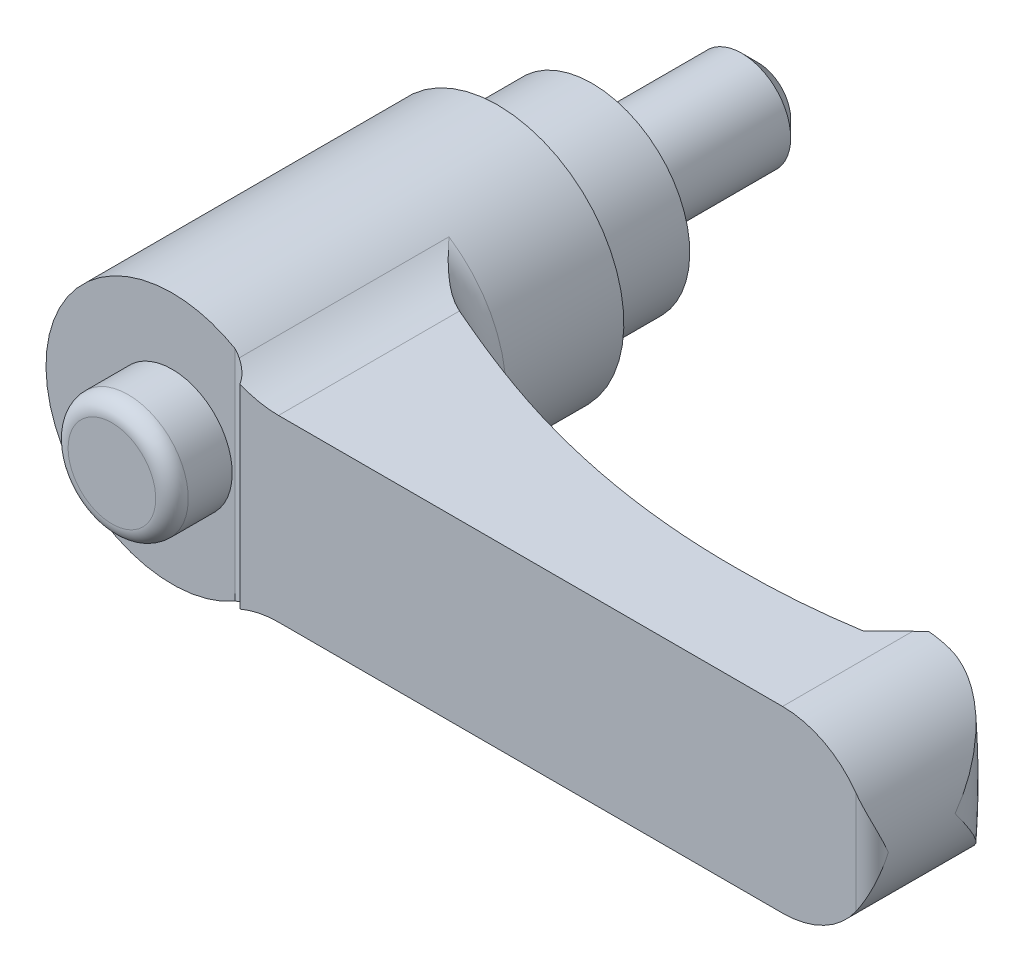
ISO-10303-21;
HEADER;
FILE_DESCRIPTION(('STEP AP214'),'2;1');
FILE_NAME('part.step','',(''),(''),'','','');
FILE_SCHEMA(('AUTOMOTIVE_DESIGN { 1 0 10303 214 1 1 1 1 }'));
ENDSEC;
DATA;
#1=APPLICATION_CONTEXT('core data for automotive mechanical design processes');
#2=APPLICATION_PROTOCOL_DEFINITION('international standard','automotive_design',2000,#1);
#3=PRODUCT_CONTEXT('',#1,'mechanical');
#4=PRODUCT('Part','Part','',(#3));
#5=PRODUCT_RELATED_PRODUCT_CATEGORY('part','',(#4));
#6=PRODUCT_DEFINITION_FORMATION('','',#4);
#7=PRODUCT_DEFINITION_CONTEXT('part definition',#1,'design');
#8=PRODUCT_DEFINITION('design','',#6,#7);
#9=PRODUCT_DEFINITION_SHAPE('','',#8);
#10=(LENGTH_UNIT() NAMED_UNIT(*) SI_UNIT(.MILLI.,.METRE.));
#11=(NAMED_UNIT(*) PLANE_ANGLE_UNIT() SI_UNIT($,.RADIAN.));
#12=(NAMED_UNIT(*) SI_UNIT($,.STERADIAN.) SOLID_ANGLE_UNIT());
#13=UNCERTAINTY_MEASURE_WITH_UNIT(LENGTH_MEASURE(1.E-05),#10,'distance_accuracy_value','');
#14=(GEOMETRIC_REPRESENTATION_CONTEXT(3) GLOBAL_UNCERTAINTY_ASSIGNED_CONTEXT((#13)) GLOBAL_UNIT_ASSIGNED_CONTEXT((#10,
#11,#12)) REPRESENTATION_CONTEXT('',''));
#15=CARTESIAN_POINT('',(0.,0.,0.));
#16=DIRECTION('',(0.,0.,1.));
#17=DIRECTION('',(1.,0.,0.));
#18=AXIS2_PLACEMENT_3D('',#15,#16,#17);
#19=CARTESIAN_POINT('',(4.8,0.,0.));
#20=DIRECTION('',(0.,0.,1.));
#21=DIRECTION('',(0.,-1.,0.));
#22=AXIS2_PLACEMENT_3D('',#19,#20,#21);
#23=PLANE('',#22);
#24=CARTESIAN_POINT('',(0.,0.,0.));
#25=DIRECTION('',(0.,0.,-1.));
#26=DIRECTION('',(0.,1.,0.));
#27=AXIS2_PLACEMENT_3D('',#24,#25,#26);
#28=CIRCLE('',#27,3.);
#29=CARTESIAN_POINT('',(0.,3.,0.));
#30=VERTEX_POINT('',#29);
#31=EDGE_CURVE('E469',#30,#30,#28,.T.);
#32=ORIENTED_EDGE('',*,*,#31,.F.);
#33=EDGE_LOOP('',(#32));
#34=FACE_BOUND('',#33,.T.);
#35=CARTESIAN_POINT('',(0.,0.,0.));
#36=DIRECTION('',(0.,0.,-1.));
#37=DIRECTION('',(0.,1.,0.));
#38=AXIS2_PLACEMENT_3D('',#35,#36,#37);
#39=CIRCLE('',#38,4.8);
#40=CARTESIAN_POINT('',(0.,4.8,0.));
#41=VERTEX_POINT('',#40);
#42=EDGE_CURVE('E417',#41,#41,#39,.T.);
#43=ORIENTED_EDGE('',*,*,#42,.T.);
#44=EDGE_LOOP('',(#43));
#45=FACE_BOUND('',#44,.T.);
#46=ADVANCED_FACE('F14',(#34,#45),#23,.F.);
#47=CARTESIAN_POINT('',(0.,0.,26.));
#48=DIRECTION('',(0.,0.,-1.));
#49=DIRECTION('',(0.,1.,0.));
#50=AXIS2_PLACEMENT_3D('',#47,#48,#49);
#51=PLANE('',#50);
#52=CARTESIAN_POINT('',(0.,0.,26.));
#53=DIRECTION('',(0.,0.,-1.));
#54=DIRECTION('',(0.,1.,0.));
#55=AXIS2_PLACEMENT_3D('',#52,#53,#54);
#56=CIRCLE('',#55,7.75);
#57=CARTESIAN_POINT('',(3.875,-6.7116968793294,26.));
#58=VERTEX_POINT('',#57);
#59=CARTESIAN_POINT('',(3.875,6.7116968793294,26.));
#60=VERTEX_POINT('',#59);
#61=EDGE_CURVE('E364',#58,#60,#56,.T.);
#62=ORIENTED_EDGE('',*,*,#61,.F.);
#63=DIRECTION('',(0.,1.,0.));
#64=VECTOR('',#63,1.);
#65=CARTESIAN_POINT('',(3.875,-11.,26.));
#66=LINE('',#65,#64);
#67=EDGE_CURVE('E451',#58,#60,#66,.T.);
#68=ORIENTED_EDGE('',*,*,#67,.T.);
#69=EDGE_LOOP('',(#62,#68));
#70=FACE_BOUND('',#69,.T.);
#71=CARTESIAN_POINT('',(0.,0.,26.));
#72=DIRECTION('',(0.,0.,-1.));
#73=DIRECTION('',(0.,1.,0.));
#74=AXIS2_PLACEMENT_3D('',#71,#72,#73);
#75=CIRCLE('',#74,3.69047619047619);
#76=CARTESIAN_POINT('',(0.,3.69047619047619,26.));
#77=VERTEX_POINT('',#76);
#78=EDGE_CURVE('E183',#77,#77,#75,.F.);
#79=ORIENTED_EDGE('',*,*,#78,.F.);
#80=EDGE_LOOP('',(#79));
#81=FACE_BOUND('',#80,.T.);
#82=ADVANCED_FACE('F158',(#70,#81),#51,.F.);
#83=CARTESIAN_POINT('',(38.5,0.,0.));
#84=DIRECTION('',(0.,0.,1.));
#85=DIRECTION('',(0.,-1.,0.));
#86=AXIS2_PLACEMENT_3D('',#83,#84,#85);
#87=CYLINDRICAL_SURFACE('',#86,5.5);
#88=CARTESIAN_POINT('',(44.,0.,21.9));
#89=CARTESIAN_POINT('',(44.0000000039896,-0.00425779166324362,21.8968685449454));
#90=CARTESIAN_POINT('',(43.9999950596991,-0.00851571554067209,21.8937369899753));
#91=CARTESIAN_POINT('',(43.9991083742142,-0.390143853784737,21.6130627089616));
#92=CARTESIAN_POINT('',(43.9593602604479,-0.76848056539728,21.3348044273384));
#93=CARTESIAN_POINT('',(43.8405607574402,-1.32856821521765,20.92503354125));
#94=CARTESIAN_POINT('',(43.7909532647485,-1.51435974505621,20.7894725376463));
#95=CARTESIAN_POINT('',(43.6715029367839,-1.88225773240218,20.5222473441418));
#96=CARTESIAN_POINT('',(43.601669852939,-2.06436592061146,20.3905813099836));
#97=CARTESIAN_POINT('',(43.4611872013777,-2.37875122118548,20.1648816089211));
#98=CARTESIAN_POINT('',(43.3950453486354,-2.51217438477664,20.0696210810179));
#99=CARTESIAN_POINT('',(43.250799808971,-2.77532702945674,19.8831417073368));
#100=CARTESIAN_POINT('',(43.1726935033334,-2.90505569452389,19.7919237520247));
#101=CARTESIAN_POINT('',(42.9202953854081,-3.28692053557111,19.5261795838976));
#102=CARTESIAN_POINT('',(42.727561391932,-3.53256609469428,19.3589622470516));
#103=CARTESIAN_POINT('',(42.3484683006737,-3.93634172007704,19.0952853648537));
#104=CARTESIAN_POINT('',(42.1735223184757,-4.10060224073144,18.9917399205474));
#105=CARTESIAN_POINT('',(41.7960798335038,-4.40966486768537,18.8081296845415));
#106=CARTESIAN_POINT('',(41.5936163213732,-4.55448986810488,18.7280371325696));
#107=CARTESIAN_POINT('',(41.2098130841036,-4.79019974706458,18.6136936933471));
#108=CARTESIAN_POINT('',(41.0333744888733,-4.88597642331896,18.5732748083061));
#109=CARTESIAN_POINT('',(40.7593164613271,-5.01555037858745,18.5310688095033));
#110=CARTESIAN_POINT('',(40.666374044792,-5.05640116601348,18.5200701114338));
#111=CARTESIAN_POINT('',(40.4779067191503,-5.13305107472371,18.5048417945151));
#112=CARTESIAN_POINT('',(40.3823830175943,-5.16885251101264,18.5006090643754));
#113=CARTESIAN_POINT('',(40.1884747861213,-5.23542428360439,18.4995076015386));
#114=CARTESIAN_POINT('',(40.090071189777,-5.26614066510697,18.5027130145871));
#115=CARTESIAN_POINT('',(39.8922874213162,-5.32184956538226,18.5171885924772));
#116=CARTESIAN_POINT('',(39.7929078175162,-5.34684523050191,18.528454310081));
#117=CARTESIAN_POINT('',(39.5942462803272,-5.39100815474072,18.5594647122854));
#118=CARTESIAN_POINT('',(39.4949643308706,-5.41017990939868,18.5792028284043));
#119=CARTESIAN_POINT('',(39.2976352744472,-5.44277299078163,18.6274002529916));
#120=CARTESIAN_POINT('',(39.1995875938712,-5.45619709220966,18.6558553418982));
#121=CARTESIAN_POINT('',(38.9984921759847,-5.47836544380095,18.7240647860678));
#122=CARTESIAN_POINT('',(38.8956289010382,-5.48667774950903,18.7645122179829));
#123=CARTESIAN_POINT('',(38.7445568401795,-5.49479244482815,18.8326405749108));
#124=CARTESIAN_POINT('',(38.6947409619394,-5.49677173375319,18.8565904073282));
#125=CARTESIAN_POINT('',(38.5963240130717,-5.49937673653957,18.9069325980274));
#126=CARTESIAN_POINT('',(38.5477229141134,-5.50000248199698,18.9333248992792));
#127=CARTESIAN_POINT('',(38.4998,-5.49999999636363,18.9609171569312));
#128=B_SPLINE_CURVE_WITH_KNOTS('',3,(#88,#89,#90,#91,#92,#93,#94,#95,#96,#97,#98,#99,#100,#101,
#102,#103,#104,#105,#106,#107,#108,#109,#110,#111,#112,#113,#114,#115,#116,#117,#118,#119,#120,
#121,#122,#123,#124,#125,#126,#127),.UNSPECIFIED.,.F.,.F.,(4,2,2,2,2,2,2,2,2,2,2,2,2,2,2,2,2,2,
2,4),(0.,0.0158565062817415,1.4211419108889,2.12636053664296,2.83123971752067,3.36110592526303,
3.89108827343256,4.94782257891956,5.7293360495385,6.50992069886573,7.12169061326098,
7.42772009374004,7.73360880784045,8.04255979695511,8.35134045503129,8.65988215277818,
8.96827473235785,9.30004722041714,9.46590364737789,9.63175620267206),.UNSPECIFIED.);
#129=CARTESIAN_POINT('',(40.2644155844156,-5.20930299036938,18.5));
#130=VERTEX_POINT('',#129);
#131=CARTESIAN_POINT('',(44.,0.,21.9));
#132=VERTEX_POINT('',#131);
#133=EDGE_CURVE('E126',#130,#132,#128,.F.);
#134=ORIENTED_EDGE('',*,*,#133,.T.);
#135=CARTESIAN_POINT('',(44.,0.,21.9));
#136=CARTESIAN_POINT('',(44.0000000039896,0.00425779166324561,21.8968685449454));
#137=CARTESIAN_POINT('',(43.9999950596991,0.00851571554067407,21.8937369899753));
#138=CARTESIAN_POINT('',(43.9991083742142,0.390143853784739,21.6130627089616));
#139=CARTESIAN_POINT('',(43.9593602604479,0.768480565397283,21.3348044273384));
#140=CARTESIAN_POINT('',(43.8405607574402,1.32856821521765,20.92503354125));
#141=CARTESIAN_POINT('',(43.7909532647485,1.51435974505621,20.7894725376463));
#142=CARTESIAN_POINT('',(43.6715029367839,1.88225773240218,20.5222473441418));
#143=CARTESIAN_POINT('',(43.601669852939,2.06436592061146,20.3905813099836));
#144=CARTESIAN_POINT('',(43.4611872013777,2.37875122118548,20.1648816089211));
#145=CARTESIAN_POINT('',(43.3950453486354,2.51217438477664,20.0696210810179));
#146=CARTESIAN_POINT('',(43.250799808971,2.77532702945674,19.8831417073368));
#147=CARTESIAN_POINT('',(43.1726935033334,2.9050556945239,19.7919237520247));
#148=CARTESIAN_POINT('',(42.9202953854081,3.28692053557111,19.5261795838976));
#149=CARTESIAN_POINT('',(42.727561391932,3.53256609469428,19.3589622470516));
#150=CARTESIAN_POINT('',(42.3484683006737,3.93634172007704,19.0952853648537));
#151=CARTESIAN_POINT('',(42.1735223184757,4.10060224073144,18.9917399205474));
#152=CARTESIAN_POINT('',(41.7960798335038,4.40966486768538,18.8081296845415));
#153=CARTESIAN_POINT('',(41.5936163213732,4.55448986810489,18.7280371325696));
#154=CARTESIAN_POINT('',(41.2098130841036,4.79019974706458,18.6136936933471));
#155=CARTESIAN_POINT('',(41.0333744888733,4.88597642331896,18.5732748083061));
#156=CARTESIAN_POINT('',(40.7593164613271,5.01555037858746,18.5310688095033));
#157=CARTESIAN_POINT('',(40.666374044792,5.05640116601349,18.5200701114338));
#158=CARTESIAN_POINT('',(40.4779067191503,5.13305107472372,18.5048417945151));
#159=CARTESIAN_POINT('',(40.3823830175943,5.16885251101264,18.5006090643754));
#160=CARTESIAN_POINT('',(40.1884747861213,5.23542428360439,18.4995076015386));
#161=CARTESIAN_POINT('',(40.090071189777,5.26614066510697,18.5027130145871));
#162=CARTESIAN_POINT('',(39.8922874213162,5.32184956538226,18.5171885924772));
#163=CARTESIAN_POINT('',(39.7929078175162,5.34684523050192,18.528454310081));
#164=CARTESIAN_POINT('',(39.5942462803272,5.39100815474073,18.5594647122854));
#165=CARTESIAN_POINT('',(39.4949643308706,5.41017990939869,18.5792028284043));
#166=CARTESIAN_POINT('',(39.2976352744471,5.44277299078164,18.6274002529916));
#167=CARTESIAN_POINT('',(39.1995875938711,5.45619709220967,18.6558553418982));
#168=CARTESIAN_POINT('',(38.9984921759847,5.47836544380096,18.7240647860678));
#169=CARTESIAN_POINT('',(38.8956289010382,5.48667774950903,18.7645122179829));
#170=CARTESIAN_POINT('',(38.7445568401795,5.49479244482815,18.8326405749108));
#171=CARTESIAN_POINT('',(38.6947409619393,5.4967717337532,18.8565904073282));
#172=CARTESIAN_POINT('',(38.5963240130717,5.49937673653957,18.9069325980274));
#173=CARTESIAN_POINT('',(38.5477229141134,5.50000248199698,18.9333248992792));
#174=CARTESIAN_POINT('',(38.4998,5.49999999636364,18.9609171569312));
#175=B_SPLINE_CURVE_WITH_KNOTS('',3,(#135,#136,#137,#138,#139,#140,#141,#142,#143,#144,#145,
#146,#147,#148,#149,#150,#151,#152,#153,#154,#155,#156,#157,#158,#159,#160,#161,#162,#163,#164,
#165,#166,#167,#168,#169,#170,#171,#172,#173,#174),.UNSPECIFIED.,.F.,.F.,(4,2,2,2,2,2,2,2,2,2,2,
2,2,2,2,2,2,2,2,4),(0.,0.0158565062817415,1.4211419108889,2.12636053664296,2.83123971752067,
3.36110592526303,3.89108827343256,4.94782257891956,5.72933604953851,6.50992069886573,
7.12169061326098,7.42772009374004,7.73360880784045,8.04255979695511,8.35134045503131,
8.6598821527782,8.9682747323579,9.30004722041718,9.46590364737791,9.63175620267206),.UNSPECIFIED.);
#176=CARTESIAN_POINT('',(40.2644155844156,5.20930299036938,18.5));
#177=VERTEX_POINT('',#176);
#178=EDGE_CURVE('E123',#132,#177,#175,.T.);
#179=ORIENTED_EDGE('',*,*,#178,.T.);
#180=CARTESIAN_POINT('',(38.5,0.,18.5));
#181=DIRECTION('',(0.,0.,-1.));
#182=DIRECTION('',(0.,1.,0.));
#183=AXIS2_PLACEMENT_3D('',#180,#181,#182);
#184=CIRCLE('',#183,5.5);
#185=CARTESIAN_POINT('',(39.,5.47722557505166,18.5));
#186=VERTEX_POINT('',#185);
#187=EDGE_CURVE('E457',#177,#186,#184,.F.);
#188=ORIENTED_EDGE('',*,*,#187,.T.);
#189=CARTESIAN_POINT('',(38.5,0.,19.));
#190=DIRECTION('',(-0.707106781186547,0.,-0.707106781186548));
#191=DIRECTION('',(-0.707106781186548,0.,0.707106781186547));
#192=AXIS2_PLACEMENT_3D('',#189,#190,#191);
#193=ELLIPSE('',#192,7.77817459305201,5.5);
#194=CARTESIAN_POINT('',(38.5,5.5,19.));
#195=VERTEX_POINT('',#194);
#196=EDGE_CURVE('E390',#186,#195,#193,.F.);
#197=ORIENTED_EDGE('',*,*,#196,.T.);
#198=DIRECTION('',(0.,0.,1.));
#199=VECTOR('',#198,1.);
#200=CARTESIAN_POINT('',(38.5,5.5,0.));
#201=LINE('',#200,#199);
#202=CARTESIAN_POINT('',(38.5,5.5,27.));
#203=VERTEX_POINT('',#202);
#204=EDGE_CURVE('E389',#195,#203,#201,.T.);
#205=ORIENTED_EDGE('',*,*,#204,.T.);
#206=CARTESIAN_POINT('',(38.5,0.,27.));
#207=DIRECTION('',(0.,0.,1.));
#208=DIRECTION('',(0.,-1.,0.));
#209=AXIS2_PLACEMENT_3D('',#206,#207,#208);
#210=CIRCLE('',#209,5.5);
#211=CARTESIAN_POINT('',(43.,3.16227766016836,27.));
#212=VERTEX_POINT('',#211);
#213=EDGE_CURVE('E367',#212,#203,#210,.T.);
#214=ORIENTED_EDGE('',*,*,#213,.F.);
#215=CARTESIAN_POINT('',(43.,3.16227766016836,27.));
#216=CARTESIAN_POINT('',(43.0489698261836,3.09261080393,26.9999556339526));
#217=CARTESIAN_POINT('',(43.0962528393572,3.0218687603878,26.9964077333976));
#218=CARTESIAN_POINT('',(43.1871872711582,2.87878712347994,26.9834058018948));
#219=CARTESIAN_POINT('',(43.2308453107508,2.80645076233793,26.9739628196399));
#220=CARTESIAN_POINT('',(43.3141980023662,2.66092047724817,26.9503365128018));
#221=CARTESIAN_POINT('',(43.3539154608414,2.58773460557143,26.9361828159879));
#222=CARTESIAN_POINT('',(43.4296865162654,2.44030003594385,26.903917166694));
#223=CARTESIAN_POINT('',(43.4657377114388,2.36605067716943,26.8858026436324));
#224=CARTESIAN_POINT('',(43.5573559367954,2.16613298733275,26.8329178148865));
#225=CARTESIAN_POINT('',(43.6095944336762,2.03971389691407,26.7951786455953));
#226=CARTESIAN_POINT('',(43.703955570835,1.78529411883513,26.7129945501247));
#227=CARTESIAN_POINT('',(43.7460735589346,1.65729273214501,26.6685465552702));
#228=CARTESIAN_POINT('',(43.8205857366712,1.39978291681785,26.5746664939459));
#229=CARTESIAN_POINT('',(43.852946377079,1.27027084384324,26.5252179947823));
#230=CARTESIAN_POINT('',(43.9079882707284,1.01058108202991,26.4229956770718));
#231=CARTESIAN_POINT('',(43.9306732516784,0.880403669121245,26.3702231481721));
#232=CARTESIAN_POINT('',(43.9654953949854,0.627432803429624,26.2658240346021));
#233=CARTESIAN_POINT('',(43.9781829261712,0.504664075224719,26.2143181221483));
#234=CARTESIAN_POINT('',(43.9952673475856,0.259135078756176,26.1104803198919));
#235=CARTESIAN_POINT('',(43.9996786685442,0.136375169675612,26.0581500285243));
#236=CARTESIAN_POINT('',(43.9999943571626,0.00909584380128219,26.0038784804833));
#237=CARTESIAN_POINT('',(43.9999999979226,0.00454789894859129,26.0019392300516));
#238=CARTESIAN_POINT('',(44.,0.,26.));
#239=B_SPLINE_CURVE_WITH_KNOTS('',3,(#215,#216,#217,#218,#219,#220,#221,#222,#223,#224,#225,
#226,#227,#228,#229,#230,#231,#232,#233,#234,#235,#236,#237,#238),.UNSPECIFIED.,.F.,.F.,(4,2,2,
2,2,2,2,2,2,2,2,4),(0.,0.255244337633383,0.510011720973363,0.763206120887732,1.01656533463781,
1.44159949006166,1.8668286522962,2.2935036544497,2.72001412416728,3.12097942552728,
3.52124493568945,3.53607734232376),.UNSPECIFIED.);
#240=CARTESIAN_POINT('',(44.,0.,26.));
#241=VERTEX_POINT('',#240);
#242=EDGE_CURVE('E169',#241,#212,#239,.F.);
#243=ORIENTED_EDGE('',*,*,#242,.F.);
#244=CARTESIAN_POINT('',(43.,-3.16227766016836,27.));
#245=CARTESIAN_POINT('',(43.0489698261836,-3.09261080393,26.9999556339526));
#246=CARTESIAN_POINT('',(43.0962528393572,-3.0218687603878,26.9964077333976));
#247=CARTESIAN_POINT('',(43.1871872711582,-2.87878712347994,26.9834058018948));
#248=CARTESIAN_POINT('',(43.2308453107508,-2.80645076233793,26.9739628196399));
#249=CARTESIAN_POINT('',(43.3141980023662,-2.66092047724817,26.9503365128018));
#250=CARTESIAN_POINT('',(43.3539154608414,-2.58773460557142,26.9361828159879));
#251=CARTESIAN_POINT('',(43.4296865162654,-2.44030003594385,26.903917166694));
#252=CARTESIAN_POINT('',(43.4657377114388,-2.36605067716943,26.8858026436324));
#253=CARTESIAN_POINT('',(43.5573559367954,-2.16613298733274,26.8329178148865));
#254=CARTESIAN_POINT('',(43.6095944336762,-2.03971389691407,26.7951786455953));
#255=CARTESIAN_POINT('',(43.703955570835,-1.78529411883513,26.7129945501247));
#256=CARTESIAN_POINT('',(43.7460735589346,-1.65729273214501,26.6685465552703));
#257=CARTESIAN_POINT('',(43.8205857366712,-1.39978291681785,26.5746664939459));
#258=CARTESIAN_POINT('',(43.852946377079,-1.27027084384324,26.5252179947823));
#259=CARTESIAN_POINT('',(43.9079882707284,-1.01058108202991,26.4229956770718));
#260=CARTESIAN_POINT('',(43.9306732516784,-0.880403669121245,26.3702231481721));
#261=CARTESIAN_POINT('',(43.9654953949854,-0.627432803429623,26.2658240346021));
#262=CARTESIAN_POINT('',(43.9781829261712,-0.504664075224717,26.2143181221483));
#263=CARTESIAN_POINT('',(43.9952673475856,-0.259135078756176,26.1104803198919));
#264=CARTESIAN_POINT('',(43.9996786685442,-0.136375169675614,26.0581500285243));
#265=CARTESIAN_POINT('',(43.9999943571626,-0.00909584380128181,26.0038784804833));
#266=CARTESIAN_POINT('',(43.9999999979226,-0.00454789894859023,26.0019392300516));
#267=CARTESIAN_POINT('',(44.,0.,26.));
#268=B_SPLINE_CURVE_WITH_KNOTS('',3,(#244,#245,#246,#247,#248,#249,#250,#251,#252,#253,#254,
#255,#256,#257,#258,#259,#260,#261,#262,#263,#264,#265,#266,#267),.UNSPECIFIED.,.F.,.F.,(4,2,2,
2,2,2,2,2,2,2,2,4),(0.,0.255244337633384,0.510011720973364,0.763206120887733,1.01656533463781,
1.44159949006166,1.8668286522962,2.2935036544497,2.72001412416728,3.12097942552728,
3.52124493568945,3.53607734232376),.UNSPECIFIED.);
#269=CARTESIAN_POINT('',(43.,-3.16227766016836,27.));
#270=VERTEX_POINT('',#269);
#271=EDGE_CURVE('E177',#270,#241,#268,.T.);
#272=ORIENTED_EDGE('',*,*,#271,.F.);
#273=CARTESIAN_POINT('',(38.5,-5.5,27.));
#274=VERTEX_POINT('',#273);
#275=EDGE_CURVE('E373',#274,#270,#210,.T.);
#276=ORIENTED_EDGE('',*,*,#275,.F.);
#277=DIRECTION('',(0.,0.,1.));
#278=VECTOR('',#277,1.);
#279=CARTESIAN_POINT('',(38.5,-5.5,0.));
#280=LINE('',#279,#278);
#281=CARTESIAN_POINT('',(38.5,-5.5,19.));
#282=VERTEX_POINT('',#281);
#283=EDGE_CURVE('E393',#282,#274,#280,.T.);
#284=ORIENTED_EDGE('',*,*,#283,.F.);
#285=CARTESIAN_POINT('',(39.,-5.47722557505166,18.5));
#286=VERTEX_POINT('',#285);
#287=EDGE_CURVE('E440',#282,#286,#193,.F.);
#288=ORIENTED_EDGE('',*,*,#287,.T.);
#289=EDGE_CURVE('E134',#286,#130,#184,.F.);
#290=ORIENTED_EDGE('',*,*,#289,.T.);
#291=EDGE_LOOP('',(#134,#179,#188,#197,#205,#214,#243,#272,#276,#284,#288,#290));
#292=FACE_BOUND('',#291,.T.);
#293=ADVANCED_FACE('F132',(#292),#87,.T.);
#294=CARTESIAN_POINT('',(40.6,-11.,18.5));
#295=DIRECTION('',(0.,0.,-1.));
#296=DIRECTION('',(0.,1.,0.));
#297=AXIS2_PLACEMENT_3D('',#294,#295,#296);
#298=PLANE('',#297);
#299=ORIENTED_EDGE('',*,*,#187,.F.);
#300=CARTESIAN_POINT('',(0.,0.,18.5));
#301=DIRECTION('',(0.,0.,-1.));
#302=DIRECTION('',(0.,1.,0.));
#303=AXIS2_PLACEMENT_3D('',#300,#301,#302);
#304=CIRCLE('',#303,40.6);
#305=EDGE_CURVE('E37',#177,#130,#304,.T.);
#306=ORIENTED_EDGE('',*,*,#305,.T.);
#307=ORIENTED_EDGE('',*,*,#289,.F.);
#308=DIRECTION('',(0.,1.,0.));
#309=VECTOR('',#308,1.);
#310=CARTESIAN_POINT('',(39.,-11.,18.5));
#311=LINE('',#310,#309);
#312=EDGE_CURVE('E448',#286,#186,#311,.T.);
#313=ORIENTED_EDGE('',*,*,#312,.T.);
#314=EDGE_LOOP('',(#299,#306,#307,#313));
#315=FACE_BOUND('',#314,.T.);
#316=ADVANCED_FACE('F157',(#315),#298,.T.);
#317=CARTESIAN_POINT('',(0.,0.,27.));
#318=DIRECTION('',(0.,0.,1.));
#319=DIRECTION('',(0.,-1.,0.));
#320=AXIS2_PLACEMENT_3D('',#317,#318,#319);
#321=PLANE('',#320);
#322=CARTESIAN_POINT('',(7.53740671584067,11.5,27.));
#323=DIRECTION('',(0.,0.,1.));
#324=DIRECTION('',(1.,0.,0.));
#325=AXIS2_PLACEMENT_3D('',#322,#323,#324);
#326=CIRCLE('',#325,6.);
#327=CARTESIAN_POINT('',(5.16666666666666,5.988231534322,27.));
#328=VERTEX_POINT('',#327);
#329=CARTESIAN_POINT('',(7.53740671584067,5.5,27.));
#330=VERTEX_POINT('',#329);
#331=EDGE_CURVE('E398',#328,#330,#326,.T.);
#332=ORIENTED_EDGE('',*,*,#331,.F.);
#333=DIRECTION('',(0.,1.,0.));
#334=VECTOR('',#333,1.);
#335=CARTESIAN_POINT('',(5.16666666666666,-11.,27.));
#336=LINE('',#335,#334);
#337=CARTESIAN_POINT('',(5.16666666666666,-5.988231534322,27.));
#338=VERTEX_POINT('',#337);
#339=EDGE_CURVE('E436',#338,#328,#336,.T.);
#340=ORIENTED_EDGE('',*,*,#339,.F.);
#341=CARTESIAN_POINT('',(7.53740671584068,-11.5,27.));
#342=DIRECTION('',(0.,0.,1.));
#343=DIRECTION('',(1.,0.,0.));
#344=AXIS2_PLACEMENT_3D('',#341,#342,#343);
#345=CIRCLE('',#344,6.);
#346=CARTESIAN_POINT('',(7.53740671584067,-5.5,27.));
#347=VERTEX_POINT('',#346);
#348=EDGE_CURVE('E401',#347,#338,#345,.T.);
#349=ORIENTED_EDGE('',*,*,#348,.F.);
#350=DIRECTION('',(-1.,0.,0.));
#351=VECTOR('',#350,1.);
#352=CARTESIAN_POINT('',(38.5,-5.5,27.));
#353=LINE('',#352,#351);
#354=EDGE_CURVE('E397',#274,#347,#353,.T.);
#355=ORIENTED_EDGE('',*,*,#354,.F.);
#356=ORIENTED_EDGE('',*,*,#275,.T.);
#357=DIRECTION('',(0.,1.,0.));
#358=VECTOR('',#357,1.);
#359=CARTESIAN_POINT('',(43.,-11.,27.));
#360=LINE('',#359,#358);
#361=EDGE_CURVE('E385',#270,#212,#360,.T.);
#362=ORIENTED_EDGE('',*,*,#361,.T.);
#363=ORIENTED_EDGE('',*,*,#213,.T.);
#364=DIRECTION('',(1.,0.,0.));
#365=VECTOR('',#364,1.);
#366=CARTESIAN_POINT('',(7.53740671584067,5.5,27.));
#367=LINE('',#366,#365);
#368=EDGE_CURVE('E384',#330,#203,#367,.T.);
#369=ORIENTED_EDGE('',*,*,#368,.F.);
#370=EDGE_LOOP('',(#332,#340,#349,#355,#356,#362,#363,#369));
#371=FACE_BOUND('',#370,.T.);
#372=ADVANCED_FACE('F240',(#371),#321,.T.);
#373=CARTESIAN_POINT('',(0.,0.,0.));
#374=DIRECTION('',(0.,0.,-1.));
#375=DIRECTION('',(0.,1.,0.));
#376=AXIS2_PLACEMENT_3D('',#373,#374,#375);
#377=CYLINDRICAL_SURFACE('',#376,7.75);
#378=CARTESIAN_POINT('',(0.,0.,13.2417430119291));
#379=DIRECTION('',(0.,0.,-1.));
#380=DIRECTION('',(0.,1.,0.));
#381=AXIS2_PLACEMENT_3D('',#378,#379,#380);
#382=CIRCLE('',#381,7.75);
#383=CARTESIAN_POINT('',(4.24835651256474,6.48181818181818,13.2417430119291));
#384=VERTEX_POINT('',#383);
#385=CARTESIAN_POINT('',(4.24835651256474,-6.48181818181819,13.2417430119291));
#386=VERTEX_POINT('',#385);
#387=EDGE_CURVE('E359',#384,#386,#382,.T.);
#388=ORIENTED_EDGE('',*,*,#387,.T.);
#389=DIRECTION('',(0.,0.,1.));
#390=VECTOR('',#389,1.);
#391=CARTESIAN_POINT('',(4.24835651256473,-6.48181818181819,0.));
#392=LINE('',#391,#390);
#393=CARTESIAN_POINT('',(4.24835651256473,-6.48181818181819,26.1308937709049));
#394=VERTEX_POINT('',#393);
#395=EDGE_CURVE('E409',#386,#394,#392,.T.);
#396=ORIENTED_EDGE('',*,*,#395,.T.);
#397=CARTESIAN_POINT('',(3.875,-6.7116968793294,26.));
#398=CARTESIAN_POINT('',(3.9487248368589,-6.66914880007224,26.0179048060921));
#399=CARTESIAN_POINT('',(4.02097408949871,-6.62579988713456,26.039874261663));
#400=CARTESIAN_POINT('',(4.16199829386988,-6.53812669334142,26.0915573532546));
#401=CARTESIAN_POINT('',(4.23077434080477,-6.49380272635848,26.1212685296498));
#402=CARTESIAN_POINT('',(4.36202505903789,-6.40634475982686,26.1868862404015));
#403=CARTESIAN_POINT('',(4.42463632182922,-6.36322379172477,26.2225378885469));
#404=CARTESIAN_POINT('',(4.54579687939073,-6.27724013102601,26.3004737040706));
#405=CARTESIAN_POINT('',(4.60434578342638,-6.23437746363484,26.3427585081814));
#406=CARTESIAN_POINT('',(4.71026264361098,-6.1546555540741,26.4283893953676));
#407=CARTESIAN_POINT('',(4.75813291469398,-6.11768751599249,26.4710140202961));
#408=CARTESIAN_POINT('',(4.8500303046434,-6.04509175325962,26.56120031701));
#409=CARTESIAN_POINT('',(4.89405965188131,-6.00946325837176,26.6087590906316));
#410=CARTESIAN_POINT('',(4.97925799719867,-5.9390764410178,26.7103994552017));
#411=CARTESIAN_POINT('',(5.02029084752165,-5.90438218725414,26.7646407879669));
#412=CARTESIAN_POINT('',(5.09738332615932,-5.83796295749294,26.8783962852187));
#413=CARTESIAN_POINT('',(5.13343386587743,-5.80624344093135,26.9379197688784));
#414=CARTESIAN_POINT('',(5.16666666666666,-5.77650894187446,27.));
#415=B_SPLINE_CURVE_WITH_KNOTS('',3,(#397,#398,#399,#400,#401,#402,#403,#404,#405,#406,#407,
#408,#409,#410,#411,#412,#413,#414),.UNSPECIFIED.,.F.,.F.,(4,2,2,2,2,2,2,2,4),(0.,
0.26081186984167,0.521540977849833,0.773092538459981,1.02466826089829,1.24638864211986,
1.4679795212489,1.6966429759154,1.92571819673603),.UNSPECIFIED.);
#416=EDGE_CURVE('E214',#58,#394,#415,.T.);
#417=ORIENTED_EDGE('',*,*,#416,.F.);
#418=ORIENTED_EDGE('',*,*,#61,.T.);
#419=CARTESIAN_POINT('',(5.16666666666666,5.77650894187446,27.));
#420=CARTESIAN_POINT('',(5.13714077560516,5.80292379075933,26.9448365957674));
#421=CARTESIAN_POINT('',(5.1053831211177,5.83091583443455,26.8916890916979));
#422=CARTESIAN_POINT('',(5.03785941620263,5.88934998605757,26.7895453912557));
#423=CARTESIAN_POINT('',(5.00209830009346,5.91978906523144,26.7405442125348));
#424=CARTESIAN_POINT('',(4.92700880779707,5.98243056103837,26.646752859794));
#425=CARTESIAN_POINT('',(4.88768622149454,6.01463008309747,26.6019560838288));
#426=CARTESIAN_POINT('',(4.80573825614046,6.08030777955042,26.5165060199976));
#427=CARTESIAN_POINT('',(4.76311181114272,6.11378636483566,26.4758540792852));
#428=CARTESIAN_POINT('',(4.63114473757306,6.21507952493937,26.3605779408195));
#429=CARTESIAN_POINT('',(4.53728284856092,6.28411879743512,26.2920994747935));
#430=CARTESIAN_POINT('',(4.3393749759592,6.42237347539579,26.1724069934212));
#431=CARTESIAN_POINT('',(4.23533663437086,6.49158871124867,26.1211801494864));
#432=CARTESIAN_POINT('',(4.08621326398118,6.5854168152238,26.0632790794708));
#433=CARTESIAN_POINT('',(4.04469277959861,6.61100425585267,26.0487072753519));
#434=CARTESIAN_POINT('',(3.96061680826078,6.66171281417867,26.0222973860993));
#435=CARTESIAN_POINT('',(3.91806319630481,6.68683464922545,26.0104547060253));
#436=CARTESIAN_POINT('',(3.8750000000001,6.7116968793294,26.));
#437=B_SPLINE_CURVE_WITH_KNOTS('',3,(#419,#420,#421,#422,#423,#424,#425,#426,#427,#428,#429,
#430,#431,#432,#433,#434,#435,#436),.UNSPECIFIED.,.F.,.F.,(4,2,2,2,2,2,2,2,4),(0.,
0.203583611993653,0.406919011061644,0.609929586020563,0.81300593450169,1.21684507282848,
1.62038324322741,1.77301957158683,1.92539700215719),.UNSPECIFIED.);
#438=CARTESIAN_POINT('',(4.24835651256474,6.48181818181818,26.1308937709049));
#439=VERTEX_POINT('',#438);
#440=EDGE_CURVE('E228',#439,#60,#437,.T.);
#441=ORIENTED_EDGE('',*,*,#440,.F.);
#442=DIRECTION('',(0.,0.,1.));
#443=VECTOR('',#442,1.);
#444=CARTESIAN_POINT('',(4.24835651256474,6.48181818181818,0.));
#445=LINE('',#444,#443);
#446=EDGE_CURVE('E415',#384,#439,#445,.T.);
#447=ORIENTED_EDGE('',*,*,#446,.F.);
#448=EDGE_LOOP('',(#388,#396,#417,#418,#441,#447));
#449=FACE_BOUND('',#448,.T.);
#450=CARTESIAN_POINT('',(0.,0.,6.));
#451=DIRECTION('',(0.,0.,-1.));
#452=DIRECTION('',(0.,1.,0.));
#453=AXIS2_PLACEMENT_3D('',#450,#451,#452);
#454=CIRCLE('',#453,7.75);
#455=CARTESIAN_POINT('',(0.,7.75,6.));
#456=VERTEX_POINT('',#455);
#457=EDGE_CURVE('E362',#456,#456,#454,.T.);
#458=ORIENTED_EDGE('',*,*,#457,.F.);
#459=EDGE_LOOP('',(#458));
#460=FACE_BOUND('',#459,.T.);
#461=ADVANCED_FACE('F238',(#449,#460),#377,.T.);
#462=CARTESIAN_POINT('',(7.53740671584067,11.5,0.));
#463=DIRECTION('',(0.,0.,1.));
#464=DIRECTION('',(0.,-1.,0.));
#465=AXIS2_PLACEMENT_3D('',#462,#463,#464);
#466=CYLINDRICAL_SURFACE('',#465,6.);
#467=DIRECTION('',(0.,0.,1.));
#468=VECTOR('',#467,1.);
#469=CARTESIAN_POINT('',(7.53740671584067,5.5,0.));
#470=LINE('',#469,#468);
#471=CARTESIAN_POINT('',(7.53740671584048,5.5,15.8847846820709));
#472=VERTEX_POINT('',#471);
#473=EDGE_CURVE('E392',#472,#330,#470,.T.);
#474=ORIENTED_EDGE('',*,*,#473,.F.);
#475=CARTESIAN_POINT('',(7.53760671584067,5.50000000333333,15.8848714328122));
#476=CARTESIAN_POINT('',(7.42056429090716,5.50000237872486,15.8340928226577));
#477=CARTESIAN_POINT('',(7.30547455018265,5.50341530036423,15.7791506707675));
#478=CARTESIAN_POINT('',(7.07949807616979,5.51642945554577,15.6622782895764));
#479=CARTESIAN_POINT('',(6.96860436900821,5.52601989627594,15.6003604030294));
#480=CARTESIAN_POINT('',(6.64350339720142,5.56296716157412,15.4067136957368));
#481=CARTESIAN_POINT('',(6.43532620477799,5.59851698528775,15.2663869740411));
#482=CARTESIAN_POINT('',(6.04665859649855,5.68493972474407,14.9793319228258));
#483=CARTESIAN_POINT('',(5.86525717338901,5.73477067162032,14.8334864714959));
#484=CARTESIAN_POINT('',(5.51460300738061,5.84825422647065,14.5326629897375));
#485=CARTESIAN_POINT('',(5.34535978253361,5.91191750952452,14.3776779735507));
#486=CARTESIAN_POINT('',(5.01722866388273,6.05200819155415,14.0618166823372));
#487=CARTESIAN_POINT('',(4.85836829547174,6.12846774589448,13.9009263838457));
#488=CARTESIAN_POINT('',(4.55010273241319,6.29360411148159,13.5765860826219));
#489=CARTESIAN_POINT('',(4.40069155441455,6.3822730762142,13.4131377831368));
#490=CARTESIAN_POINT('',(4.25307835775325,6.47872574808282,13.2470592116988));
#491=CARTESIAN_POINT('',(4.25071688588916,6.48027113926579,13.2444011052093));
#492=CARTESIAN_POINT('',(4.24835651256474,6.48181818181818,13.2417430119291));
#493=B_SPLINE_CURVE_WITH_KNOTS('',3,(#475,#476,#477,#478,#479,#480,#481,#482,#483,#484,#485,
#486,#487,#488,#489,#490,#491,#492),.UNSPECIFIED.,.F.,.F.,(4,2,2,2,2,2,2,2,4),(0.,
0.382411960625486,0.764157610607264,1.52259154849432,2.23572847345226,2.9494177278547,
3.66492808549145,4.37998074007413,4.39161142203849),.UNSPECIFIED.);
#494=EDGE_CURVE('E244',#472,#384,#493,.T.);
#495=ORIENTED_EDGE('',*,*,#494,.T.);
#496=ORIENTED_EDGE('',*,*,#446,.T.);
#497=CARTESIAN_POINT('',(5.16666666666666,5.988231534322,27.));
#498=CARTESIAN_POINT('',(5.14070328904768,5.99939986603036,26.9514536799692));
#499=CARTESIAN_POINT('',(5.11281907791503,6.01160988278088,26.9041807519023));
#500=CARTESIAN_POINT('',(5.05359296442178,6.03815743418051,26.8125079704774));
#501=CARTESIAN_POINT('',(5.02225228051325,6.05249421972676,26.7681071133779));
#502=CARTESIAN_POINT('',(4.957388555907,6.08292031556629,26.6836551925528));
#503=CARTESIAN_POINT('',(4.92394991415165,6.09895014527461,26.6435177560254));
#504=CARTESIAN_POINT('',(4.85453383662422,6.13309313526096,26.5664566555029));
#505=CARTESIAN_POINT('',(4.81855640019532,6.151206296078,26.5295329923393));
#506=CARTESIAN_POINT('',(4.74141898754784,6.19109353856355,26.4561742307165));
#507=CARTESIAN_POINT('',(4.70007605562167,6.21304611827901,26.4200283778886));
#508=CARTESIAN_POINT('',(4.61540587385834,6.25936628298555,26.3518346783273));
#509=CARTESIAN_POINT('',(4.57207832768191,6.28373422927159,26.31978744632));
#510=CARTESIAN_POINT('',(4.48259160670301,6.33561673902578,26.2589246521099));
#511=CARTESIAN_POINT('',(4.43638627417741,6.36320560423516,26.2302406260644));
#512=CARTESIAN_POINT('',(4.34298641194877,6.4207567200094,26.1772795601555));
#513=CARTESIAN_POINT('',(4.29579253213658,6.45071744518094,26.152999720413));
#514=CARTESIAN_POINT('',(4.24835651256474,6.48181818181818,26.1308937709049));
#515=B_SPLINE_CURVE_WITH_KNOTS('',3,(#497,#498,#499,#500,#501,#502,#503,#504,#505,#506,#507,
#508,#509,#510,#511,#512,#513,#514),.UNSPECIFIED.,.F.,.F.,(4,2,2,2,2,2,2,2,4),(0.,
0.168459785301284,0.336860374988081,0.500600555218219,0.664340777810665,0.841530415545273,
1.0187465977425,1.20147538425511,1.38408759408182),.UNSPECIFIED.);
#516=EDGE_CURVE('E222',#328,#439,#515,.T.);
#517=ORIENTED_EDGE('',*,*,#516,.F.);
#518=ORIENTED_EDGE('',*,*,#331,.T.);
#519=EDGE_LOOP('',(#474,#495,#496,#517,#518));
#520=FACE_BOUND('',#519,.T.);
#521=ADVANCED_FACE('F234',(#520),#466,.F.);
#522=CARTESIAN_POINT('',(7.53740671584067,5.5,0.));
#523=DIRECTION('',(0.,-1.,0.));
#524=DIRECTION('',(1.,0.,0.));
#525=AXIS2_PLACEMENT_3D('',#522,#523,#524);
#526=PLANE('',#525);
#527=CARTESIAN_POINT('',(30.0268503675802,5.5,-22.9439315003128));
#528=DIRECTION('',(0.,-1.,0.));
#529=DIRECTION('',(1.,0.,0.));
#530=AXIS2_PLACEMENT_3D('',#527,#528,#529);
#531=CIRCLE('',#530,44.);
#532=CARTESIAN_POINT('',(29.7749924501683,5.5,21.0553476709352));
#533=VERTEX_POINT('',#532);
#534=CARTESIAN_POINT('',(37.,5.5,20.5));
#535=VERTEX_POINT('',#534);
#536=EDGE_CURVE('E438',#533,#535,#531,.F.);
#537=ORIENTED_EDGE('',*,*,#536,.F.);
#538=CARTESIAN_POINT('',(21.9436856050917,5.5,20.4285815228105));
#539=CARTESIAN_POINT('',(21.2029115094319,5.5,20.3059110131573));
#540=CARTESIAN_POINT('',(20.4649826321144,5.5,20.1656901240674));
#541=CARTESIAN_POINT('',(18.9963617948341,5.5,19.8513505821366));
#542=CARTESIAN_POINT('',(18.2656705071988,5.5,19.6772288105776));
#543=CARTESIAN_POINT('',(16.8128961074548,5.5,19.2967691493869));
#544=CARTESIAN_POINT('',(16.090811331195,5.5,19.0904376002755));
#545=CARTESIAN_POINT('',(14.6559685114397,5.5,18.6477967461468));
#546=CARTESIAN_POINT('',(13.9432097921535,5.5,18.4114896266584));
#547=CARTESIAN_POINT('',(12.8749404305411,5.5,18.0348625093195));
#548=CARTESIAN_POINT('',(12.5159102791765,5.5,17.9044045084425));
#549=CARTESIAN_POINT('',(11.8001944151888,5.5,17.6372082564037));
#550=CARTESIAN_POINT('',(11.4435086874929,5.5,17.5004700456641));
#551=CARTESIAN_POINT('',(10.732274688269,5.5,17.2214557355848));
#552=CARTESIAN_POINT('',(10.3777266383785,5.5,17.0791790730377));
#553=CARTESIAN_POINT('',(9.67049294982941,5.5,16.7900916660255));
#554=CARTESIAN_POINT('',(9.31780729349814,5.5,16.6432809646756));
#555=CARTESIAN_POINT('',(8.61374307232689,5.5,16.3464161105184));
#556=CARTESIAN_POINT('',(8.26236472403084,5.5,16.1963614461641));
#557=CARTESIAN_POINT('',(7.5602010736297,5.5,15.8948338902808));
#558=CARTESIAN_POINT('',(7.20941580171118,5.5,15.7433609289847));
#559=CARTESIAN_POINT('',(6.50744095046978,5.5,15.4415733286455));
#560=CARTESIAN_POINT('',(6.15625149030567,5.5,15.2912584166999));
#561=CARTESIAN_POINT('',(5.62793742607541,5.5,15.0694562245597));
#562=CARTESIAN_POINT('',(5.45158532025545,5.5,14.9961369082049));
#563=CARTESIAN_POINT('',(5.09811730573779,5.5,14.8513669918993));
#564=CARTESIAN_POINT('',(4.92100141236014,5.5,14.7799163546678));
#565=CARTESIAN_POINT('',(4.5605943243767,5.5,14.6376146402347));
#566=CARTESIAN_POINT('',(4.37727258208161,5.5,14.5668405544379));
#567=CARTESIAN_POINT('',(4.00919151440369,5.5,14.4290929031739));
#568=CARTESIAN_POINT('',(3.82443214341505,5.5,14.3621194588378));
#569=CARTESIAN_POINT('',(3.45309773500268,5.5,14.2332037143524));
#570=CARTESIAN_POINT('',(3.26652222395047,5.5,14.1712627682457));
#571=CARTESIAN_POINT('',(2.89130395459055,5.5,14.0539247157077));
#572=CARTESIAN_POINT('',(2.70266119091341,5.5,13.9985276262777));
#573=CARTESIAN_POINT('',(2.32827959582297,5.5,13.897398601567));
#574=CARTESIAN_POINT('',(2.14260137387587,5.5,13.851444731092));
#575=CARTESIAN_POINT('',(1.76914487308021,5.5,13.769095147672));
#576=CARTESIAN_POINT('',(1.58136699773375,5.5,13.732697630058));
#577=CARTESIAN_POINT('',(1.20421453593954,5.5,13.6711783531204));
#578=CARTESIAN_POINT('',(1.01484256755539,5.5,13.6460408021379));
#579=CARTESIAN_POINT('',(0.634839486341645,5.5,13.6083407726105));
#580=CARTESIAN_POINT('',(0.444208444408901,5.5,13.5957775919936));
#581=CARTESIAN_POINT('',(0.0582481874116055,5.5,13.5838589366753));
#582=CARTESIAN_POINT('',(-0.137090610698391,5.5,13.5848056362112));
#583=CARTESIAN_POINT('',(-0.527202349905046,5.5,13.600583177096));
#584=CARTESIAN_POINT('',(-0.721975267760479,5.5,13.6154145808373));
#585=CARTESIAN_POINT('',(-1.11032173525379,5.5,13.6580559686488));
#586=CARTESIAN_POINT('',(-1.30389342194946,5.5,13.6858826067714));
#587=CARTESIAN_POINT('',(-1.68902621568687,5.5,13.7529686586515));
#588=CARTESIAN_POINT('',(-1.88058717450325,5.5,13.792228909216));
#589=CARTESIAN_POINT('',(-2.26665403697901,5.5,13.8815548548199));
#590=CARTESIAN_POINT('',(-2.46109765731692,5.5,13.9318861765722));
#591=CARTESIAN_POINT('',(-2.84766117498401,5.5,14.0407100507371));
#592=CARTESIAN_POINT('',(-3.03978104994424,5.5,14.0992026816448));
#593=CARTESIAN_POINT('',(-3.42198028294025,5.5,14.2225795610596));
#594=CARTESIAN_POINT('',(-3.61205922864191,5.5,14.2874650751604));
#595=CARTESIAN_POINT('',(-3.99046224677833,5.5,14.4221031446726));
#596=CARTESIAN_POINT('',(-4.17878640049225,5.5,14.4918554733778));
#597=CARTESIAN_POINT('',(-4.676521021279,5.5,14.6816530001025));
#598=CARTESIAN_POINT('',(-4.98473853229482,5.5,14.8048097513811));
#599=CARTESIAN_POINT('',(-5.5989323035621,5.5,15.0566129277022));
#600=CARTESIAN_POINT('',(-5.9049082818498,5.5,15.1852600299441));
#601=CARTESIAN_POINT('',(-6.51590552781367,5.5,15.4450696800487));
#602=CARTESIAN_POINT('',(-6.82092644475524,5.5,15.5762330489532));
#603=CARTESIAN_POINT('',(-7.4308151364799,5.5,15.8388677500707));
#604=CARTESIAN_POINT('',(-7.73568291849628,5.5,15.9703390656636));
#605=CARTESIAN_POINT('',(-8.34590975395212,5.5,16.2320111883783));
#606=CARTESIAN_POINT('',(-8.65126872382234,5.5,16.3622121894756));
#607=CARTESIAN_POINT('',(-9.26301038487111,5.5,16.6202018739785));
#608=CARTESIAN_POINT('',(-9.56939308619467,5.5,16.7479905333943));
#609=CARTESIAN_POINT('',(-10.18346626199,5.5,17.0002474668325));
#610=CARTESIAN_POINT('',(-10.4911565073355,5.5,17.1247162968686));
#611=CARTESIAN_POINT('',(-11.1081171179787,5.5,17.3696729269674));
#612=CARTESIAN_POINT('',(-11.4173874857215,5.5,17.4901607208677));
#613=CARTESIAN_POINT('',(-12.3376879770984,5.5,17.8409557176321));
#614=CARTESIAN_POINT('',(-12.9512257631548,5.5,18.0647504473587));
#615=CARTESIAN_POINT('',(-14.1854891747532,5.5,18.4917099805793));
#616=CARTESIAN_POINT('',(-14.8062151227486,5.5,18.6948738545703));
#617=CARTESIAN_POINT('',(-16.0550414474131,5.5,19.0786051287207));
#618=CARTESIAN_POINT('',(-16.6831460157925,5.5,19.2591589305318));
#619=CARTESIAN_POINT('',(-17.9458274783,5.5,19.5960006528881));
#620=CARTESIAN_POINT('',(-18.5804042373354,5.5,19.7522890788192));
#621=CARTESIAN_POINT('',(-19.8687426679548,5.5,20.042499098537));
#622=CARTESIAN_POINT('',(-20.5226266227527,5.5,20.175879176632));
#623=CARTESIAN_POINT('',(-21.8354017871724,5.5,20.4152377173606));
#624=CARTESIAN_POINT('',(-22.4942930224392,5.5,20.5212160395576));
#625=CARTESIAN_POINT('',(-23.8158234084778,5.5,20.7050444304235));
#626=CARTESIAN_POINT('',(-24.4784615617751,5.5,20.7829016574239));
#627=CARTESIAN_POINT('',(-25.8065399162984,5.5,20.9099991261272));
#628=CARTESIAN_POINT('',(-26.4719803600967,5.5,20.9592368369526));
#629=CARTESIAN_POINT('',(-27.8111455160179,5.5,21.0290443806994));
#630=CARTESIAN_POINT('',(-28.4848857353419,5.5,21.0493180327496));
#631=CARTESIAN_POINT('',(-29.832670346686,5.5,21.059972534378));
#632=CARTESIAN_POINT('',(-30.5067147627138,5.5,21.0503503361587));
#633=CARTESIAN_POINT('',(-31.8537233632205,5.5,21.00103018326));
#634=CARTESIAN_POINT('',(-32.5266875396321,5.5,20.9613320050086));
#635=CARTESIAN_POINT('',(-33.8701757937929,5.5,20.851796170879));
#636=CARTESIAN_POINT('',(-34.5406996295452,5.5,20.7819556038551));
#637=CARTESIAN_POINT('',(-36.5044041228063,5.5,20.5325502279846));
#638=CARTESIAN_POINT('',(-37.7925761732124,5.5,20.3114829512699));
#639=CARTESIAN_POINT('',(-40.3443280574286,5.5,19.757262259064));
#640=CARTESIAN_POINT('',(-41.6079093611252,5.5,19.4241155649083));
#641=CARTESIAN_POINT('',(-44.0962933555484,5.5,18.6492697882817));
#642=CARTESIAN_POINT('',(-45.3212216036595,5.5,18.2079745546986));
#643=CARTESIAN_POINT('',(-47.7274854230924,5.5,17.2193030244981));
#644=CARTESIAN_POINT('',(-48.9088216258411,5.5,16.6719282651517));
#645=CARTESIAN_POINT('',(-51.1734523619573,5.5,15.498540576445));
#646=CARTESIAN_POINT('',(-52.2587741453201,5.5,14.8764362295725));
#647=CARTESIAN_POINT('',(-54.3726735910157,5.5,13.5423563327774));
#648=CARTESIAN_POINT('',(-55.4012530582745,5.5,12.8303836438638));
#649=CARTESIAN_POINT('',(-57.3951593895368,5.5,11.3208515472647));
#650=CARTESIAN_POINT('',(-58.3604230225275,5.5,10.5232086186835));
#651=CARTESIAN_POINT('',(-60.2195247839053,5.5,8.84861310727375));
#652=CARTESIAN_POINT('',(-61.1133627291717,5.5,7.97166032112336));
#653=CARTESIAN_POINT('',(-62.8150803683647,5.5,6.15328374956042));
#654=CARTESIAN_POINT('',(-63.6236831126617,5.5,5.21253649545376));
#655=CARTESIAN_POINT('',(-65.1585152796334,5.5,3.2660954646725));
#656=CARTESIAN_POINT('',(-65.8847454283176,5.5,2.26040226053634));
#657=CARTESIAN_POINT('',(-67.2493974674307,5.5,0.191536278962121));
#658=CARTESIAN_POINT('',(-67.8878452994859,5.5,-0.871619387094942));
#659=CARTESIAN_POINT('',(-69.0725839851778,5.5,-3.04809766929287));
#660=CARTESIAN_POINT('',(-69.6188748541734,5.5,-4.16142027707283));
#661=CARTESIAN_POINT('',(-70.6138791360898,5.5,-6.42690481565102));
#662=CARTESIAN_POINT('',(-71.0628771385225,5.5,-7.5789417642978));
#663=CARTESIAN_POINT('',(-71.8621230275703,5.5,-9.9167744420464));
#664=CARTESIAN_POINT('',(-72.2123711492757,5.5,-11.1025700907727));
#665=CARTESIAN_POINT('',(-72.8116233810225,5.5,-13.4995512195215));
#666=CARTESIAN_POINT('',(-73.0606212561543,5.5,-14.7107382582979));
#667=CARTESIAN_POINT('',(-73.4555550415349,5.5,-17.149800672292));
#668=CARTESIAN_POINT('',(-73.6014909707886,5.5,-18.3776760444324));
#669=CARTESIAN_POINT('',(-73.7891401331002,5.5,-20.8398733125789));
#670=CARTESIAN_POINT('',(-73.8309789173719,5.5,-22.074185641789));
#671=CARTESIAN_POINT('',(-73.8104989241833,5.5,-24.5419450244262));
#672=CARTESIAN_POINT('',(-73.7481802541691,5.5,-25.7753920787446));
#673=CARTESIAN_POINT('',(-73.5198330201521,5.5,-28.2326343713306));
#674=CARTESIAN_POINT('',(-73.3538056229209,5.5,-29.4564297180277));
#675=CARTESIAN_POINT('',(-72.9192307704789,5.5,-31.8856803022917));
#676=CARTESIAN_POINT('',(-72.6506833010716,5.5,-33.091135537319));
#677=CARTESIAN_POINT('',(-72.0130528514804,5.5,-35.4749058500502));
#678=CARTESIAN_POINT('',(-71.6439893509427,5.5,-36.6532261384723));
#679=CARTESIAN_POINT('',(-70.8079450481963,5.5,-38.9746006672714));
#680=CARTESIAN_POINT('',(-70.3409642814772,5.5,-40.1176549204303));
#681=CARTESIAN_POINT('',(-69.3124410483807,5.5,-42.360356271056));
#682=CARTESIAN_POINT('',(-68.7509013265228,5.5,-43.4600046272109));
#683=CARTESIAN_POINT('',(-67.5372663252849,5.5,-45.6081393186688));
#684=CARTESIAN_POINT('',(-66.8851710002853,5.5,-46.6566256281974));
#685=CARTESIAN_POINT('',(-65.4946967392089,5.5,-48.6955922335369));
#686=CARTESIAN_POINT('',(-64.7562697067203,5.5,-49.6860397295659));
#687=CARTESIAN_POINT('',(-63.1987070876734,5.5,-51.6012967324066));
#688=CARTESIAN_POINT('',(-62.3795715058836,5.5,-52.5261062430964));
#689=CARTESIAN_POINT('',(-60.6663328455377,5.5,-54.3036958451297));
#690=CARTESIAN_POINT('',(-59.7722198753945,5.5,-55.1564664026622));
#691=CARTESIAN_POINT('',(-57.9155054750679,5.5,-56.7838668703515));
#692=CARTESIAN_POINT('',(-56.9529039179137,5.5,-57.5584966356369));
#693=CARTESIAN_POINT('',(-54.9640531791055,5.5,-59.0257183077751));
#694=CARTESIAN_POINT('',(-53.9376782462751,5.5,-59.7181397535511));
#695=CARTESIAN_POINT('',(-51.8303976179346,5.5,-61.0143176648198));
#696=CARTESIAN_POINT('',(-50.7494919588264,5.5,-61.6180741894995));
#697=CARTESIAN_POINT('',(-48.5414354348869,5.5,-62.7325236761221));
#698=CARTESIAN_POINT('',(-47.4143088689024,5.5,-63.2432647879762));
#699=CARTESIAN_POINT('',(-45.1212908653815,5.5,-64.1686883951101));
#700=CARTESIAN_POINT('',(-43.9553992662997,5.5,-64.5833704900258));
#701=CARTESIAN_POINT('',(-41.5882659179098,5.5,-65.3155534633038));
#702=CARTESIAN_POINT('',(-40.38689898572,5.5,-65.632649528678));
#703=CARTESIAN_POINT('',(-37.9619145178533,5.5,-66.1655256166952));
#704=CARTESIAN_POINT('',(-36.7382971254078,5.5,-66.3813062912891));
#705=CARTESIAN_POINT('',(-34.275334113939,5.5,-66.710907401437));
#706=CARTESIAN_POINT('',(-33.0359651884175,5.5,-66.8245529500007));
#707=CARTESIAN_POINT('',(-30.5519233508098,5.5,-66.949270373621));
#708=CARTESIAN_POINT('',(-29.3072503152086,5.5,-66.9603398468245));
#709=CARTESIAN_POINT('',(-27.4328330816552,5.5,-66.9006074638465));
#710=CARTESIAN_POINT('',(-26.8016630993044,5.5,-66.867386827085));
#711=CARTESIAN_POINT('',(-25.5412287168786,5.5,-66.7750687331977));
#712=CARTESIAN_POINT('',(-24.9119641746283,5.5,-66.7159732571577));
#713=CARTESIAN_POINT('',(-23.6563743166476,5.5,-66.5722867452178));
#714=CARTESIAN_POINT('',(-23.030048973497,5.5,-66.4876959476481));
#715=CARTESIAN_POINT('',(-21.7812881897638,5.5,-66.2935274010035));
#716=CARTESIAN_POINT('',(-21.1588527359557,5.5,-66.1839497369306));
#717=CARTESIAN_POINT('',(-19.9224424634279,5.5,-65.9411856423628));
#718=CARTESIAN_POINT('',(-19.308439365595,5.5,-65.8081429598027));
#719=CARTESIAN_POINT('',(-18.0859254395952,5.5,-65.5188448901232));
#720=CARTESIAN_POINT('',(-17.4774146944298,5.5,-65.3625891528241));
#721=CARTESIAN_POINT('',(-16.2665868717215,5.5,-65.0279717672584));
#722=CARTESIAN_POINT('',(-15.6642691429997,5.5,-64.8496124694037));
#723=CARTESIAN_POINT('',(-14.4661769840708,5.5,-64.4722099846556));
#724=CARTESIAN_POINT('',(-13.8704023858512,5.5,-64.2731673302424));
#725=CARTESIAN_POINT('',(-12.9056486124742,5.5,-63.9338479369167));
#726=CARTESIAN_POINT('',(-12.5346659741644,5.5,-63.7992210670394));
#727=CARTESIAN_POINT('',(-11.7952061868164,5.5,-63.5232565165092));
#728=CARTESIAN_POINT('',(-11.4267290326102,5.5,-63.3819188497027));
#729=CARTESIAN_POINT('',(-10.6921193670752,5.5,-63.0933840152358));
#730=CARTESIAN_POINT('',(-10.3259866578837,5.5,-62.9461873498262));
#731=CARTESIAN_POINT('',(-9.5956831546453,5.5,-62.6470255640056));
#732=CARTESIAN_POINT('',(-9.23151234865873,5.5,-62.4950604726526));
#733=CARTESIAN_POINT('',(-8.50037550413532,5.5,-62.1860779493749));
#734=CARTESIAN_POINT('',(-8.13342561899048,5.5,-62.0290224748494));
#735=CARTESIAN_POINT('',(-7.40003558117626,5.5,-61.7136665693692));
#736=CARTESIAN_POINT('',(-7.03359546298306,5.5,-61.5553660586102));
#737=CARTESIAN_POINT('',(-6.48333186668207,5.5,-61.3193380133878));
#738=CARTESIAN_POINT('',(-6.29981391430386,5.5,-61.240900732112));
#739=CARTESIAN_POINT('',(-5.93235022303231,5.5,-61.0850361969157));
#740=CARTESIAN_POINT('',(-5.74840448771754,5.5,-61.0076089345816));
#741=CARTESIAN_POINT('',(-5.37984608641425,5.5,-60.8544040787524));
#742=CARTESIAN_POINT('',(-5.1952334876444,5.5,-60.7786263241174));
#743=CARTESIAN_POINT('',(-4.82503126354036,5.5,-60.6295012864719));
#744=CARTESIAN_POINT('',(-4.63944166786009,5.5,-60.5561539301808));
#745=CARTESIAN_POINT('',(-4.27169927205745,5.5,-60.4146846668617));
#746=CARTESIAN_POINT('',(-4.08957956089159,5.5,-60.3464771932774));
#747=CARTESIAN_POINT('',(-3.72376343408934,5.5,-60.2143879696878));
#748=CARTESIAN_POINT('',(-3.54006698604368,5.5,-60.150506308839));
#749=CARTESIAN_POINT('',(-3.17073931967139,5.5,-60.0283823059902));
#750=CARTESIAN_POINT('',(-2.98510759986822,5.5,-59.9701414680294));
#751=CARTESIAN_POINT('',(-2.61170873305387,5.5,-59.8608838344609));
#752=CARTESIAN_POINT('',(-2.42394159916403,5.5,-59.8098669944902));
#753=CARTESIAN_POINT('',(-2.05048121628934,5.5,-59.7178788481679));
#754=CARTESIAN_POINT('',(-1.8648385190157,5.5,-59.6767047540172));
#755=CARTESIAN_POINT('',(-1.49157477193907,5.5,-59.6046431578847));
#756=CARTESIAN_POINT('',(-1.30395411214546,5.5,-59.5737536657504));
#757=CARTESIAN_POINT('',(-0.927389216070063,5.5,-59.5238316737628));
#758=CARTESIAN_POINT('',(-0.738447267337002,5.5,-59.504782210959));
#759=CARTESIAN_POINT('',(-0.359698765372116,5.5,-59.4795639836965));
#760=CARTESIAN_POINT('',(-0.169892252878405,5.5,-59.4733946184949));
#761=CARTESIAN_POINT('',(0.212334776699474,5.5,-59.4743236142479));
#762=CARTESIAN_POINT('',(0.40475485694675,5.5,-59.4816080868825));
#763=CARTESIAN_POINT('',(0.788635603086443,5.5,-59.5093514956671));
#764=CARTESIAN_POINT('',(0.980096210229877,5.5,-59.5298112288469));
#765=CARTESIAN_POINT('',(1.36161376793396,5.5,-59.5827503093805));
#766=CARTESIAN_POINT('',(1.55166816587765,5.5,-59.6152477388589));
#767=CARTESIAN_POINT('',(1.92968696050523,5.5,-59.6906184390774));
#768=CARTESIAN_POINT('',(2.11765124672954,5.5,-59.7334922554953));
#769=CARTESIAN_POINT('',(2.49616071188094,5.5,-59.8290441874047));
#770=CARTESIAN_POINT('',(2.686649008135,5.5,-59.8819449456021));
#771=CARTESIAN_POINT('',(3.06544849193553,5.5,-59.9949659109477));
#772=CARTESIAN_POINT('',(3.25375967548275,5.5,-60.0550861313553));
#773=CARTESIAN_POINT('',(3.62845838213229,5.5,-60.1809296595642));
#774=CARTESIAN_POINT('',(3.81484614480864,5.5,-60.2466522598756));
#775=CARTESIAN_POINT('',(4.18604548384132,5.5,-60.382357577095));
#776=CARTESIAN_POINT('',(4.37085712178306,5.5,-60.4523401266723));
#777=CARTESIAN_POINT('',(4.88279252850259,5.5,-60.6511764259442));
#778=CARTESIAN_POINT('',(5.20859584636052,5.5,-60.7834121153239));
#779=CARTESIAN_POINT('',(5.85807794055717,5.5,-61.053022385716));
#780=CARTESIAN_POINT('',(6.18175646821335,5.5,-61.1903975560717));
#781=CARTESIAN_POINT('',(6.82838986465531,5.5,-61.4670878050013));
#782=CARTESIAN_POINT('',(7.15134450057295,5.5,-61.6064034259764));
#783=CARTESIAN_POINT('',(7.79740419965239,5.5,-61.8846410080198));
#784=CARTESIAN_POINT('',(8.1205092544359,5.5,-62.0235629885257));
#785=CARTESIAN_POINT('',(8.76753190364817,5.5,-62.2993550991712));
#786=CARTESIAN_POINT('',(9.09144934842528,5.5,-62.4362255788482));
#787=CARTESIAN_POINT('',(9.74064088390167,5.5,-62.7067282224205));
#788=CARTESIAN_POINT('',(10.0659149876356,5.5,-62.8403603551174));
#789=CARTESIAN_POINT('',(10.7181024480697,5.5,-63.1034497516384));
#790=CARTESIAN_POINT('',(11.0450155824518,5.5,-63.2329075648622));
#791=CARTESIAN_POINT('',(11.7007253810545,5.5,-63.4869607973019));
#792=CARTESIAN_POINT('',(12.0295220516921,5.5,-63.6115561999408));
#793=CARTESIAN_POINT('',(13.0081152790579,5.5,-63.9731819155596));
#794=CARTESIAN_POINT('',(13.6608256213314,5.5,-64.2024130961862));
#795=CARTESIAN_POINT('',(14.9742933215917,5.5,-64.6366750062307));
#796=CARTESIAN_POINT('',(15.6350509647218,5.5,-64.8417048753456));
#797=CARTESIAN_POINT('',(16.9646987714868,5.5,-65.2255719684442));
#798=CARTESIAN_POINT('',(17.633594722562,5.5,-65.4043892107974));
#799=CARTESIAN_POINT('',(18.9782381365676,5.5,-65.734076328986));
#800=CARTESIAN_POINT('',(19.6539854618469,5.5,-65.8849467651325));
#801=CARTESIAN_POINT('',(21.0270972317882,5.5,-66.1607493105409));
#802=CARTESIAN_POINT('',(21.7245993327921,5.5,-66.2849979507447));
#803=CARTESIAN_POINT('',(23.1244857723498,5.5,-66.5020869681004));
#804=CARTESIAN_POINT('',(23.8268701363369,5.5,-66.59492718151));
#805=CARTESIAN_POINT('',(25.234936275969,5.5,-66.7484751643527));
#806=CARTESIAN_POINT('',(25.9406169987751,5.5,-66.80919256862));
#807=CARTESIAN_POINT('',(27.3541031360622,5.5,-66.8980290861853));
#808=CARTESIAN_POINT('',(28.0619087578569,5.5,-66.9261449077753));
#809=CARTESIAN_POINT('',(29.4851338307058,5.5,-66.9495267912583));
#810=CARTESIAN_POINT('',(30.2005587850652,5.5,-66.9444622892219));
#811=CARTESIAN_POINT('',(31.6304524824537,5.5,-66.9004789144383));
#812=CARTESIAN_POINT('',(32.3449211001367,5.5,-66.8615559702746));
#813=CARTESIAN_POINT('',(33.7711801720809,5.5,-66.7497486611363));
#814=CARTESIAN_POINT('',(34.4829707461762,5.5,-66.6768658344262));
#815=CARTESIAN_POINT('',(35.9022738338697,5.5,-66.4971663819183));
#816=CARTESIAN_POINT('',(36.6097859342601,5.5,-66.3903465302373));
#817=CARTESIAN_POINT('',(38.5902065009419,5.5,-66.0425179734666));
#818=CARTESIAN_POINT('',(39.8565653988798,5.5,-65.7629223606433));
#819=CARTESIAN_POINT('',(42.3597666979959,5.5,-65.0943963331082));
#820=CARTESIAN_POINT('',(43.5966126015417,5.5,-64.7054789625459));
#821=CARTESIAN_POINT('',(46.0271180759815,5.5,-63.8224961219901));
#822=CARTESIAN_POINT('',(47.220918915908,5.5,-63.3288199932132));
#823=CARTESIAN_POINT('',(49.5608038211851,5.5,-62.2389826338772));
#824=CARTESIAN_POINT('',(50.7068876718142,5.5,-61.6428209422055));
#825=CARTESIAN_POINT('',(52.9050438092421,5.5,-60.3739966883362));
#826=CARTESIAN_POINT('',(53.9589779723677,5.5,-59.7045570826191));
#827=CARTESIAN_POINT('',(56.0062745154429,5.5,-58.2787458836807));
#828=CARTESIAN_POINT('',(56.9996387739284,5.5,-57.5223769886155));
#829=CARTESIAN_POINT('',(58.9194999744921,5.5,-55.927296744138));
#830=CARTESIAN_POINT('',(59.845932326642,5.5,-55.0885076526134));
#831=CARTESIAN_POINT('',(61.6241265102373,5.5,-53.3351860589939));
#832=CARTESIAN_POINT('',(62.4758881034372,5.5,-52.4206533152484));
#833=CARTESIAN_POINT('',(64.0920227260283,5.5,-50.5300154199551));
#834=CARTESIAN_POINT('',(64.8570392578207,5.5,-49.554460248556));
#835=CARTESIAN_POINT('',(66.3019441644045,5.5,-47.5422291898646));
#836=CARTESIAN_POINT('',(66.9818332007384,5.5,-46.5055537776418));
#837=CARTESIAN_POINT('',(68.2514170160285,5.5,-44.3787515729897));
#838=CARTESIAN_POINT('',(68.8411360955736,5.5,-43.2886392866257));
#839=CARTESIAN_POINT('',(69.9263524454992,5.5,-41.0624810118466));
#840=CARTESIAN_POINT('',(70.4218497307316,5.5,-39.926435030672));
#841=CARTESIAN_POINT('',(71.3138846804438,5.5,-37.6195445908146));
#842=CARTESIAN_POINT('',(71.7106772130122,5.5,-36.4487986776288));
#843=CARTESIAN_POINT('',(72.4041335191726,5.5,-34.0780202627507));
#844=CARTESIAN_POINT('',(72.7007975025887,5.5,-32.8779878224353));
#845=CARTESIAN_POINT('',(73.1918818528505,5.5,-30.4571187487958));
#846=CARTESIAN_POINT('',(73.3862970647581,5.5,-29.2362810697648));
#847=CARTESIAN_POINT('',(73.6714664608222,5.5,-26.78255792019));
#848=CARTESIAN_POINT('',(73.7622206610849,5.5,-25.549672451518));
#849=CARTESIAN_POINT('',(73.8393765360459,5.5,-23.0819365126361));
#850=CARTESIAN_POINT('',(73.825887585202,5.5,-21.8470894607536));
#851=CARTESIAN_POINT('',(73.6949132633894,5.5,-19.3829237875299));
#852=CARTESIAN_POINT('',(73.5774279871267,5.5,-18.1536051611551));
#853=CARTESIAN_POINT('',(73.2393023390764,5.5,-15.7092382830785));
#854=CARTESIAN_POINT('',(73.0186620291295,5.5,-14.4941900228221));
#855=CARTESIAN_POINT('',(72.4758058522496,5.5,-12.0870003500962));
#856=CARTESIAN_POINT('',(72.1535899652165,5.5,-10.8948589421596));
#857=CARTESIAN_POINT('',(71.4099209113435,5.5,-8.54205410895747));
#858=CARTESIAN_POINT('',(70.9884762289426,5.5,-7.38138800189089));
#859=CARTESIAN_POINT('',(70.0493504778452,5.5,-5.09966655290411));
#860=CARTESIAN_POINT('',(69.5316694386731,5.5,-3.97861119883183));
#861=CARTESIAN_POINT('',(68.4037980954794,5.5,-1.78410601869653));
#862=CARTESIAN_POINT('',(67.7936117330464,5.5,-0.710654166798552));
#863=CARTESIAN_POINT('',(66.4850763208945,5.5,1.38109678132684));
#864=CARTESIAN_POINT('',(65.7867272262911,5.5,2.39939584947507));
#865=CARTESIAN_POINT('',(64.3063399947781,5.5,4.37433827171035));
#866=CARTESIAN_POINT('',(63.5242437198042,5.5,5.33093804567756));
#867=CARTESIAN_POINT('',(61.8823560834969,5.5,7.17495770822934));
#868=CARTESIAN_POINT('',(61.0225646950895,5.5,8.06237757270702));
#869=CARTESIAN_POINT('',(59.2313278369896,5.5,9.76190373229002));
#870=CARTESIAN_POINT('',(58.2998738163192,5.5,10.5740010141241));
#871=CARTESIAN_POINT('',(56.372039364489,5.5,12.1170940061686));
#872=CARTESIAN_POINT('',(55.3756589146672,5.5,12.8480896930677));
#873=CARTESIAN_POINT('',(53.3229250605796,5.5,14.2253729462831));
#874=CARTESIAN_POINT('',(52.2664474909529,5.5,14.8714752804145));
#875=CARTESIAN_POINT('',(50.1028217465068,5.5,16.0727652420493));
#876=CARTESIAN_POINT('',(48.9956732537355,5.5,16.6279522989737));
#877=CARTESIAN_POINT('',(47.3034150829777,5.5,17.3895298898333));
#878=CARTESIAN_POINT('',(46.7340686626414,5.5,17.6315234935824));
#879=CARTESIAN_POINT('',(45.5857447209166,5.5,18.0914622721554));
#880=CARTESIAN_POINT('',(45.0067678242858,5.5,18.3094090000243));
#881=CARTESIAN_POINT('',(43.8402756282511,5.5,18.7208742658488));
#882=CARTESIAN_POINT('',(43.2527613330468,5.5,18.9143956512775));
#883=CARTESIAN_POINT('',(42.0700556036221,5.5,19.2767849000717));
#884=CARTESIAN_POINT('',(41.4748623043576,5.5,19.4456466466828));
#885=CARTESIAN_POINT('',(39.673104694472,5.5,19.9164509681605));
#886=CARTESIAN_POINT('',(38.45641261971,5.5,20.1804788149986));
#887=CARTESIAN_POINT('',(36.0052643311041,5.5,20.6061678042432));
#888=CARTESIAN_POINT('',(34.7708079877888,5.5,20.7678282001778));
#889=CARTESIAN_POINT('',(32.9123918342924,5.5,20.9332818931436));
#890=CARTESIAN_POINT('',(32.2916449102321,5.5,20.9755945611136));
#891=CARTESIAN_POINT('',(31.0490315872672,5.5,21.0345770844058));
#892=CARTESIAN_POINT('',(30.4271654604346,5.5,21.0512525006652));
#893=CARTESIAN_POINT('',(29.1834789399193,5.5,21.0590811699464));
#894=CARTESIAN_POINT('',(28.5616585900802,5.5,21.0502422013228));
#895=CARTESIAN_POINT('',(27.3189175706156,5.5,21.0072491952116));
#896=CARTESIAN_POINT('',(26.6979968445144,5.5,20.9730968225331));
#897=CARTESIAN_POINT('',(25.7311141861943,5.5,20.900313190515));
#898=CARTESIAN_POINT('',(25.3844819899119,5.5,20.8702774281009));
#899=CARTESIAN_POINT('',(24.6920561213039,5.5,20.8024363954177));
#900=CARTESIAN_POINT('',(24.3462622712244,5.5,20.76463295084));
#901=CARTESIAN_POINT('',(23.6570828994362,5.5,20.6815014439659));
#902=CARTESIAN_POINT('',(23.3136934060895,5.5,20.6362063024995));
#903=CARTESIAN_POINT('',(22.6278956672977,5.5,20.5380483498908));
#904=CARTESIAN_POINT('',(22.2854877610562,5.5,20.4851831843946));
#905=CARTESIAN_POINT('',(21.9436856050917,5.5,20.4285815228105));
#906=B_SPLINE_CURVE_WITH_KNOTS('',3,(#538,#539,#540,#541,#542,#543,#544,#545,#546,#547,#548,
#549,#550,#551,#552,#553,#554,#555,#556,#557,#558,#559,#560,#561,#562,#563,#564,#565,#566,#567,
#568,#569,#570,#571,#572,#573,#574,#575,#576,#577,#578,#579,#580,#581,#582,#583,#584,#585,#586,
#587,#588,#589,#590,#591,#592,#593,#594,#595,#596,#597,#598,#599,#600,#601,#602,#603,#604,#605,
#606,#607,#608,#609,#610,#611,#612,#613,#614,#615,#616,#617,#618,#619,#620,#621,#622,#623,#624,
#625,#626,#627,#628,#629,#630,#631,#632,#633,#634,#635,#636,#637,#638,#639,#640,#641,#642,#643,
#644,#645,#646,#647,#648,#649,#650,#651,#652,#653,#654,#655,#656,#657,#658,#659,#660,#661,#662,
#663,#664,#665,#666,#667,#668,#669,#670,#671,#672,#673,#674,#675,#676,#677,#678,#679,#680,#681,
#682,#683,#684,#685,#686,#687,#688,#689,#690,#691,#692,#693,#694,#695,#696,#697,#698,#699,#700,
#701,#702,#703,#704,#705,#706,#707,#708,#709,#710,#711,#712,#713,#714,#715,#716,#717,#718,#719,
#720,#721,#722,#723,#724,#725,#726,#727,#728,#729,#730,#731,#732,#733,#734,#735,#736,#737,#738,
#739,#740,#741,#742,#743,#744,#745,#746,#747,#748,#749,#750,#751,#752,#753,#754,#755,#756,#757,
#758,#759,#760,#761,#762,#763,#764,#765,#766,#767,#768,#769,#770,#771,#772,#773,#774,#775,#776,
#777,#778,#779,#780,#781,#782,#783,#784,#785,#786,#787,#788,#789,#790,#791,#792,#793,#794,#795,
#796,#797,#798,#799,#800,#801,#802,#803,#804,#805,#806,#807,#808,#809,#810,#811,#812,#813,#814,
#815,#816,#817,#818,#819,#820,#821,#822,#823,#824,#825,#826,#827,#828,#829,#830,#831,#832,#833,
#834,#835,#836,#837,#838,#839,#840,#841,#842,#843,#844,#845,#846,#847,#848,#849,#850,#851,#852,
#853,#854,#855,#856,#857,#858,#859,#860,#861,#862,#863,#864,#865,#866,#867,#868,#869,#870,#871,
#872,#873,#874,#875,#876,#877,#878,#879,#880,#881,#882,#883,#884,#885,#886,#887,#888,#889,#890,
#891,#892,#893,#894,#895,#896,#897,#898,#899,#900,#901,#902,#903,#904,#905),.UNSPECIFIED.,.T.,
.F.,(4,2,2,2,2,2,2,2,2,2,2,2,2,2,2,2,2,2,2,2,2,2,2,2,2,2,2,2,2,2,2,2,2,2,2,2,2,2,2,2,2,2,2,2,2,
2,2,2,2,2,2,2,2,2,2,2,2,2,2,2,2,2,2,2,2,2,2,2,2,2,2,2,2,2,2,2,2,2,2,2,2,2,2,2,2,2,2,2,2,2,2,2,2,
2,2,2,2,2,2,2,2,2,2,2,2,2,2,2,2,2,2,2,2,2,2,2,2,2,2,2,2,2,2,2,2,2,2,2,2,2,2,2,2,2,2,2,2,2,2,2,2,
2,2,2,2,2,2,2,2,2,2,2,2,2,2,2,2,2,2,2,2,2,2,2,2,2,2,2,2,2,2,2,2,2,2,2,2,2,2,2,2,2,2,4),(0.,
2.25249284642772,4.50519300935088,6.75745028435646,9.00954344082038,10.1554862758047,
11.301421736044,12.4474740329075,13.5935154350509,14.7397388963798,15.8860190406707,
17.0320202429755,17.6049719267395,18.1779121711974,18.7674089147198,19.3569244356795,
19.946598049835,20.5362731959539,21.1099066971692,21.6834317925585,22.2561500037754,
22.8288362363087,23.4143513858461,23.9998902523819,24.5861815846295,25.172515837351,
25.7748501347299,26.3771902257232,26.9796498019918,27.5820813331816,28.5777037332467,
29.5734492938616,30.5695254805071,31.5655490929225,32.561418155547,33.5572971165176,
34.553008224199,35.5487208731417,37.5076191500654,39.4666056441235,41.4267647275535,
43.3868829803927,45.3883593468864,47.3898459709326,49.3908227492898,51.3919764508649,
53.4134505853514,55.4351308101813,57.4568260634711,59.4787166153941,63.3942854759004,
67.3096195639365,71.2105500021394,75.1114239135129,78.859870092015,82.6081969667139,
86.360211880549,90.1122364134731,93.8293158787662,97.5463625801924,101.262308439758,
104.97825368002,108.683178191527,112.388093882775,116.093237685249,119.798380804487,
123.49905299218,127.199721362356,130.900348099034,134.600975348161,138.300885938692,
142.000795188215,145.700597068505,149.400400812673,153.10227567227,156.804150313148,
160.506514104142,164.208884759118,167.918803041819,171.628718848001,175.336708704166,
179.044714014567,182.767899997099,186.491062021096,190.220587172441,193.95019965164,
195.845891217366,197.74143766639,199.636966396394,201.532488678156,203.416778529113,
205.301096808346,207.185214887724,209.069284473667,210.25318799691,211.437089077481,
212.620888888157,213.804681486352,215.002116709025,216.199629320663,216.798360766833,
217.397087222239,217.995754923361,218.594404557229,219.177783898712,219.761175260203,
220.344721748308,220.928264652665,221.498482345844,222.068589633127,222.637878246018,
223.207140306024,223.784336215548,224.361567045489,224.93966848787,225.517800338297,
226.110713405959,226.703627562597,227.296466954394,227.889283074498,228.944026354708,
229.998890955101,231.054056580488,232.109169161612,233.164099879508,234.219040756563,
235.273842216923,236.328647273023,238.40357928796,240.478585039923,242.555164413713,
244.631702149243,246.75644678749,248.881202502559,251.00532056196,253.12965307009,
255.275181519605,257.420968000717,259.566657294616,261.712550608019,265.597806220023,
269.482598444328,273.353197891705,277.223814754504,280.965060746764,284.706190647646,
288.450883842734,292.195588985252,295.910391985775,299.625166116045,303.338937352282,
307.05270800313,310.7567872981,314.460858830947,318.165117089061,321.869374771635,
325.569746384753,329.270114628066,332.970480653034,336.670847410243,340.370897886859,
344.070947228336,347.77083895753,351.470732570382,355.173211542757,358.875691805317,
362.57861454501,366.281538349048,369.99241208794,373.703309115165,375.558785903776,
377.414142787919,379.269283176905,381.124882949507,384.855267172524,388.585678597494,
390.451799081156,392.317514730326,394.182661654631,396.047685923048,397.091403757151,
398.134876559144,399.173880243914,400.213207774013),.UNSPECIFIED.);
#907=CARTESIAN_POINT('',(7.54826052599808,5.5,15.8894752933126));
#908=VERTEX_POINT('',#907);
#909=EDGE_CURVE('E289',#533,#908,#906,.T.);
#910=ORIENTED_EDGE('',*,*,#909,.T.);
#911=CARTESIAN_POINT('',(7.82339524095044,5.5,15.9970279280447));
#912=CARTESIAN_POINT('',(7.58257963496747,5.5,15.912171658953));
#913=CARTESIAN_POINT('',(7.34885923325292,5.5,15.8060863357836));
#914=CARTESIAN_POINT('',(7.01560174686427,5.5,15.6169912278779));
#915=CARTESIAN_POINT('',(6.90731503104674,5.5,15.5488914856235));
#916=CARTESIAN_POINT('',(6.69767126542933,5.5,15.402781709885));
#917=CARTESIAN_POINT('',(6.59631055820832,5.5,15.3247769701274));
#918=CARTESIAN_POINT('',(6.36692041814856,5.5,15.1290352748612));
#919=CARTESIAN_POINT('',(6.24241727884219,5.5,15.0071008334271));
#920=CARTESIAN_POINT('',(6.01399572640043,5.5,14.745406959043));
#921=CARTESIAN_POINT('',(5.91003374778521,5.5,14.6056863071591));
#922=CARTESIAN_POINT('',(5.74945984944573,5.5,14.3424479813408));
#923=CARTESIAN_POINT('',(5.6874595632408,5.5,14.2222316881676));
#924=CARTESIAN_POINT('',(5.58390198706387,5.5,13.9731528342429));
#925=CARTESIAN_POINT('',(5.54232578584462,5.5,13.8442983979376));
#926=CARTESIAN_POINT('',(5.49788468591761,5.5,13.6465382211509));
#927=CARTESIAN_POINT('',(5.48604616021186,5.5,13.5795649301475));
#928=CARTESIAN_POINT('',(5.46876636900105,5.5,13.4448088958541));
#929=CARTESIAN_POINT('',(5.46332213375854,5.5,13.3770265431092));
#930=CARTESIAN_POINT('',(5.45899210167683,5.5,13.2412568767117));
#931=CARTESIAN_POINT('',(5.46010580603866,5.5,13.1732695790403));
#932=CARTESIAN_POINT('',(5.46884379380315,5.5,13.0377353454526));
#933=CARTESIAN_POINT('',(5.4764676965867,5.5,12.9701883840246));
#934=CARTESIAN_POINT('',(5.50634204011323,5.5,12.7845575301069));
#935=CARTESIAN_POINT('',(5.53532892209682,5.5,12.6675024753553));
#936=CARTESIAN_POINT('',(5.61087040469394,5.5,12.4393189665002));
#937=CARTESIAN_POINT('',(5.65743500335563,5.5,12.3281939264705));
#938=CARTESIAN_POINT('',(5.78624736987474,5.5,12.0718399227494));
#939=CARTESIAN_POINT('',(5.87533068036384,5.5,11.9300423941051));
#940=CARTESIAN_POINT('',(6.07514026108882,5.5,11.6625857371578));
#941=CARTESIAN_POINT('',(6.1859147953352,5.5,11.5369636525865));
#942=CARTESIAN_POINT('',(6.46214261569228,5.5,11.2646894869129));
#943=CARTESIAN_POINT('',(6.63372543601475,5.5,11.1242600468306));
#944=CARTESIAN_POINT('',(6.99718693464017,5.5,10.8730456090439));
#945=CARTESIAN_POINT('',(7.18907770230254,5.5,10.7622784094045));
#946=CARTESIAN_POINT('',(7.59047110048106,5.5,10.5698218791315));
#947=CARTESIAN_POINT('',(7.80019453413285,5.5,10.4885930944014));
#948=CARTESIAN_POINT('',(8.22955649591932,5.5,10.3592416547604));
#949=CARTESIAN_POINT('',(8.44919464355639,5.5,10.3111177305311));
#950=CARTESIAN_POINT('',(8.9133259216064,5.5,10.2474300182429));
#951=CARTESIAN_POINT('',(9.15829641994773,5.5,10.2351306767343));
#952=CARTESIAN_POINT('',(9.52417019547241,5.5,10.2501451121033));
#953=CARTESIAN_POINT('',(9.64594456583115,5.5,10.2607452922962));
#954=CARTESIAN_POINT('',(9.88792541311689,5.5,10.293402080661));
#955=CARTESIAN_POINT('',(10.008132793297,5.5,10.3154517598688));
#956=CARTESIAN_POINT('',(10.2370149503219,5.5,10.3691695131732));
#957=CARTESIAN_POINT('',(10.3458854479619,5.5,10.4000062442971));
#958=CARTESIAN_POINT('',(10.5601967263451,5.5,10.4717741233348));
#959=CARTESIAN_POINT('',(10.6656394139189,5.5,10.5126995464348));
#960=CARTESIAN_POINT('',(10.8719883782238,5.5,10.6046193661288));
#961=CARTESIAN_POINT('',(10.9728969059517,5.5,10.6556086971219));
#962=CARTESIAN_POINT('',(11.1690469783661,5.5,10.7675223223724));
#963=CARTESIAN_POINT('',(11.2642894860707,5.5,10.8284449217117));
#964=CARTESIAN_POINT('',(11.435858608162,5.5,10.9513037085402));
#965=CARTESIAN_POINT('',(11.5130293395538,5.5,11.0120632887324));
#966=CARTESIAN_POINT('',(11.6613431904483,5.5,11.1405317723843));
#967=CARTESIAN_POINT('',(11.7324873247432,5.5,11.2082395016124));
#968=CARTESIAN_POINT('',(11.8679017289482,5.5,11.3501483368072));
#969=CARTESIAN_POINT('',(11.9321763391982,5.5,11.4243452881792));
#970=CARTESIAN_POINT('',(12.0530933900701,5.5,11.5786754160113));
#971=CARTESIAN_POINT('',(12.1097367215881,5.5,11.6588078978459));
#972=CARTESIAN_POINT('',(12.2546421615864,5.5,11.8875139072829));
#973=CARTESIAN_POINT('',(12.3341724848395,5.5,12.0417741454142));
#974=CARTESIAN_POINT('',(12.4636681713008,5.5,12.3621256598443));
#975=CARTESIAN_POINT('',(12.5136500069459,5.5,12.5282102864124));
#976=CARTESIAN_POINT('',(12.5792326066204,5.5,12.8537937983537));
#977=CARTESIAN_POINT('',(12.5971735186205,5.5,13.0128227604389));
#978=CARTESIAN_POINT('',(12.6052333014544,5.5,13.3315639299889));
#979=CARTESIAN_POINT('',(12.5953586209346,5.5,13.49127597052));
#980=CARTESIAN_POINT('',(12.5488904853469,5.5,13.8020621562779));
#981=CARTESIAN_POINT('',(12.5130686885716,5.5,13.95325271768));
#982=CARTESIAN_POINT('',(12.4169539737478,5.5,14.2476193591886));
#983=CARTESIAN_POINT('',(12.3566606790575,5.5,14.3907953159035));
#984=CARTESIAN_POINT('',(12.2125874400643,5.5,14.6678309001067));
#985=CARTESIAN_POINT('',(12.1284299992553,5.5,14.8014936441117));
#986=CARTESIAN_POINT('',(11.9400012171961,5.5,15.0537599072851));
#987=CARTESIAN_POINT('',(11.8357258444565,5.5,15.1723604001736));
#988=CARTESIAN_POINT('',(11.6039149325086,5.5,15.3985246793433));
#989=CARTESIAN_POINT('',(11.4753930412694,5.5,15.5050755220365));
#990=CARTESIAN_POINT('',(11.2035566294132,5.5,15.6971701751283));
#991=CARTESIAN_POINT('',(11.0602380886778,5.5,15.7827082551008));
#992=CARTESIAN_POINT('',(10.7492533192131,5.5,15.9386960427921));
#993=CARTESIAN_POINT('',(10.5805570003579,5.5,16.0070883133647));
#994=CARTESIAN_POINT('',(10.2348082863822,5.5,16.1178141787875));
#995=CARTESIAN_POINT('',(10.0577504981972,5.5,16.160130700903));
#996=CARTESIAN_POINT('',(9.67891684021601,5.5,16.2226107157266));
#997=CARTESIAN_POINT('',(9.47663305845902,5.5,16.2396808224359));
#998=CARTESIAN_POINT('',(9.07196716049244,5.5,16.2434527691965));
#999=CARTESIAN_POINT('',(8.86958516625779,5.5,16.2301719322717));
#1000=CARTESIAN_POINT('',(8.52531547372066,5.5,16.1827274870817));
#1001=CARTESIAN_POINT('',(8.38242966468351,5.5,16.1554915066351));
#1002=CARTESIAN_POINT('',(8.10005858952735,5.5,16.0868157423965));
#1003=CARTESIAN_POINT('',(7.96057571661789,5.5,16.0453662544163));
#1004=CARTESIAN_POINT('',(7.82339524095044,5.5,15.9970279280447));
#1005=B_SPLINE_CURVE_WITH_KNOTS('',3,(#911,#912,#913,#914,#915,#916,#917,#918,#919,#920,#921,
#922,#923,#924,#925,#926,#927,#928,#929,#930,#931,#932,#933,#934,#935,#936,#937,#938,#939,#940,
#941,#942,#943,#944,#945,#946,#947,#948,#949,#950,#951,#952,#953,#954,#955,#956,#957,#958,#959,
#960,#961,#962,#963,#964,#965,#966,#967,#968,#969,#970,#971,#972,#973,#974,#975,#976,#977,#978,
#979,#980,#981,#982,#983,#984,#985,#986,#987,#988,#989,#990,#991,#992,#993,#994,#995,#996,#997,
#998,#999,#1000,#1001,#1002,#1003,#1004),.UNSPECIFIED.,.T.,.F.,(4,2,2,2,2,2,2,2,2,2,2,2,2,2,2,2,
2,2,2,2,2,2,2,2,2,2,2,2,2,2,2,2,2,2,2,2,2,2,2,2,2,2,2,2,2,2,4),(0.,0.765286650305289,
1.14860853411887,1.53172640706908,2.05268963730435,2.57253581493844,2.97683505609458,
3.38075923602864,3.58453508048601,3.78821624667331,3.99188192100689,4.19553568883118,
4.55559701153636,4.91586344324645,5.41545970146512,5.91618048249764,6.57787631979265,
7.23996830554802,7.91198053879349,8.58396700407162,9.31552168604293,9.68178438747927,
10.0478256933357,10.3868129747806,10.725608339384,11.0642336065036,11.4028011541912,
11.6970495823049,11.9912483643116,12.2852601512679,12.5792375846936,13.0968797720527,
13.6142331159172,14.091960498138,14.5695771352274,15.0335440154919,15.4975180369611,
15.9692854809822,16.4411475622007,16.9398773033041,17.4387429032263,17.9826147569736,
18.5268423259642,19.1334195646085,19.7396506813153,20.1752977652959,20.6112428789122),.UNSPECIFIED.);
#1006=EDGE_CURVE('E254',#908,#472,#1005,.T.);
#1007=ORIENTED_EDGE('',*,*,#1006,.T.);
#1008=ORIENTED_EDGE('',*,*,#473,.T.);
#1009=ORIENTED_EDGE('',*,*,#368,.T.);
#1010=ORIENTED_EDGE('',*,*,#204,.F.);
#1011=DIRECTION('',(0.707106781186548,0.,-0.707106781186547));
#1012=VECTOR('',#1011,1.);
#1013=CARTESIAN_POINT('',(32.5187033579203,5.5,24.9812966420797));
#1014=LINE('',#1013,#1012);
#1015=EDGE_CURVE('E403',#535,#195,#1014,.T.);
#1016=ORIENTED_EDGE('',*,*,#1015,.F.);
#1017=EDGE_LOOP('',(#537,#910,#1007,#1008,#1009,#1010,#1016));
#1018=FACE_BOUND('',#1017,.T.);
#1019=ADVANCED_FACE('F162',(#1018),#526,.F.);
#1020=CARTESIAN_POINT('',(38.5,-5.5,0.));
#1021=DIRECTION('',(0.,1.,0.));
#1022=DIRECTION('',(-1.,0.,0.));
#1023=AXIS2_PLACEMENT_3D('',#1020,#1021,#1022);
#1024=PLANE('',#1023);
#1025=CARTESIAN_POINT('',(7.82339524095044,-5.5,15.9970279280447));
#1026=CARTESIAN_POINT('',(8.06389080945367,-5.5,16.0817699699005));
#1027=CARTESIAN_POINT('',(8.3120448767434,-5.5,16.1455492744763));
#1028=CARTESIAN_POINT('',(8.81636647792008,-5.5,16.2279408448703));
#1029=CARTESIAN_POINT('',(9.07254747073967,-5.5,16.2464726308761));
#1030=CARTESIAN_POINT('',(9.44785521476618,-5.5,16.2380055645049));
#1031=CARTESIAN_POINT('',(9.56760771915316,-5.5,16.2299423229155));
#1032=CARTESIAN_POINT('',(9.80584054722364,-5.5,16.2028272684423));
#1033=CARTESIAN_POINT('',(9.92432153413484,-5.5,16.1837814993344));
#1034=CARTESIAN_POINT('',(10.1588655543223,-5.5,16.1344812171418));
#1035=CARTESIAN_POINT('',(10.2749298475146,-5.5,16.1042327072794));
#1036=CARTESIAN_POINT('',(10.503438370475,-5.5,16.032407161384));
#1037=CARTESIAN_POINT('',(10.6158849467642,-5.5,15.9908376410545));
#1038=CARTESIAN_POINT('',(10.8235946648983,-5.5,15.9016467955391));
#1039=CARTESIAN_POINT('',(10.919372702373,-5.5,15.8552230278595));
#1040=CARTESIAN_POINT('',(11.1060695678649,-5.5,15.753560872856));
#1041=CARTESIAN_POINT('',(11.1969913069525,-5.5,15.6983278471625));
#1042=CARTESIAN_POINT('',(11.3729899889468,-5.5,15.5792617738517));
#1043=CARTESIAN_POINT('',(11.4580691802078,-5.5,15.5154320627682));
#1044=CARTESIAN_POINT('',(11.621346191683,-5.5,15.3795652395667));
#1045=CARTESIAN_POINT('',(11.699545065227,-5.5,15.3075293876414));
#1046=CARTESIAN_POINT('',(11.9027258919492,-5.5,15.0997941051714));
#1047=CARTESIAN_POINT('',(12.0198563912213,-5.5,14.9562125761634));
#1048=CARTESIAN_POINT('',(12.2249822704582,-5.5,14.6496873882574));
#1049=CARTESIAN_POINT('',(12.3129999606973,-5.5,14.4867586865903));
#1050=CARTESIAN_POINT('',(12.4484940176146,-5.5,14.1641800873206));
#1051=CARTESIAN_POINT('',(12.4991782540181,-5.5,14.0058755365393));
#1052=CARTESIAN_POINT('',(12.5715102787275,-5.5,13.6827807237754));
#1053=CARTESIAN_POINT('',(12.5931697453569,-5.5,13.5179930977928));
#1054=CARTESIAN_POINT('',(12.6061565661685,-5.5,13.1963425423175));
#1055=CARTESIAN_POINT('',(12.5990862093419,-5.5,13.0395420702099));
#1056=CARTESIAN_POINT('',(12.5584871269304,-5.5,12.7294236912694));
#1057=CARTESIAN_POINT('',(12.5249612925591,-5.5,12.5761054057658));
#1058=CARTESIAN_POINT('',(12.4331185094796,-5.5,12.278397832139));
#1059=CARTESIAN_POINT('',(12.3749921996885,-5.5,12.1339494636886));
#1060=CARTESIAN_POINT('',(12.2361164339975,-5.5,11.8564016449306));
#1061=CARTESIAN_POINT('',(12.1553646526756,-5.5,11.7233033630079));
#1062=CARTESIAN_POINT('',(11.9707525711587,-5.5,11.4669765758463));
#1063=CARTESIAN_POINT('',(11.8661721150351,-5.5,11.3442679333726));
#1064=CARTESIAN_POINT('',(11.6391629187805,-5.5,11.1167009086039));
#1065=CARTESIAN_POINT('',(11.5167296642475,-5.5,11.0118470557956));
#1066=CARTESIAN_POINT('',(11.2481649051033,-5.5,10.8146564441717));
#1067=CARTESIAN_POINT('',(11.1009565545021,-5.5,10.7237889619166));
#1068=CARTESIAN_POINT('',(10.7944947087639,-5.5,10.5654403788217));
#1069=CARTESIAN_POINT('',(10.6352366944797,-5.5,10.4979681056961));
#1070=CARTESIAN_POINT('',(10.2919501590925,-5.5,10.3808929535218));
#1071=CARTESIAN_POINT('',(10.1070562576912,-5.5,10.3338321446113));
#1072=CARTESIAN_POINT('',(9.73236074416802,-5.5,10.2678065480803));
#1073=CARTESIAN_POINT('',(9.54255719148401,-5.5,10.2488530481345));
#1074=CARTESIAN_POINT('',(9.13942621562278,-5.5,10.2372975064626));
#1075=CARTESIAN_POINT('',(8.92600053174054,-5.5,10.2481185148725));
#1076=CARTESIAN_POINT('',(8.50315364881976,-5.5,10.3017309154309));
#1077=CARTESIAN_POINT('',(8.29373550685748,-5.5,10.3445457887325));
#1078=CARTESIAN_POINT('',(7.86100039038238,-5.5,10.4666224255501));
#1079=CARTESIAN_POINT('',(7.63865613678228,-5.5,10.5493478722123));
#1080=CARTESIAN_POINT('',(7.21026291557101,-5.5,10.7498994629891));
#1081=CARTESIAN_POINT('',(7.00421496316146,-5.5,10.8677277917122));
#1082=CARTESIAN_POINT('',(6.65130628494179,-5.5,11.1124963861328));
#1083=CARTESIAN_POINT('',(6.50052439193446,-5.5,11.2337920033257));
#1084=CARTESIAN_POINT('',(6.22002588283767,-5.5,11.4987255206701));
#1085=CARTESIAN_POINT('',(6.09027440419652,-5.5,11.6423256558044));
#1086=CARTESIAN_POINT('',(5.88915300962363,-5.5,11.9115419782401));
#1087=CARTESIAN_POINT('',(5.81134231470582,-5.5,12.0323407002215));
#1088=CARTESIAN_POINT('',(5.67597210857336,-5.5,12.2849886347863));
#1089=CARTESIAN_POINT('',(5.61839454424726,-5.5,12.4168278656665));
#1090=CARTESIAN_POINT('',(5.55053096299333,-5.5,12.621463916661));
#1091=CARTESIAN_POINT('',(5.53093418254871,-5.5,12.6912522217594));
#1092=CARTESIAN_POINT('',(5.49863562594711,-5.5,12.8323922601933));
#1093=CARTESIAN_POINT('',(5.48593003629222,-5.5,12.9037431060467));
#1094=CARTESIAN_POINT('',(5.46780496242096,-5.5,13.0473219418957));
#1095=CARTESIAN_POINT('',(5.46238054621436,-5.5,13.1195493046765));
#1096=CARTESIAN_POINT('',(5.45896201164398,-5.5,13.2641547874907));
#1097=CARTESIAN_POINT('',(5.46096690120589,-5.5,13.3365328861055));
#1098=CARTESIAN_POINT('',(5.47632409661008,-5.5,13.5305329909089));
#1099=CARTESIAN_POINT('',(5.49655216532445,-5.5,13.6516706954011));
#1100=CARTESIAN_POINT('',(5.5564340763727,-5.5,13.8889452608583));
#1101=CARTESIAN_POINT('',(5.59609931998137,-5.5,14.0050791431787));
#1102=CARTESIAN_POINT('',(5.70589482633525,-5.5,14.262651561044));
#1103=CARTESIAN_POINT('',(5.7815086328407,-5.5,14.4017473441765));
#1104=CARTESIAN_POINT('',(5.9542467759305,-5.5,14.6659254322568));
#1105=CARTESIAN_POINT('',(6.05141902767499,-5.5,14.7909755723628));
#1106=CARTESIAN_POINT('',(6.29772595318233,-5.5,15.0658539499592));
#1107=CARTESIAN_POINT('',(6.45334214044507,-5.5,15.2098567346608));
#1108=CARTESIAN_POINT('',(6.78543213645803,-5.5,15.4707825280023));
#1109=CARTESIAN_POINT('',(6.96189802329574,-5.5,15.5877157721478));
#1110=CARTESIAN_POINT('',(7.25417341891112,-5.5,15.7515528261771));
#1111=CARTESIAN_POINT('',(7.36504306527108,-5.5,15.8074674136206));
#1112=CARTESIAN_POINT('',(7.59113608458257,-5.5,15.9095845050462));
#1113=CARTESIAN_POINT('',(7.70635879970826,-5.5,15.9557884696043));
#1114=CARTESIAN_POINT('',(7.82339524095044,-5.5,15.9970279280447));
#1115=B_SPLINE_CURVE_WITH_KNOTS('',3,(#1025,#1026,#1027,#1028,#1029,#1030,#1031,#1032,#1033,
#1034,#1035,#1036,#1037,#1038,#1039,#1040,#1041,#1042,#1043,#1044,#1045,#1046,#1047,#1048,#1049,
#1050,#1051,#1052,#1053,#1054,#1055,#1056,#1057,#1058,#1059,#1060,#1061,#1062,#1063,#1064,#1065,
#1066,#1067,#1068,#1069,#1070,#1071,#1072,#1073,#1074,#1075,#1076,#1077,#1078,#1079,#1080,#1081,
#1082,#1083,#1084,#1085,#1086,#1087,#1088,#1089,#1090,#1091,#1092,#1093,#1094,#1095,#1096,#1097,
#1098,#1099,#1100,#1101,#1102,#1103,#1104,#1105,#1106,#1107,#1108,#1109,#1110,#1111,#1112,#1113,
#1114),.UNSPECIFIED.,.T.,.F.,(4,2,2,2,2,2,2,2,2,2,2,2,2,2,2,2,2,2,2,2,2,2,2,2,2,2,2,2,2,2,2,2,2,
2,2,2,2,2,2,2,2,2,2,2,4),(0.,0.764491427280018,1.53034163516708,1.88999675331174,
2.24945413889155,2.60871917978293,2.9677462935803,3.28660193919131,3.60526425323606,
3.92380324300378,4.24229338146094,4.7948365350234,5.34695526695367,5.84304111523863,
6.33892729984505,6.8075478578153,7.27611720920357,7.74112006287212,8.2061707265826,
8.68777275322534,9.16949677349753,9.68633057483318,10.2033591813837,10.7734089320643,
11.3436875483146,11.982177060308,12.6211356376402,13.3297325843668,14.0383736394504,
14.6169105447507,15.1944783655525,15.6240809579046,16.0532992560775,16.2704719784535,
16.4875243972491,16.7044297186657,16.9213060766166,17.2878416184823,17.654592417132,
18.1269487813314,18.6003656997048,19.2331159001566,19.8656264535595,20.2377199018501,
20.6097573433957),.UNSPECIFIED.);
#1116=CARTESIAN_POINT('',(7.53740671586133,-5.5,15.8847846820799));
#1117=VERTEX_POINT('',#1116);
#1118=CARTESIAN_POINT('',(7.54826052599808,-5.5,15.8894752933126));
#1119=VERTEX_POINT('',#1118);
#1120=EDGE_CURVE('E279',#1117,#1119,#1115,.T.);
#1121=ORIENTED_EDGE('',*,*,#1120,.T.);
#1122=CARTESIAN_POINT('',(21.9436856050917,-5.5,20.4285815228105));
#1123=CARTESIAN_POINT('',(22.5812317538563,-5.5,20.5341541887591));
#1124=CARTESIAN_POINT('',(23.2209744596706,-5.5,20.6267445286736));
#1125=CARTESIAN_POINT('',(24.5038122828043,-5.5,20.7853699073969));
#1126=CARTESIAN_POINT('',(25.1469078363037,-5.5,20.8514013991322));
#1127=CARTESIAN_POINT('',(26.4355663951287,-5.5,20.9564801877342));
#1128=CARTESIAN_POINT('',(27.0811302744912,-5.5,20.9955168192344));
#1129=CARTESIAN_POINT('',(28.3733894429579,-5.5,21.0462431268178));
#1130=CARTESIAN_POINT('',(29.0200848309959,-5.5,21.057930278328));
#1131=CARTESIAN_POINT('',(30.3134154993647,-5.5,21.0537260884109));
#1132=CARTESIAN_POINT('',(30.9600507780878,-5.5,21.0378341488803));
#1133=CARTESIAN_POINT('',(32.2520617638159,-5.5,20.9783488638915));
#1134=CARTESIAN_POINT('',(32.8974373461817,-5.5,20.9347529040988));
#1135=CARTESIAN_POINT('',(34.8295987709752,-5.5,20.762312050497));
#1136=CARTESIAN_POINT('',(36.1129360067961,-5.5,20.5918126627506));
#1137=CARTESIAN_POINT('',(38.6529993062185,-5.5,20.141452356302));
#1138=CARTESIAN_POINT('',(39.9098311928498,-5.5,19.8621830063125));
#1139=CARTESIAN_POINT('',(42.3946847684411,-5.5,19.1958097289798));
#1140=CARTESIAN_POINT('',(43.6227055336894,-5.5,18.8087023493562));
#1141=CARTESIAN_POINT('',(46.0407126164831,-5.5,17.9291202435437));
#1142=CARTESIAN_POINT('',(47.2306905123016,-5.5,17.4366223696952));
#1143=CARTESIAN_POINT('',(49.5631808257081,-5.5,16.3497947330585));
#1144=CARTESIAN_POINT('',(50.7056946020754,-5.5,15.7554678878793));
#1145=CARTESIAN_POINT('',(52.9011278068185,-5.5,14.4885667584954));
#1146=CARTESIAN_POINT('',(53.9557044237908,-5.5,13.8188619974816));
#1147=CARTESIAN_POINT('',(56.0042373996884,-5.5,12.392413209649));
#1148=CARTESIAN_POINT('',(56.9981949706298,-5.5,11.6356709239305));
#1149=CARTESIAN_POINT('',(58.9180339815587,-5.5,10.0406943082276));
#1150=CARTESIAN_POINT('',(59.8439309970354,-5.5,9.20247872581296));
#1151=CARTESIAN_POINT('',(61.6211508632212,-5.5,7.45039595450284));
#1152=CARTESIAN_POINT('',(62.4724737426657,-5.5,6.53652879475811));
#1153=CARTESIAN_POINT('',(64.0882224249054,-5.5,4.64685091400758));
#1154=CARTESIAN_POINT('',(64.8532535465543,-5.5,3.67155768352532));
#1155=CARTESIAN_POINT('',(66.2982246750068,-5.5,1.65985616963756));
#1156=CARTESIAN_POINT('',(66.9781652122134,-5.5,0.623448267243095));
#1157=CARTESIAN_POINT('',(68.2480912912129,-5.5,-1.5031552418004));
#1158=CARTESIAN_POINT('',(68.8380724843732,-5.5,-2.59335344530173));
#1159=CARTESIAN_POINT('',(69.92378928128,-5.5,-4.81971191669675));
#1160=CARTESIAN_POINT('',(70.4195249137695,-5.5,-5.95587217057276));
#1161=CARTESIAN_POINT('',(71.3119546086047,-5.5,-8.26287402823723));
#1162=CARTESIAN_POINT('',(71.708915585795,-5.5,-9.43361238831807));
#1163=CARTESIAN_POINT('',(72.4027049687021,-5.5,-11.8043907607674));
#1164=CARTESIAN_POINT('',(72.6995335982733,-5.5,-13.0044307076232));
#1165=CARTESIAN_POINT('',(73.1909238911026,-5.5,-15.4252392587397));
#1166=CARTESIAN_POINT('',(73.3854879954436,-5.5,-16.6460073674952));
#1167=CARTESIAN_POINT('',(73.6709643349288,-5.5,-19.099603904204));
#1168=CARTESIAN_POINT('',(73.7618765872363,-5.5,-20.3324323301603));
#1169=CARTESIAN_POINT('',(73.8393577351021,-5.5,-22.8001085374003));
#1170=CARTESIAN_POINT('',(73.8260325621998,-5.5,-24.0349529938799));
#1171=CARTESIAN_POINT('',(73.6953857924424,-5.5,-26.4991273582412));
#1172=CARTESIAN_POINT('',(73.5780642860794,-5.5,-27.7284572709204));
#1173=CARTESIAN_POINT('',(73.240263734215,-5.5,-30.1728696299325));
#1174=CARTESIAN_POINT('',(73.0197839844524,-5.5,-31.3879519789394));
#1175=CARTESIAN_POINT('',(72.4772450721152,-5.5,-33.7952231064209));
#1176=CARTESIAN_POINT('',(72.1551858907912,-5.5,-34.9874118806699));
#1177=CARTESIAN_POINT('',(71.4118301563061,-5.5,-37.3403088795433));
#1178=CARTESIAN_POINT('',(70.990543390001,-5.5,-38.5010201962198));
#1179=CARTESIAN_POINT('',(70.0517299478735,-5.5,-40.7828455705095));
#1180=CARTESIAN_POINT('',(69.5342033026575,-5.5,-41.9039596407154));
#1181=CARTESIAN_POINT('',(68.4066257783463,-5.5,-44.0986154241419));
#1182=CARTESIAN_POINT('',(67.7965771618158,-5.5,-45.1721582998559));
#1183=CARTESIAN_POINT('',(66.4883082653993,-5.5,-47.2641020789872));
#1184=CARTESIAN_POINT('',(65.7900879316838,-5.5,-48.2825029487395));
#1185=CARTESIAN_POINT('',(64.3099457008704,-5.5,-50.2576623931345));
#1186=CARTESIAN_POINT('',(63.5279653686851,-5.5,-51.2143771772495));
#1187=CARTESIAN_POINT('',(61.8862996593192,-5.5,-53.0586345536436));
#1188=CARTESIAN_POINT('',(61.0266142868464,-5.5,-53.9461771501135));
#1189=CARTESIAN_POINT('',(59.2355984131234,-5.5,-55.645934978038));
#1190=CARTESIAN_POINT('',(58.3042612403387,-5.5,-56.4581431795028));
#1191=CARTESIAN_POINT('',(56.3766610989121,-5.5,-58.0014656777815));
#1192=CARTESIAN_POINT('',(55.3803979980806,-5.5,-58.7325798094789));
#1193=CARTESIAN_POINT('',(53.3277765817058,-5.5,-60.1101735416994));
#1194=CARTESIAN_POINT('',(52.271289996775,-5.5,-60.7564620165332));
#1195=CARTESIAN_POINT('',(50.1077929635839,-5.5,-61.9580548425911));
#1196=CARTESIAN_POINT('',(49.0007825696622,-5.5,-62.5133592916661));
#1197=CARTESIAN_POINT('',(46.7445284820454,-5.5,-63.5290680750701));
#1198=CARTESIAN_POINT('',(45.5952999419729,-5.5,-63.9895060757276));
#1199=CARTESIAN_POINT('',(43.2623941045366,-5.5,-64.8127455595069));
#1200=CARTESIAN_POINT('',(42.0787165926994,-5.5,-65.1755464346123));
#1201=CARTESIAN_POINT('',(39.6792736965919,-5.5,-65.8028763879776));
#1202=CARTESIAN_POINT('',(38.4633775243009,-5.5,-66.0669053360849));
#1203=CARTESIAN_POINT('',(36.0138910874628,-5.5,-66.4927580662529));
#1204=CARTESIAN_POINT('',(34.7803010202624,-5.5,-66.6545829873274));
#1205=CARTESIAN_POINT('',(32.3025110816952,-5.5,-66.8757034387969));
#1206=CARTESIAN_POINT('',(31.058301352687,-5.5,-66.9348901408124));
#1207=CARTESIAN_POINT('',(29.1917845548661,-5.5,-66.9470169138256));
#1208=CARTESIAN_POINT('',(28.5694906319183,-5.5,-66.9382769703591));
#1209=CARTESIAN_POINT('',(27.3257888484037,-5.5,-66.8954478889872));
#1210=CARTESIAN_POINT('',(26.7043809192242,-5.5,-66.8613608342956));
#1211=CARTESIAN_POINT('',(25.4520294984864,-5.5,-66.7672479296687));
#1212=CARTESIAN_POINT('',(24.8211212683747,-5.5,-66.7067557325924));
#1213=CARTESIAN_POINT('',(23.5623367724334,-5.5,-66.5601602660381));
#1214=CARTESIAN_POINT('',(22.9344602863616,-5.5,-66.4740588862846));
#1215=CARTESIAN_POINT('',(21.6827013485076,-5.5,-66.2767662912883));
#1216=CARTESIAN_POINT('',(21.0588186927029,-5.5,-66.1655763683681));
#1217=CARTESIAN_POINT('',(19.8159113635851,-5.5,-65.9187755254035));
#1218=CARTESIAN_POINT('',(19.1968866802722,-5.5,-65.7831646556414));
#1219=CARTESIAN_POINT('',(17.9670236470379,-5.5,-65.4889982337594));
#1220=CARTESIAN_POINT('',(17.3561620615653,-5.5,-65.3305396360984));
#1221=CARTESIAN_POINT('',(16.1406444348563,-5.5,-64.9913778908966));
#1222=CARTESIAN_POINT('',(15.5359885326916,-5.5,-64.8106742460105));
#1223=CARTESIAN_POINT('',(14.3333497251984,-5.5,-64.428541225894));
#1224=CARTESIAN_POINT('',(13.7353661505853,-5.5,-64.2271139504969));
#1225=CARTESIAN_POINT('',(12.5460579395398,-5.5,-63.8055573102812));
#1226=CARTESIAN_POINT('',(11.9547332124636,-5.5,-63.5854282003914));
#1227=CARTESIAN_POINT('',(11.0531153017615,-5.5,-63.236017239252));
#1228=CARTESIAN_POINT('',(10.7406246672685,-5.5,-63.1123525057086));
#1229=CARTESIAN_POINT('',(10.1171826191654,-5.5,-62.861203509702));
#1230=CARTESIAN_POINT('',(9.80623120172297,-5.5,-62.7337192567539));
#1231=CARTESIAN_POINT('',(9.18557615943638,-5.5,-62.4757076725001));
#1232=CARTESIAN_POINT('',(8.87587260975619,-5.5,-62.3451801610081));
#1233=CARTESIAN_POINT('',(8.2573242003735,-5.5,-62.0821184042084));
#1234=CARTESIAN_POINT('',(7.94847933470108,-5.5,-61.9495841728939));
#1235=CARTESIAN_POINT('',(7.32871974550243,-5.5,-61.6828665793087));
#1236=CARTESIAN_POINT('',(7.01780713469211,-5.5,-61.5486783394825));
#1237=CARTESIAN_POINT('',(6.3954125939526,-5.5,-61.2815526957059));
#1238=CARTESIAN_POINT('',(6.08393062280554,-5.5,-61.1486153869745));
#1239=CARTESIAN_POINT('',(5.45936220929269,-5.5,-60.8867045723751));
#1240=CARTESIAN_POINT('',(5.1462760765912,-5.5,-60.7577303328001));
#1241=CARTESIAN_POINT('',(4.51703051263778,-5.5,-60.5075201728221));
#1242=CARTESIAN_POINT('',(4.20087161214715,-5.5,-60.3862829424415));
#1243=CARTESIAN_POINT('',(3.71966761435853,-5.5,-60.2131249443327));
#1244=CARTESIAN_POINT('',(3.55639401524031,-5.5,-60.1563193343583));
#1245=CARTESIAN_POINT('',(3.22839013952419,-5.5,-60.0471150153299));
#1246=CARTESIAN_POINT('',(3.06365984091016,-5.5,-59.9947163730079));
#1247=CARTESIAN_POINT('',(2.56694124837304,-5.5,-59.8457133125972));
#1248=CARTESIAN_POINT('',(2.23235182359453,-5.5,-59.7572743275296));
#1249=CARTESIAN_POINT('',(1.72833376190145,-5.5,-59.6491255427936));
#1250=CARTESIAN_POINT('',(1.56148208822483,-5.5,-59.6173403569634));
#1251=CARTESIAN_POINT('',(1.22631381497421,-5.5,-59.5626230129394));
#1252=CARTESIAN_POINT('',(1.05799726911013,-5.5,-59.5396905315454));
#1253=CARTESIAN_POINT('',(0.72043536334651,-5.5,-59.5036742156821));
#1254=CARTESIAN_POINT('',(0.551190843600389,-5.5,-59.4905826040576));
#1255=CARTESIAN_POINT('',(0.212212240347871,-5.5,-59.4748385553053));
#1256=CARTESIAN_POINT('',(0.0424781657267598,-5.5,-59.4721859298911));
#1257=CARTESIAN_POINT('',(-0.298171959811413,-5.5,-59.4774724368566));
#1258=CARTESIAN_POINT('',(-0.469086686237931,-5.5,-59.4854958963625));
#1259=CARTESIAN_POINT('',(-0.810109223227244,-5.5,-59.511884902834));
#1260=CARTESIAN_POINT('',(-0.980217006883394,-5.5,-59.5302507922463));
#1261=CARTESIAN_POINT('',(-1.31926184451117,-5.5,-59.5764995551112));
#1262=CARTESIAN_POINT('',(-1.488197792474,-5.5,-59.6043904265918));
#1263=CARTESIAN_POINT('',(-1.82445537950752,-5.5,-59.6685576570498));
#1264=CARTESIAN_POINT('',(-1.99177696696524,-5.5,-59.70483428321));
#1265=CARTESIAN_POINT('',(-2.32806020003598,-5.5,-59.7853403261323));
#1266=CARTESIAN_POINT('',(-2.4969865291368,-5.5,-59.8297158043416));
#1267=CARTESIAN_POINT('',(-2.83308842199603,-5.5,-59.9246162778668));
#1268=CARTESIAN_POINT('',(-3.00026397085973,-5.5,-59.975141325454));
#1269=CARTESIAN_POINT('',(-3.33302134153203,-5.5,-60.0811617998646));
#1270=CARTESIAN_POINT('',(-3.49860315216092,-5.5,-60.1366572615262));
#1271=CARTESIAN_POINT('',(-3.82837383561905,-5.5,-60.2515918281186));
#1272=CARTESIAN_POINT('',(-3.99256278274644,-5.5,-60.3110307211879));
#1273=CARTESIAN_POINT('',(-4.47079748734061,-5.5,-60.4892175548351));
#1274=CARTESIAN_POINT('',(-4.78330490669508,-5.5,-60.6120769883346));
#1275=CARTESIAN_POINT('',(-5.40572584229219,-5.5,-60.8642261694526));
#1276=CARTESIAN_POINT('',(-5.71563893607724,-5.5,-60.9935169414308));
#1277=CARTESIAN_POINT('',(-6.33429639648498,-5.5,-61.2552279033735));
#1278=CARTESIAN_POINT('',(-6.64304018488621,-5.5,-61.3876494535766));
#1279=CARTESIAN_POINT('',(-7.26020849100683,-5.5,-61.6531709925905));
#1280=CARTESIAN_POINT('',(-7.56863302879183,-5.5,-61.7862709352));
#1281=CARTESIAN_POINT('',(-8.18601747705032,-5.5,-62.0514810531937));
#1282=CARTESIAN_POINT('',(-8.49497751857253,-5.5,-62.1835909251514));
#1283=CARTESIAN_POINT('',(-9.11387687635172,-5.5,-62.4455146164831));
#1284=CARTESIAN_POINT('',(-9.4238162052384,-5.5,-62.5753284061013));
#1285=CARTESIAN_POINT('',(-10.044972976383,-5.5,-62.8316710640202));
#1286=CARTESIAN_POINT('',(-10.3561901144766,-5.5,-62.9582006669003));
#1287=CARTESIAN_POINT('',(-10.9802158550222,-5.5,-63.2072711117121));
#1288=CARTESIAN_POINT('',(-11.2930244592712,-5.5,-63.3298119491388));
#1289=CARTESIAN_POINT('',(-12.2259871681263,-5.5,-63.687442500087));
#1290=CARTESIAN_POINT('',(-12.8487134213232,-5.5,-63.9158914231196));
#1291=CARTESIAN_POINT('',(-14.1015871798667,-5.5,-64.3516375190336));
#1292=CARTESIAN_POINT('',(-14.7317351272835,-5.5,-64.5589334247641));
#1293=CARTESIAN_POINT('',(-15.9995896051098,-5.5,-64.9502580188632));
#1294=CARTESIAN_POINT('',(-16.6372998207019,-5.5,-65.1342748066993));
#1295=CARTESIAN_POINT('',(-17.9194089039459,-5.5,-65.4773047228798));
#1296=CARTESIAN_POINT('',(-18.5638076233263,-5.5,-65.6363184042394));
#1297=CARTESIAN_POINT('',(-19.8717885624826,-5.5,-65.9311443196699));
#1298=CARTESIAN_POINT('',(-20.5354933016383,-5.5,-66.0664143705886));
#1299=CARTESIAN_POINT('',(-21.8680497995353,-5.5,-66.3087158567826));
#1300=CARTESIAN_POINT('',(-22.5369015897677,-5.5,-66.4157471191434));
#1301=CARTESIAN_POINT('',(-23.8784400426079,-5.5,-66.6008161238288));
#1302=CARTESIAN_POINT('',(-24.5511256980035,-5.5,-66.6788611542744));
#1303=CARTESIAN_POINT('',(-25.8993331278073,-5.5,-66.8054503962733));
#1304=CARTESIAN_POINT('',(-26.574855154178,-5.5,-66.8539919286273));
#1305=CARTESIAN_POINT('',(-27.9336655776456,-5.5,-66.9214704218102));
#1306=CARTESIAN_POINT('',(-28.6169678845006,-5.5,-66.9401285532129));
#1307=CARTESIAN_POINT('',(-29.983791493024,-5.5,-66.9466864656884));
#1308=CARTESIAN_POINT('',(-30.6673128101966,-5.5,-66.9345829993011));
#1309=CARTESIAN_POINT('',(-32.0331222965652,-5.5,-66.879435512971));
#1310=CARTESIAN_POINT('',(-32.7154104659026,-5.5,-66.8363914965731));
#1311=CARTESIAN_POINT('',(-34.0773393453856,-5.5,-66.7193053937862));
#1312=CARTESIAN_POINT('',(-34.7569797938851,-5.5,-66.6452603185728));
#1313=CARTESIAN_POINT('',(-36.7282088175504,-5.5,-66.3847524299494));
#1314=CARTESIAN_POINT('',(-38.0146332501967,-5.5,-66.1572786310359));
#1315=CARTESIAN_POINT('',(-40.5623248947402,-5.5,-65.5904495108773));
#1316=CARTESIAN_POINT('',(-41.8235939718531,-5.5,-65.2511025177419));
#1317=CARTESIAN_POINT('',(-44.307047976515,-5.5,-64.4640706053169));
#1318=CARTESIAN_POINT('',(-45.5293545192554,-5.5,-64.0167700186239));
#1319=CARTESIAN_POINT('',(-47.9298701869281,-5.5,-63.0163578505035));
#1320=CARTESIAN_POINT('',(-49.1080797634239,-5.5,-62.4632473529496));
#1321=CARTESIAN_POINT('',(-51.3662244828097,-5.5,-61.2788633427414));
#1322=CARTESIAN_POINT('',(-52.4482001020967,-5.5,-60.6514762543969));
#1323=CARTESIAN_POINT('',(-54.5549773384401,-5.5,-59.3071457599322));
#1324=CARTESIAN_POINT('',(-55.5797808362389,-5.5,-58.5902053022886));
#1325=CARTESIAN_POINT('',(-57.5656978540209,-5.5,-57.0711102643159));
#1326=CARTESIAN_POINT('',(-58.526750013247,-5.5,-56.2688754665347));
#1327=CARTESIAN_POINT('',(-60.3770678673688,-5.5,-54.5854859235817));
#1328=CARTESIAN_POINT('',(-61.2663333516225,-5.5,-53.7043309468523));
#1329=CARTESIAN_POINT('',(-62.9587689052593,-5.5,-51.8778512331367));
#1330=CARTESIAN_POINT('',(-63.7626519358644,-5.5,-50.9331870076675));
#1331=CARTESIAN_POINT('',(-65.2877341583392,-5.5,-48.9793273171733));
#1332=CARTESIAN_POINT('',(-66.008934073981,-5.5,-47.9701324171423));
#1333=CARTESIAN_POINT('',(-67.3632580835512,-5.5,-45.8946972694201));
#1334=CARTESIAN_POINT('',(-67.9964076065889,-5.5,-44.8284736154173));
#1335=CARTESIAN_POINT('',(-69.1703136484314,-5.5,-42.646320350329));
#1336=CARTESIAN_POINT('',(-69.7110701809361,-5.5,-41.5303907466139));
#1337=CARTESIAN_POINT('',(-70.694846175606,-5.5,-39.2601338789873));
#1338=CARTESIAN_POINT('',(-71.1381470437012,-5.5,-38.105928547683));
#1339=CARTESIAN_POINT('',(-71.9258376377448,-5.5,-35.764247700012));
#1340=CARTESIAN_POINT('',(-72.2702275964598,-5.5,-34.5767722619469));
#1341=CARTESIAN_POINT('',(-72.8576441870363,-5.5,-32.1769321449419));
#1342=CARTESIAN_POINT('',(-73.1006645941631,-5.5,-30.9645659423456));
#1343=CARTESIAN_POINT('',(-73.4835675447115,-5.5,-28.5236539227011));
#1344=CARTESIAN_POINT('',(-73.6234501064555,-5.5,-27.2951081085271));
#1345=CARTESIAN_POINT('',(-73.7989691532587,-5.5,-24.8320599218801));
#1346=CARTESIAN_POINT('',(-73.8347292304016,-5.5,-23.5975663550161));
#1347=CARTESIAN_POINT('',(-73.8020990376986,-5.5,-21.129957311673));
#1348=CARTESIAN_POINT('',(-73.7337088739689,-5.5,-19.8968418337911));
#1349=CARTESIAN_POINT('',(-73.4932696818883,-5.5,-17.4407758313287));
#1350=CARTESIAN_POINT('',(-73.3212220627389,-5.5,-16.2178251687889));
#1351=CARTESIAN_POINT('',(-72.8747010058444,-5.5,-13.7907678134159));
#1352=CARTESIAN_POINT('',(-72.6002275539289,-5.5,-12.5866611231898));
#1353=CARTESIAN_POINT('',(-71.950880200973,-5.5,-10.2060715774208));
#1354=CARTESIAN_POINT('',(-71.5760249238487,-5.5,-9.02958364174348));
#1355=CARTESIAN_POINT('',(-70.7285733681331,-5.5,-6.71235446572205));
#1356=CARTESIAN_POINT('',(-70.2559771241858,-5.5,-5.57161321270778));
#1357=CARTESIAN_POINT('',(-69.2164345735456,-5.5,-3.3339908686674));
#1358=CARTESIAN_POINT('',(-68.6494901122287,-5.5,-2.23710892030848));
#1359=CARTESIAN_POINT('',(-67.4252988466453,-5.5,-0.0949513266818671));
#1360=CARTESIAN_POINT('',(-66.7680519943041,-5.5,0.950324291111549));
#1361=CARTESIAN_POINT('',(-65.3675437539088,-5.5,2.98247305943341));
#1362=CARTESIAN_POINT('',(-64.6242322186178,-5.5,3.96931164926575));
#1363=CARTESIAN_POINT('',(-63.0572215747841,-5.5,5.87695269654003));
#1364=CARTESIAN_POINT('',(-62.233522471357,-5.5,6.79775515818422));
#1365=CARTESIAN_POINT('',(-60.5115393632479,-5.5,8.56693099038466));
#1366=CARTESIAN_POINT('',(-59.6132480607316,-5.5,9.41529725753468));
#1367=CARTESIAN_POINT('',(-57.7485653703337,-5.5,11.0335579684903));
#1368=CARTESIAN_POINT('',(-56.7821738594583,-5.5,11.8034522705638));
#1369=CARTESIAN_POINT('',(-54.7861635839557,-5.5,13.2608880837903));
#1370=CARTESIAN_POINT('',(-53.7564207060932,-5.5,13.9482596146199));
#1371=CARTESIAN_POINT('',(-51.6428453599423,-5.5,15.2340816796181));
#1372=CARTESIAN_POINT('',(-50.559012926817,-5.5,15.8325322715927));
#1373=CARTESIAN_POINT('',(-48.3454428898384,-5.5,16.9362185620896));
#1374=CARTESIAN_POINT('',(-47.2157242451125,-5.5,17.441492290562));
#1375=CARTESIAN_POINT('',(-44.9179900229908,-5.5,18.3557884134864));
#1376=CARTESIAN_POINT('',(-43.7499742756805,-5.5,18.7648103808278));
#1377=CARTESIAN_POINT('',(-41.3788709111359,-5.5,19.4855617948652));
#1378=CARTESIAN_POINT('',(-40.1756550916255,-5.5,19.7968693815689));
#1379=CARTESIAN_POINT('',(-37.7474628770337,-5.5,20.3180354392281));
#1380=CARTESIAN_POINT('',(-36.5224866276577,-5.5,20.527894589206));
#1381=CARTESIAN_POINT('',(-34.0576776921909,-5.5,20.8455150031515));
#1382=CARTESIAN_POINT('',(-32.8178265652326,-5.5,20.9531325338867));
#1383=CARTESIAN_POINT('',(-30.3333203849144,-5.5,21.0658370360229));
#1384=CARTESIAN_POINT('',(-29.0886652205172,-5.5,21.0709216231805));
#1385=CARTESIAN_POINT('',(-27.2145615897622,-5.5,21.0022489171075));
#1386=CARTESIAN_POINT('',(-26.5835097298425,-5.5,20.9660258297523));
#1387=CARTESIAN_POINT('',(-25.3234319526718,-5.5,20.8677379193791));
#1388=CARTESIAN_POINT('',(-24.6944058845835,-5.5,20.805675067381));
#1389=CARTESIAN_POINT('',(-23.4394091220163,-5.5,20.6561020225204));
#1390=CARTESIAN_POINT('',(-22.8134383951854,-5.5,20.5685920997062));
#1391=CARTESIAN_POINT('',(-21.56549490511,-5.5,20.3686491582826));
#1392=CARTESIAN_POINT('',(-20.9435221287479,-5.5,20.2562162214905));
#1393=CARTESIAN_POINT('',(-19.7077702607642,-5.5,20.0077691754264));
#1394=CARTESIAN_POINT('',(-19.0939651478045,-5.5,19.8718842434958));
#1395=CARTESIAN_POINT('',(-17.8719360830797,-5.5,19.5769831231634));
#1396=CARTESIAN_POINT('',(-17.2637122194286,-5.5,19.4179665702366));
#1397=CARTESIAN_POINT('',(-16.0535299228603,-5.5,19.077947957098));
#1398=CARTESIAN_POINT('',(-15.4515708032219,-5.5,18.8969483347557));
#1399=CARTESIAN_POINT('',(-14.2542333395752,-5.5,18.5144387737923));
#1400=CARTESIAN_POINT('',(-13.6588548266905,-5.5,18.3129293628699));
#1401=CARTESIAN_POINT('',(-12.7080510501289,-5.5,17.9745447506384));
#1402=CARTESIAN_POINT('',(-12.3505345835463,-5.5,17.8434959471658));
#1403=CARTESIAN_POINT('',(-11.6378127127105,-5.5,17.5752604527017));
#1404=CARTESIAN_POINT('',(-11.2826073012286,-5.5,17.4380737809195));
#1405=CARTESIAN_POINT('',(-10.574345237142,-5.5,17.1583532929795));
#1406=CARTESIAN_POINT('',(-10.2212884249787,-5.5,17.0158198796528));
#1407=CARTESIAN_POINT('',(-9.51696322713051,-5.5,16.7264166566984));
#1408=CARTESIAN_POINT('',(-9.16569483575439,-5.5,16.5795468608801));
#1409=CARTESIAN_POINT('',(-8.46061998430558,-5.5,16.2812213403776));
#1410=CARTESIAN_POINT('',(-8.10682731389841,-5.5,16.1297331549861));
#1411=CARTESIAN_POINT('',(-7.39970072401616,-5.5,15.8256485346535));
#1412=CARTESIAN_POINT('',(-7.04636682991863,-5.5,15.6730520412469));
#1413=CARTESIAN_POINT('',(-6.33902592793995,-5.5,15.3695111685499));
#1414=CARTESIAN_POINT('',(-5.98501899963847,-5.5,15.2185666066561));
#1415=CARTESIAN_POINT('',(-5.45222234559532,-5.5,14.9964561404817));
#1416=CARTESIAN_POINT('',(-5.27433306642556,-5.5,14.9231399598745));
#1417=CARTESIAN_POINT('',(-4.91768873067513,-5.5,14.7786489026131));
#1418=CARTESIAN_POINT('',(-4.73893369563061,-5.5,14.7074739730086));
#1419=CARTESIAN_POINT('',(-4.38449966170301,-5.5,14.5697423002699));
#1420=CARTESIAN_POINT('',(-4.20884774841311,-5.5,14.503116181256));
#1421=CARTESIAN_POINT('',(-3.85614296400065,-5.5,14.3736487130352));
#1422=CARTESIAN_POINT('',(-3.67909006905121,-5.5,14.3108074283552));
#1423=CARTESIAN_POINT('',(-3.32322851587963,-5.5,14.1900317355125));
#1424=CARTESIAN_POINT('',(-3.14441919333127,-5.5,14.1320992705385));
#1425=CARTESIAN_POINT('',(-2.78486672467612,-5.5,14.0225222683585));
#1426=CARTESIAN_POINT('',(-2.6041235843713,-5.5,13.9708777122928));
#1427=CARTESIAN_POINT('',(-2.24445981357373,-5.5,13.8764399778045));
#1428=CARTESIAN_POINT('',(-2.06558326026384,-5.5,13.8334806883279));
#1429=CARTESIAN_POINT('',(-1.70590418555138,-5.5,13.7566033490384));
#1430=CARTESIAN_POINT('',(-1.52510199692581,-5.5,13.72268376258));
#1431=CARTESIAN_POINT('',(-1.16204946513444,-5.5,13.6653960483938));
#1432=CARTESIAN_POINT('',(-0.979801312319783,-5.5,13.6420142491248));
#1433=CARTESIAN_POINT('',(-0.614174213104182,-5.5,13.6069309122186));
#1434=CARTESIAN_POINT('',(-0.430795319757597,-5.5,13.5952288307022));
#1435=CARTESIAN_POINT('',(-0.0600675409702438,-5.5,13.5840568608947));
#1436=CARTESIAN_POINT('',(0.127288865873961,-5.5,13.5848306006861));
#1437=CARTESIAN_POINT('',(0.501508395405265,-5.5,13.5991606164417));
#1438=CARTESIAN_POINT('',(0.688371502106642,-5.5,13.6127173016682));
#1439=CARTESIAN_POINT('',(1.06102278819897,-5.5,13.6518472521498));
#1440=CARTESIAN_POINT('',(1.24680954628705,-5.5,13.6774338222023));
#1441=CARTESIAN_POINT('',(1.61657787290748,-5.5,13.7392979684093));
#1442=CARTESIAN_POINT('',(1.80055932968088,-5.5,13.7755762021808));
#1443=CARTESIAN_POINT('',(2.17068764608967,-5.5,13.8581685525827));
#1444=CARTESIAN_POINT('',(2.35678655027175,-5.5,13.9046948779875));
#1445=CARTESIAN_POINT('',(2.72684086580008,-5.5,14.0055321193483));
#1446=CARTESIAN_POINT('',(2.91079625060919,-5.5,14.0598431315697));
#1447=CARTESIAN_POINT('',(3.27678445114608,-5.5,14.1746643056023));
#1448=CARTESIAN_POINT('',(3.45881688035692,-5.5,14.2351756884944));
#1449=CARTESIAN_POINT('',(3.82118878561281,-5.5,14.3610070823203));
#1450=CARTESIAN_POINT('',(4.00152834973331,-5.5,14.4263268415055));
#1451=CARTESIAN_POINT('',(4.48408108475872,-5.5,14.6066485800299));
#1452=CARTESIAN_POINT('',(4.78503812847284,-5.5,14.7249951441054));
#1453=CARTESIAN_POINT('',(5.38452885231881,-5.5,14.9676998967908));
#1454=CARTESIAN_POINT('',(5.68306218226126,-5.5,15.0920589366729));
#1455=CARTESIAN_POINT('',(6.27898401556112,-5.5,15.3438057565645));
#1456=CARTESIAN_POINT('',(6.57637201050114,-5.5,15.4711947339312));
#1457=CARTESIAN_POINT('',(7.17078334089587,-5.5,15.7267655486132));
#1458=CARTESIAN_POINT('',(7.46780669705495,-5.5,15.8549473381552));
#1459=CARTESIAN_POINT('',(8.06224830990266,-5.5,16.1105510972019));
#1460=CARTESIAN_POINT('',(8.35966663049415,-5.5,16.2379729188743));
#1461=CARTESIAN_POINT('',(8.95534326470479,-5.5,16.4908535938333));
#1462=CARTESIAN_POINT('',(9.25360158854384,-5.5,16.6163124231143));
#1463=CARTESIAN_POINT('',(9.85124474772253,-5.5,16.864340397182));
#1464=CARTESIAN_POINT('',(10.1506293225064,-5.5,16.9869101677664));
#1465=CARTESIAN_POINT('',(10.7508281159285,-5.5,17.2284964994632));
#1466=CARTESIAN_POINT('',(11.0516423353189,-5.5,17.3475130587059));
#1467=CARTESIAN_POINT('',(11.9485502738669,-5.5,17.6953028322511));
#1468=CARTESIAN_POINT('',(12.5469778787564,-5.5,17.9181157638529));
#1469=CARTESIAN_POINT('',(13.7507016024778,-5.5,18.3445898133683));
#1470=CARTESIAN_POINT('',(14.3559983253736,-5.5,18.5482492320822));
#1471=CARTESIAN_POINT('',(15.573335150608,-5.5,18.9342844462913));
#1472=CARTESIAN_POINT('',(16.1853750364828,-5.5,19.1166609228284));
#1473=CARTESIAN_POINT('',(17.4157507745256,-5.5,19.4585794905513));
#1474=CARTESIAN_POINT('',(18.0340858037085,-5.5,19.6181245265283));
#1475=CARTESIAN_POINT('',(18.9267950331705,-5.5,19.8301972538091));
#1476=CARTESIAN_POINT('',(19.1988947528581,-5.5,19.8924190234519));
#1477=CARTESIAN_POINT('',(19.7440719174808,-5.5,20.0121990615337));
#1478=CARTESIAN_POINT('',(20.0171491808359,-5.5,20.0697581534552));
#1479=CARTESIAN_POINT('',(20.5652655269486,-5.5,20.1803559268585));
#1480=CARTESIAN_POINT('',(20.8403081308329,-5.5,20.2333771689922));
#1481=CARTESIAN_POINT('',(21.3913246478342,-5.5,20.334606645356));
#1482=CARTESIAN_POINT('',(21.6672987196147,-5.5,20.3828140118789));
#1483=CARTESIAN_POINT('',(21.9436856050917,-5.5,20.4285815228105));
#1484=B_SPLINE_CURVE_WITH_KNOTS('',3,(#1122,#1123,#1124,#1125,#1126,#1127,#1128,#1129,#1130,
#1131,#1132,#1133,#1134,#1135,#1136,#1137,#1138,#1139,#1140,#1141,#1142,#1143,#1144,#1145,#1146,
#1147,#1148,#1149,#1150,#1151,#1152,#1153,#1154,#1155,#1156,#1157,#1158,#1159,#1160,#1161,#1162,
#1163,#1164,#1165,#1166,#1167,#1168,#1169,#1170,#1171,#1172,#1173,#1174,#1175,#1176,#1177,#1178,
#1179,#1180,#1181,#1182,#1183,#1184,#1185,#1186,#1187,#1188,#1189,#1190,#1191,#1192,#1193,#1194,
#1195,#1196,#1197,#1198,#1199,#1200,#1201,#1202,#1203,#1204,#1205,#1206,#1207,#1208,#1209,#1210,
#1211,#1212,#1213,#1214,#1215,#1216,#1217,#1218,#1219,#1220,#1221,#1222,#1223,#1224,#1225,#1226,
#1227,#1228,#1229,#1230,#1231,#1232,#1233,#1234,#1235,#1236,#1237,#1238,#1239,#1240,#1241,#1242,
#1243,#1244,#1245,#1246,#1247,#1248,#1249,#1250,#1251,#1252,#1253,#1254,#1255,#1256,#1257,#1258,
#1259,#1260,#1261,#1262,#1263,#1264,#1265,#1266,#1267,#1268,#1269,#1270,#1271,#1272,#1273,#1274,
#1275,#1276,#1277,#1278,#1279,#1280,#1281,#1282,#1283,#1284,#1285,#1286,#1287,#1288,#1289,#1290,
#1291,#1292,#1293,#1294,#1295,#1296,#1297,#1298,#1299,#1300,#1301,#1302,#1303,#1304,#1305,#1306,
#1307,#1308,#1309,#1310,#1311,#1312,#1313,#1314,#1315,#1316,#1317,#1318,#1319,#1320,#1321,#1322,
#1323,#1324,#1325,#1326,#1327,#1328,#1329,#1330,#1331,#1332,#1333,#1334,#1335,#1336,#1337,#1338,
#1339,#1340,#1341,#1342,#1343,#1344,#1345,#1346,#1347,#1348,#1349,#1350,#1351,#1352,#1353,#1354,
#1355,#1356,#1357,#1358,#1359,#1360,#1361,#1362,#1363,#1364,#1365,#1366,#1367,#1368,#1369,#1370,
#1371,#1372,#1373,#1374,#1375,#1376,#1377,#1378,#1379,#1380,#1381,#1382,#1383,#1384,#1385,#1386,
#1387,#1388,#1389,#1390,#1391,#1392,#1393,#1394,#1395,#1396,#1397,#1398,#1399,#1400,#1401,#1402,
#1403,#1404,#1405,#1406,#1407,#1408,#1409,#1410,#1411,#1412,#1413,#1414,#1415,#1416,#1417,#1418,
#1419,#1420,#1421,#1422,#1423,#1424,#1425,#1426,#1427,#1428,#1429,#1430,#1431,#1432,#1433,#1434,
#1435,#1436,#1437,#1438,#1439,#1440,#1441,#1442,#1443,#1444,#1445,#1446,#1447,#1448,#1449,#1450,
#1451,#1452,#1453,#1454,#1455,#1456,#1457,#1458,#1459,#1460,#1461,#1462,#1463,#1464,#1465,#1466,
#1467,#1468,#1469,#1470,#1471,#1472,#1473,#1474,#1475,#1476,#1477,#1478,#1479,#1480,#1481,#1482,
#1483),.UNSPECIFIED.,.T.,.F.,(4,2,2,2,2,2,2,2,2,2,2,2,2,2,2,2,2,2,2,2,2,2,2,2,2,2,2,2,2,2,2,2,2,
2,2,2,2,2,2,2,2,2,2,2,2,2,2,2,2,2,2,2,2,2,2,2,2,2,2,2,2,2,2,2,2,2,2,2,2,2,2,2,2,2,2,2,2,2,2,2,2,
2,2,2,2,2,2,2,2,2,2,2,2,2,2,2,2,2,2,2,2,2,2,2,2,2,2,2,2,2,2,2,2,2,2,2,2,2,2,2,2,2,2,2,2,2,2,2,2,
2,2,2,2,2,2,2,2,2,2,2,2,2,2,2,2,2,2,2,2,2,2,2,2,2,2,2,2,2,2,2,2,2,2,2,2,2,2,2,2,2,2,2,2,2,2,2,2,
2,2,2,4),(0.,1.9386245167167,3.87750786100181,5.81715679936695,7.75698477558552,
9.69685482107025,11.636907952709,15.5154691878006,19.3732241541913,23.231102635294,
27.0898293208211,30.9484454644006,34.6917367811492,38.4349532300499,42.1773103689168,
45.9196660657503,49.6338794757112,53.3480697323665,57.0624394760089,60.7768080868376,
64.4810277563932,68.1852391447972,71.8893621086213,75.5934844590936,79.2938429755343,
82.9941982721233,86.6945788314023,90.3949600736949,94.0949764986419,97.7949917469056,
101.494916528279,105.194843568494,108.897368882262,112.599893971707,116.302764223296,
120.005642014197,123.716724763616,127.427803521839,131.13756301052,134.847345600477,
138.575666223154,142.303945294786,146.03617508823,147.902817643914,149.769306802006,
151.670185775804,153.570924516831,155.47156537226,157.372202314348,159.264999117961,
161.157838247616,163.050485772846,164.943107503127,165.951297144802,166.959484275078,
167.967731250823,168.975971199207,169.991875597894,171.007856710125,172.023648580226,
173.039268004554,173.557826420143,174.076392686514,175.113290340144,175.62265517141,
176.132001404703,176.640944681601,177.149878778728,177.662856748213,178.175851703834,
178.689278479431,179.20272161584,179.726553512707,180.250389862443,180.774229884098,
181.298041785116,182.30525975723,183.312638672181,184.320463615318,185.328220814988,
186.336275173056,187.344342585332,188.352182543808,189.360023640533,191.349596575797,
193.339288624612,195.329993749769,197.320654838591,199.352106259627,201.383570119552,
203.414522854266,205.445659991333,207.495640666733,209.54583776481,211.596034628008,
213.64642919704,217.560142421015,221.473564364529,225.373254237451,229.272904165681,
233.020571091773,236.768114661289,240.519214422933,244.270325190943,247.987132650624,
251.703907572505,255.419606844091,259.135305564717,262.840129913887,266.544945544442,
270.249988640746,273.955031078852,277.655673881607,281.356312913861,285.056901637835,
288.757490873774,292.457394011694,296.157295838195,299.85712530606,303.556956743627,
307.258954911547,310.960952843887,314.663313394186,318.365680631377,322.075547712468,
325.785412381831,329.493759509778,333.202123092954,336.926283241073,340.650418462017,
344.379781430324,348.109231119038,350.00506452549,351.900753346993,353.796422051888,
355.692084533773,357.577620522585,359.463186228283,361.348543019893,363.233851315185,
364.376132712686,365.518410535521,366.660602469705,367.80279076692,368.957366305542,
370.112003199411,371.266511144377,371.843717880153,372.420910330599,372.984468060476,
373.548035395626,374.111824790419,374.67561249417,375.227306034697,375.778905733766,
376.329787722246,376.880644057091,377.442270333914,378.003914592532,378.566181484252,
379.128482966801,379.703756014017,380.27903617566,380.854429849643,381.429793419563,
382.399830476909,383.370005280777,384.340570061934,385.31107691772,386.281766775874,
387.252468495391,388.222957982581,389.193447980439,391.108838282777,393.024398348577,
394.939897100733,396.855148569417,397.692486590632,398.529676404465,399.369951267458,
400.21037731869),.UNSPECIFIED.);
#1485=CARTESIAN_POINT('',(29.7749924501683,-5.5,21.0553476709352));
#1486=VERTEX_POINT('',#1485);
#1487=EDGE_CURVE('E294',#1119,#1486,#1484,.T.);
#1488=ORIENTED_EDGE('',*,*,#1487,.T.);
#1489=CARTESIAN_POINT('',(30.0268503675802,-5.5,-22.9439315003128));
#1490=DIRECTION('',(0.,1.,0.));
#1491=DIRECTION('',(-1.,0.,0.));
#1492=AXIS2_PLACEMENT_3D('',#1489,#1490,#1491);
#1493=CIRCLE('',#1492,44.);
#1494=CARTESIAN_POINT('',(37.,-5.5,20.5));
#1495=VERTEX_POINT('',#1494);
#1496=EDGE_CURVE('E378',#1495,#1486,#1493,.F.);
#1497=ORIENTED_EDGE('',*,*,#1496,.F.);
#1498=DIRECTION('',(-0.707106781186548,0.,0.707106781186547));
#1499=VECTOR('',#1498,1.);
#1500=CARTESIAN_POINT('',(48.,-5.5,9.5));
#1501=LINE('',#1500,#1499);
#1502=EDGE_CURVE('E445',#282,#1495,#1501,.T.);
#1503=ORIENTED_EDGE('',*,*,#1502,.F.);
#1504=ORIENTED_EDGE('',*,*,#283,.T.);
#1505=ORIENTED_EDGE('',*,*,#354,.T.);
#1506=DIRECTION('',(0.,0.,1.));
#1507=VECTOR('',#1506,1.);
#1508=CARTESIAN_POINT('',(7.53740671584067,-5.5,0.));
#1509=LINE('',#1508,#1507);
#1510=EDGE_CURVE('E411',#1117,#347,#1509,.T.);
#1511=ORIENTED_EDGE('',*,*,#1510,.F.);
#1512=EDGE_LOOP('',(#1121,#1488,#1497,#1503,#1504,#1505,#1511));
#1513=FACE_BOUND('',#1512,.T.);
#1514=ADVANCED_FACE('F159',(#1513),#1024,.F.);
#1515=CARTESIAN_POINT('',(7.53740671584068,-11.5,0.));
#1516=DIRECTION('',(0.,0.,1.));
#1517=DIRECTION('',(0.,-1.,0.));
#1518=AXIS2_PLACEMENT_3D('',#1515,#1516,#1517);
#1519=CYLINDRICAL_SURFACE('',#1518,6.);
#1520=ORIENTED_EDGE('',*,*,#395,.F.);
#1521=CARTESIAN_POINT('',(4.24835651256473,-6.48181818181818,13.2417430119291));
#1522=CARTESIAN_POINT('',(4.25071688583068,-6.48027114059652,13.2444011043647));
#1523=CARTESIAN_POINT('',(4.25307835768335,-6.4787257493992,13.247059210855));
#1524=CARTESIAN_POINT('',(4.41037638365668,-6.37594478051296,13.4240341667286));
#1525=CARTESIAN_POINT('',(4.57004606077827,-6.28180178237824,13.5983863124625));
#1526=CARTESIAN_POINT('',(4.90025039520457,-6.10738347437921,13.9440053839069));
#1527=CARTESIAN_POINT('',(5.07079383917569,-6.02711957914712,14.1152696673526));
#1528=CARTESIAN_POINT('',(5.42388235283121,-5.8813366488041,14.4505131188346));
#1529=CARTESIAN_POINT('',(5.6063883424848,-5.8157724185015,14.6145133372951));
#1530=CARTESIAN_POINT('',(5.98555330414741,-5.70077844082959,14.9311728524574));
#1531=CARTESIAN_POINT('',(6.18219460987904,-5.65132896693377,15.0838458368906));
#1532=CARTESIAN_POINT('',(6.56573683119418,-5.57640161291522,15.3539929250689));
#1533=CARTESIAN_POINT('',(6.75074519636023,-5.54868896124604,15.4734784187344));
#1534=CARTESIAN_POINT('',(7.03808162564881,-5.52003350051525,15.6391099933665));
#1535=CARTESIAN_POINT('',(7.13579028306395,-5.51263145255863,15.6921860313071));
#1536=CARTESIAN_POINT('',(7.33437320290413,-5.50261162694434,15.7928691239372));
#1537=CARTESIAN_POINT('',(7.4352514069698,-5.5000000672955,15.8404689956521));
#1538=CARTESIAN_POINT('',(7.53760671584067,-5.50000000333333,15.8848714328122));
#1539=B_SPLINE_CURVE_WITH_KNOTS('',3,(#1521,#1522,#1523,#1524,#1525,#1526,#1527,#1528,#1529,
#1530,#1531,#1532,#1533,#1534,#1535,#1536,#1537,#1538),.UNSPECIFIED.,.F.,.F.,(4,2,2,2,2,2,2,2,
4),(0.,0.0116306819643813,0.774360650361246,1.53771495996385,2.29868907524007,3.0587281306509,
3.72304117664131,4.05710674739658,4.39160562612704),.UNSPECIFIED.);
#1540=EDGE_CURVE('E272',#386,#1117,#1539,.T.);
#1541=ORIENTED_EDGE('',*,*,#1540,.T.);
#1542=ORIENTED_EDGE('',*,*,#1510,.T.);
#1543=ORIENTED_EDGE('',*,*,#348,.T.);
#1544=CARTESIAN_POINT('',(4.24835651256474,-6.48181818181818,26.1308937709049));
#1545=CARTESIAN_POINT('',(4.29416493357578,-6.45178973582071,26.1522538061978));
#1546=CARTESIAN_POINT('',(4.33971764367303,-6.42283565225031,26.1756066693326));
#1547=CARTESIAN_POINT('',(4.42991566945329,-6.36713478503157,26.2264093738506));
#1548=CARTESIAN_POINT('',(4.47456049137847,-6.34038917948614,26.2538613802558));
#1549=CARTESIAN_POINT('',(4.60382791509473,-6.2651347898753,26.3407236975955));
#1550=CARTESIAN_POINT('',(4.68658117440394,-6.21980122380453,26.4059180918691));
#1551=CARTESIAN_POINT('',(4.80343755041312,-6.15890012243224,26.5144894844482));
#1552=CARTESIAN_POINT('',(4.84104206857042,-6.13984486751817,26.5523050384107));
#1553=CARTESIAN_POINT('',(4.91358718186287,-6.10396434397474,26.6314224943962));
#1554=CARTESIAN_POINT('',(4.94852766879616,-6.08713916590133,26.6727245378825));
#1555=CARTESIAN_POINT('',(5.01627639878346,-6.05524573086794,26.7598270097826));
#1556=CARTESIAN_POINT('',(5.04899160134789,-6.04024376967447,26.8057240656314));
#1557=CARTESIAN_POINT('',(5.11071685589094,-6.0125308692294,26.9006221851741));
#1558=CARTESIAN_POINT('',(5.13972554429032,-5.99982077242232,26.9496243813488));
#1559=CARTESIAN_POINT('',(5.16666666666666,-5.988231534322,27.));
#1560=B_SPLINE_CURVE_WITH_KNOTS('',3,(#1544,#1545,#1546,#1547,#1548,#1549,#1550,#1551,#1552,
#1553,#1554,#1555,#1556,#1557,#1558,#1559),.UNSPECIFIED.,.F.,.F.,(4,2,2,2,2,2,2,4),(0.,
0.176272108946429,0.352637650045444,0.694787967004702,0.864517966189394,1.03425485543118,
1.20898814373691,1.38378553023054),.UNSPECIFIED.);
#1561=EDGE_CURVE('E204',#394,#338,#1560,.T.);
#1562=ORIENTED_EDGE('',*,*,#1561,.F.);
#1563=EDGE_LOOP('',(#1520,#1541,#1542,#1543,#1562));
#1564=FACE_BOUND('',#1563,.T.);
#1565=ADVANCED_FACE('F199',(#1564),#1519,.F.);
#1566=CARTESIAN_POINT('',(7.75,0.,6.));
#1567=DIRECTION('',(0.,0.,1.));
#1568=DIRECTION('',(0.,-1.,0.));
#1569=AXIS2_PLACEMENT_3D('',#1566,#1567,#1568);
#1570=PLANE('',#1569);
#1571=CARTESIAN_POINT('',(0.,0.,6.));
#1572=DIRECTION('',(0.,0.,-1.));
#1573=DIRECTION('',(0.,1.,0.));
#1574=AXIS2_PLACEMENT_3D('',#1571,#1572,#1573);
#1575=CIRCLE('',#1574,6.);
#1576=CARTESIAN_POINT('',(0.,6.,6.));
#1577=VERTEX_POINT('',#1576);
#1578=EDGE_CURVE('E365',#1577,#1577,#1575,.T.);
#1579=ORIENTED_EDGE('',*,*,#1578,.F.);
#1580=EDGE_LOOP('',(#1579));
#1581=FACE_BOUND('',#1580,.T.);
#1582=ORIENTED_EDGE('',*,*,#457,.T.);
#1583=EDGE_LOOP('',(#1582));
#1584=FACE_BOUND('',#1583,.T.);
#1585=ADVANCED_FACE('F344',(#1581,#1584),#1570,.F.);
#1586=CARTESIAN_POINT('',(0.,0.,0.));
#1587=DIRECTION('',(0.,0.,-1.));
#1588=DIRECTION('',(0.,1.,0.));
#1589=AXIS2_PLACEMENT_3D('',#1586,#1587,#1588);
#1590=CYLINDRICAL_SURFACE('',#1589,6.);
#1591=CARTESIAN_POINT('',(0.,0.,0.2));
#1592=DIRECTION('',(0.,0.,-1.));
#1593=DIRECTION('',(0.,1.,0.));
#1594=AXIS2_PLACEMENT_3D('',#1591,#1592,#1593);
#1595=CIRCLE('',#1594,6.);
#1596=CARTESIAN_POINT('',(0.,6.,0.2));
#1597=VERTEX_POINT('',#1596);
#1598=EDGE_CURVE('E370',#1597,#1597,#1595,.T.);
#1599=ORIENTED_EDGE('',*,*,#1598,.F.);
#1600=EDGE_LOOP('',(#1599));
#1601=FACE_BOUND('',#1600,.T.);
#1602=ORIENTED_EDGE('',*,*,#1578,.T.);
#1603=EDGE_LOOP('',(#1602));
#1604=FACE_BOUND('',#1603,.T.);
#1605=ADVANCED_FACE('F340',(#1601,#1604),#1590,.T.);
#1606=CARTESIAN_POINT('',(6.,0.,0.2));
#1607=DIRECTION('',(0.,0.,1.));
#1608=DIRECTION('',(0.,-1.,0.));
#1609=AXIS2_PLACEMENT_3D('',#1606,#1607,#1608);
#1610=PLANE('',#1609);
#1611=CARTESIAN_POINT('',(0.,0.,0.2));
#1612=DIRECTION('',(0.,0.,-1.));
#1613=DIRECTION('',(0.,1.,0.));
#1614=AXIS2_PLACEMENT_3D('',#1611,#1612,#1613);
#1615=CIRCLE('',#1614,4.8);
#1616=CARTESIAN_POINT('',(0.,4.8,0.2));
#1617=VERTEX_POINT('',#1616);
#1618=EDGE_CURVE('E420',#1617,#1617,#1615,.T.);
#1619=ORIENTED_EDGE('',*,*,#1618,.F.);
#1620=EDGE_LOOP('',(#1619));
#1621=FACE_BOUND('',#1620,.T.);
#1622=ORIENTED_EDGE('',*,*,#1598,.T.);
#1623=EDGE_LOOP('',(#1622));
#1624=FACE_BOUND('',#1623,.T.);
#1625=ADVANCED_FACE('F336',(#1621,#1624),#1610,.F.);
#1626=CARTESIAN_POINT('',(0.,0.,0.));
#1627=DIRECTION('',(0.,0.,-1.));
#1628=DIRECTION('',(0.,1.,0.));
#1629=AXIS2_PLACEMENT_3D('',#1626,#1627,#1628);
#1630=CYLINDRICAL_SURFACE('',#1629,4.8);
#1631=ORIENTED_EDGE('',*,*,#42,.F.);
#1632=EDGE_LOOP('',(#1631));
#1633=FACE_BOUND('',#1632,.T.);
#1634=ORIENTED_EDGE('',*,*,#1618,.T.);
#1635=EDGE_LOOP('',(#1634));
#1636=FACE_BOUND('',#1635,.T.);
#1637=ADVANCED_FACE('F197',(#1633,#1636),#1630,.T.);
#1638=CARTESIAN_POINT('',(3.40323587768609,-11.,27.943563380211));
#1639=DIRECTION('',(0.,1.,0.));
#1640=DIRECTION('',(-1.,0.,0.));
#1641=AXIS2_PLACEMENT_3D('',#1638,#1639,#1640);
#1642=CYLINDRICAL_SURFACE('',#1641,1.99999999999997);
#1643=ORIENTED_EDGE('',*,*,#440,.T.);
#1644=ORIENTED_EDGE('',*,*,#67,.F.);
#1645=ORIENTED_EDGE('',*,*,#416,.T.);
#1646=ORIENTED_EDGE('',*,*,#1561,.T.);
#1647=ORIENTED_EDGE('',*,*,#339,.T.);
#1648=ORIENTED_EDGE('',*,*,#516,.T.);
#1649=EDGE_LOOP('',(#1643,#1644,#1645,#1646,#1647,#1648));
#1650=FACE_BOUND('',#1649,.T.);
#1651=ADVANCED_FACE('F192',(#1650),#1642,.F.);
#1652=CARTESIAN_POINT('',(30.0268503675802,-11.,-22.9439315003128));
#1653=DIRECTION('',(0.,1.,0.));
#1654=DIRECTION('',(-1.,0.,0.));
#1655=AXIS2_PLACEMENT_3D('',#1652,#1653,#1654);
#1656=CYLINDRICAL_SURFACE('',#1655,44.);
#1657=ORIENTED_EDGE('',*,*,#536,.T.);
#1658=DIRECTION('',(0.,1.,0.));
#1659=VECTOR('',#1658,1.);
#1660=CARTESIAN_POINT('',(37.,-11.,20.5));
#1661=LINE('',#1660,#1659);
#1662=EDGE_CURVE('E253',#1495,#535,#1661,.T.);
#1663=ORIENTED_EDGE('',*,*,#1662,.F.);
#1664=ORIENTED_EDGE('',*,*,#1496,.T.);
#1665=CARTESIAN_POINT('',(30.0268503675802,0.,-66.9439315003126));
#1666=CARTESIAN_POINT('',(30.0268503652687,-0.0816865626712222,-66.9439315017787));
#1667=CARTESIAN_POINT('',(30.0266836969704,-0.163372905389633,-66.9439315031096));
#1668=CARTESIAN_POINT('',(30.0259731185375,-0.337507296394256,-66.943931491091));
#1669=CARTESIAN_POINT('',(30.0253823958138,-0.429955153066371,-66.9439314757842));
#1670=CARTESIAN_POINT('',(30.0213613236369,-0.892201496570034,-66.9439313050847));
#1671=CARTESIAN_POINT('',(30.0147287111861,-1.26197682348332,-66.9439308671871));
#1672=CARTESIAN_POINT('',(29.9920571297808,-2.09639741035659,-66.9439196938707));
#1673=CARTESIAN_POINT('',(29.9740381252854,-2.56099016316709,-66.9439063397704));
#1674=CARTESIAN_POINT('',(29.9297611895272,-3.43992618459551,-66.9438290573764));
#1675=CARTESIAN_POINT('',(29.9045914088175,-3.85432586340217,-66.943770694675));
#1676=CARTESIAN_POINT('',(29.8162362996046,-5.09736873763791,-66.943468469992));
#1677=CARTESIAN_POINT('',(29.7402261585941,-5.92515214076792,-66.9430973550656));
#1678=CARTESIAN_POINT('',(29.6009627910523,-7.16400490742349,-66.9418940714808));
#1679=CARTESIAN_POINT('',(29.5503244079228,-7.57654544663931,-66.9413850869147));
#1680=CARTESIAN_POINT('',(29.4407111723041,-8.40056007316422,-66.940061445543));
#1681=CARTESIAN_POINT('',(29.3817355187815,-8.81203405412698,-66.9392467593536));
#1682=CARTESIAN_POINT('',(29.1908775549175,-10.054769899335,-66.9361758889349));
#1683=CARTESIAN_POINT('',(29.0462167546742,-10.8841018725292,-66.9332980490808));
#1684=CARTESIAN_POINT('',(28.7240248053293,-12.5364168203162,-66.9249339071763));
#1685=CARTESIAN_POINT('',(28.5464893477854,-13.3593989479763,-66.9194472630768));
#1686=CARTESIAN_POINT('',(28.1595746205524,-14.9981733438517,-66.9047184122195));
#1687=CARTESIAN_POINT('',(27.9501823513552,-15.8139625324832,-66.8954746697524));
#1688=CARTESIAN_POINT('',(27.5008512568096,-17.4370340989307,-66.871939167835));
#1689=CARTESIAN_POINT('',(27.2609097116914,-18.2443157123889,-66.8576469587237));
#1690=CARTESIAN_POINT('',(26.4958591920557,-20.6563963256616,-66.8050131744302));
#1691=CARTESIAN_POINT('',(25.9265361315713,-22.2471908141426,-66.7569382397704));
#1692=CARTESIAN_POINT('',(24.6822613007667,-25.3847898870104,-66.6226032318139));
#1693=CARTESIAN_POINT('',(24.0073141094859,-26.9315963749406,-66.5363448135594));
#1694=CARTESIAN_POINT('',(22.4022201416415,-30.3191433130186,-66.287491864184));
#1695=CARTESIAN_POINT('',(21.4487928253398,-32.1479606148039,-66.1121118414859));
#1696=CARTESIAN_POINT('',(19.4256348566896,-35.7279946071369,-65.6602985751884));
#1697=CARTESIAN_POINT('',(18.3558716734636,-37.4791893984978,-65.3838370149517));
#1698=CARTESIAN_POINT('',(16.6836749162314,-40.0417747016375,-64.8760081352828));
#1699=CARTESIAN_POINT('',(16.1152187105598,-40.8849973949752,-64.6912864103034));
#1700=CARTESIAN_POINT('',(14.9588267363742,-42.5496607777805,-64.2879695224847));
#1701=CARTESIAN_POINT('',(14.3708930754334,-43.3711038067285,-64.0693780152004));
#1702=CARTESIAN_POINT('',(13.1790111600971,-44.9911792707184,-63.5956408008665));
#1703=CARTESIAN_POINT('',(12.5750672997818,-45.7898178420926,-63.340505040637));
#1704=CARTESIAN_POINT('',(11.3545437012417,-47.3635025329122,-62.7910501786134));
#1705=CARTESIAN_POINT('',(10.7379648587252,-48.1385503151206,-62.4967338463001));
#1706=CARTESIAN_POINT('',(9.19799533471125,-50.029716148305,-61.7153157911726));
#1707=CARTESIAN_POINT('',(8.26916265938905,-51.1313050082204,-61.2034145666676));
#1708=CARTESIAN_POINT('',(6.40415011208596,-53.2767452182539,-60.0808700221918));
#1709=CARTESIAN_POINT('',(5.46797063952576,-54.3205996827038,-59.4702320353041));
#1710=CARTESIAN_POINT('',(4.06928919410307,-55.838617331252,-58.4760575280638));
#1711=CARTESIAN_POINT('',(3.60421533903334,-56.336434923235,-58.1318138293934));
#1712=CARTESIAN_POINT('',(2.67753466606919,-57.3157474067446,-57.416492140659));
#1713=CARTESIAN_POINT('',(2.2159276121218,-57.7972434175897,-57.0454159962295));
#1714=CARTESIAN_POINT('',(1.29821004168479,-58.7430500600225,-56.275953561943));
#1715=CARTESIAN_POINT('',(0.842098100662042,-59.2073652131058,-55.8775745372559));
#1716=CARTESIAN_POINT('',(-0.0628450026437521,-60.1182387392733,-55.0528887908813));
#1717=CARTESIAN_POINT('',(-0.511674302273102,-60.56479261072,-54.6265750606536));
#1718=CARTESIAN_POINT('',(-1.66339667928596,-61.6986086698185,-53.4844144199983));
#1719=CARTESIAN_POINT('',(-2.35906358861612,-62.3715229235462,-52.7468303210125));
#1720=CARTESIAN_POINT('',(-3.71735223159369,-63.6659037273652,-51.1996899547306));
#1721=CARTESIAN_POINT('',(-4.37998105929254,-64.2873813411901,-50.3901492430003));
#1722=CARTESIAN_POINT('',(-5.34211208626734,-65.1779286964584,-49.1225149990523));
#1723=CARTESIAN_POINT('',(-5.65758123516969,-65.4678876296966,-48.6909899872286));
#1724=CARTESIAN_POINT('',(-6.27666876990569,-66.0333344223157,-47.8104576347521));
#1725=CARTESIAN_POINT('',(-6.58028913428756,-66.3088247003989,-47.3614532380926));
#1726=CARTESIAN_POINT('',(-7.47165617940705,-67.1128563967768,-45.9885034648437));
#1727=CARTESIAN_POINT('',(-8.03998615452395,-67.6190299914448,-45.0385202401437));
#1728=CARTESIAN_POINT('',(-9.11951870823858,-68.5711127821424,-43.0645174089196));
#1729=CARTESIAN_POINT('',(-9.63016650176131,-69.0164441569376,-42.0399129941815));
#1730=CARTESIAN_POINT('',(-10.3413210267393,-69.631588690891,-40.4580866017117));
#1731=CARTESIAN_POINT('',(-10.5692759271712,-69.8278616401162,-39.9232144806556));
#1732=CARTESIAN_POINT('',(-11.0057597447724,-70.2022452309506,-38.8394016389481));
#1733=CARTESIAN_POINT('',(-11.2142912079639,-70.3803582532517,-38.2904627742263));
#1734=CARTESIAN_POINT('',(-11.6106781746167,-70.7177757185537,-37.1799295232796));
#1735=CARTESIAN_POINT('',(-11.7985469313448,-70.8770922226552,-36.6183435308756));
#1736=CARTESIAN_POINT('',(-12.1526913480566,-71.1765239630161,-35.4834512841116));
#1737=CARTESIAN_POINT('',(-12.318970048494,-71.3166419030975,-34.9101466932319));
#1738=CARTESIAN_POINT('',(-12.6289862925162,-71.5772218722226,-33.7531042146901));
#1739=CARTESIAN_POINT('',(-12.7727257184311,-71.6976855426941,-33.1693672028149));
#1740=CARTESIAN_POINT('',(-13.0368113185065,-71.9185417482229,-31.9929451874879));
#1741=CARTESIAN_POINT('',(-13.1571585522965,-72.0189351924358,-31.4002605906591));
#1742=CARTESIAN_POINT('',(-13.4498587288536,-72.2627046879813,-29.7879533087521));
#1743=CARTESIAN_POINT('',(-13.5993078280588,-72.3866929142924,-28.7610587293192));
#1744=CARTESIAN_POINT('',(-13.82537929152,-72.5740041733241,-26.6940221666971));
#1745=CARTESIAN_POINT('',(-13.9020097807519,-72.6373339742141,-25.6538816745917));
#1746=CARTESIAN_POINT('',(-13.9810609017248,-72.7026612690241,-23.5692823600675));
#1747=CARTESIAN_POINT('',(-13.9835139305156,-72.7046855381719,-22.5248256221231));
#1748=CARTESIAN_POINT('',(-13.9142285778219,-72.6474338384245,-20.440088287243));
#1749=CARTESIAN_POINT('',(-13.8424926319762,-72.5881598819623,-19.399807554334));
#1750=CARTESIAN_POINT('',(-13.6349980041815,-72.4162812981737,-17.4162519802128));
#1751=CARTESIAN_POINT('',(-13.5049157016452,-72.3084018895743,-16.4719638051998));
#1752=CARTESIAN_POINT('',(-13.1853247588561,-72.0424856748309,-14.6007493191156));
#1753=CARTESIAN_POINT('',(-12.995820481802,-71.8844525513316,-13.6738217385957));
#1754=CARTESIAN_POINT('',(-12.5602366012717,-71.5196307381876,-11.8432443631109));
#1755=CARTESIAN_POINT('',(-12.3141597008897,-71.3128443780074,-10.9395934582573));
#1756=CARTESIAN_POINT('',(-11.768955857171,-70.8522313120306,-9.16075038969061));
#1757=CARTESIAN_POINT('',(-11.4698266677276,-70.5984026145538,-8.28555943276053));
#1758=CARTESIAN_POINT('',(-10.8117736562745,-70.0364373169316,-6.53947787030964));
#1759=CARTESIAN_POINT('',(-10.4511854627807,-69.7267691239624,-5.6697086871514));
#1760=CARTESIAN_POINT('',(-9.68264230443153,-69.0616718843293,-3.96956437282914));
#1761=CARTESIAN_POINT('',(-9.27468683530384,-68.7062423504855,-3.13918966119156));
#1762=CARTESIAN_POINT('',(-8.41651448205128,-67.9520041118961,-1.52088895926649));
#1763=CARTESIAN_POINT('',(-7.96628863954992,-67.5531862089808,-0.732972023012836));
#1764=CARTESIAN_POINT('',(-7.02895764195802,-66.7147102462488,0.797862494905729));
#1765=CARTESIAN_POINT('',(-6.54185052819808,-66.2750500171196,1.54077768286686));
#1766=CARTESIAN_POINT('',(-5.47343992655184,-65.3001823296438,3.06960114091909));
#1767=CARTESIAN_POINT('',(-4.88795847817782,-64.7598936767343,3.8493508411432));
#1768=CARTESIAN_POINT('',(-3.68447003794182,-63.6340785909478,5.34866805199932));
#1769=CARTESIAN_POINT('',(-3.06646131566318,-63.0485497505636,6.06823235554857));
#1770=CARTESIAN_POINT('',(-1.80478349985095,-61.8351281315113,7.44719954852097));
#1771=CARTESIAN_POINT('',(-1.16110387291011,-61.2072178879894,8.10657736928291));
#1772=CARTESIAN_POINT('',(0.145012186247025,-59.9120132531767,9.3654874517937));
#1773=CARTESIAN_POINT('',(0.80745079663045,-59.2447142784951,9.96501272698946));
#1774=CARTESIAN_POINT('',(1.97824076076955,-58.0440430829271,10.9634609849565));
#1775=CARTESIAN_POINT('',(2.48392951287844,-57.5186494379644,11.3751858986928));
#1776=CARTESIAN_POINT('',(3.49973709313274,-56.4481114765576,12.1662778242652));
#1777=CARTESIAN_POINT('',(4.00985631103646,-55.9029654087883,12.5456419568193));
#1778=CARTESIAN_POINT('',(5.54344514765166,-54.2389903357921,13.6366190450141));
#1779=CARTESIAN_POINT('',(6.57004861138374,-53.091723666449,14.3010347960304));
#1780=CARTESIAN_POINT('',(8.61480719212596,-50.7261974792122,15.5130623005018));
#1781=CARTESIAN_POINT('',(9.63294221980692,-49.5078054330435,16.0604465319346));
#1782=CARTESIAN_POINT('',(11.6423999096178,-47.0071455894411,17.0468732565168));
#1783=CARTESIAN_POINT('',(12.6337248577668,-45.7248832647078,17.485925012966));
#1784=CARTESIAN_POINT('',(14.6604020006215,-42.9844626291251,18.3012931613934));
#1785=CARTESIAN_POINT('',(15.6918893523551,-41.5207793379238,18.6686219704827));
#1786=CARTESIAN_POINT('',(17.6872161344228,-38.5269104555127,19.3033145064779));
#1787=CARTESIAN_POINT('',(18.6510429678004,-36.9967125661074,19.5706596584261));
#1788=CARTESIAN_POINT('',(20.4922016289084,-33.8764213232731,20.0210235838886));
#1789=CARTESIAN_POINT('',(21.3696644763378,-32.2864239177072,20.2041716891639));
#1790=CARTESIAN_POINT('',(23.0228857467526,-29.0490485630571,20.503163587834));
#1791=CARTESIAN_POINT('',(23.7986829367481,-27.4016927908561,20.6190330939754));
#1792=CARTESIAN_POINT('',(25.2028884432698,-24.1239331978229,20.7963186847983));
#1793=CARTESIAN_POINT('',(25.8361154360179,-22.4957186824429,20.8598157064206));
#1794=CARTESIAN_POINT('',(26.6948252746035,-20.022014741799,20.9306603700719));
#1795=CARTESIAN_POINT('',(26.9658132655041,-19.1924420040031,20.9502064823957));
#1796=CARTESIAN_POINT('',(27.476007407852,-17.5234491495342,20.9828095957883));
#1797=CARTESIAN_POINT('',(27.7152147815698,-16.6840294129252,20.9958668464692));
#1798=CARTESIAN_POINT('',(28.2072846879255,-14.8184664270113,21.0192588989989));
#1799=CARTESIAN_POINT('',(28.4524015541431,-13.7902525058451,21.0284400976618));
#1800=CARTESIAN_POINT('',(28.8915112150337,-11.7231005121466,21.0419656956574));
#1801=CARTESIAN_POINT('',(29.0855104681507,-10.6841638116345,21.0463107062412));
#1802=CARTESIAN_POINT('',(29.4623550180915,-8.33665361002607,21.052953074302));
#1803=CARTESIAN_POINT('',(29.6302757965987,-7.02563004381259,21.0544665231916));
#1804=CARTESIAN_POINT('',(29.8322881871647,-4.90142471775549,21.0557010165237));
#1805=CARTESIAN_POINT('',(29.8930120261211,-4.09068430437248,21.0558875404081));
#1806=CARTESIAN_POINT('',(29.9637270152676,-2.79559127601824,21.056030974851));
#1807=CARTESIAN_POINT('',(29.9843035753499,-2.31180466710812,21.0560502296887));
#1808=CARTESIAN_POINT('',(30.0150871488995,-1.30039041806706,21.0560700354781));
#1809=CARTESIAN_POINT('',(30.0241968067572,-0.772727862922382,21.0560687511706));
#1810=CARTESIAN_POINT('',(30.0266837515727,-0.16337227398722,21.0560684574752));
#1811=CARTESIAN_POINT('',(30.0268504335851,-0.081685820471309,21.0560684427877));
#1812=CARTESIAN_POINT('',(30.0268503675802,0.,21.0560684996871));
#1813=B_SPLINE_CURVE_WITH_KNOTS('',3,(#1665,#1666,#1667,#1668,#1669,#1670,#1671,#1672,#1673,
#1674,#1675,#1676,#1677,#1678,#1679,#1680,#1681,#1682,#1683,#1684,#1685,#1686,#1687,#1688,#1689,
#1690,#1691,#1692,#1693,#1694,#1695,#1696,#1697,#1698,#1699,#1700,#1701,#1702,#1703,#1704,#1705,
#1706,#1707,#1708,#1709,#1710,#1711,#1712,#1713,#1714,#1715,#1716,#1717,#1718,#1719,#1720,#1721,
#1722,#1723,#1724,#1725,#1726,#1727,#1728,#1729,#1730,#1731,#1732,#1733,#1734,#1735,#1736,#1737,
#1738,#1739,#1740,#1741,#1742,#1743,#1744,#1745,#1746,#1747,#1748,#1749,#1750,#1751,#1752,#1753,
#1754,#1755,#1756,#1757,#1758,#1759,#1760,#1761,#1762,#1763,#1764,#1765,#1766,#1767,#1768,#1769,
#1770,#1771,#1772,#1773,#1774,#1775,#1776,#1777,#1778,#1779,#1780,#1781,#1782,#1783,#1784,#1785,
#1786,#1787,#1788,#1789,#1790,#1791,#1792,#1793,#1794,#1795,#1796,#1797,#1798,#1799,#1800,#1801,
#1802,#1803,#1804,#1805,#1806,#1807,#1808,#1809,#1810,#1811,#1812),.UNSPECIFIED.,.F.,.F.,(4,2,2,
2,2,2,2,2,2,2,2,2,2,2,2,2,2,2,2,2,2,2,2,2,2,2,2,2,2,2,2,2,2,2,2,2,2,2,2,2,2,2,2,2,2,2,2,2,2,2,2,
2,2,2,2,2,2,2,2,2,2,2,2,2,2,2,2,2,2,2,2,2,2,4),(0.,0.245059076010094,0.522407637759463,
1.63184622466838,3.02653621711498,4.27196142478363,6.76492213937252,8.01176651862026,
9.25873077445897,11.783561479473,14.3087233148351,16.8349183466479,19.3613384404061,
24.4272236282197,29.4928892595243,35.6951881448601,41.8992258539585,44.9991720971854,
48.0987839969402,51.1975538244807,54.2961047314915,58.8794333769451,63.4625145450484,
65.75185739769,68.0410429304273,70.3296216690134,72.618776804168,76.2658583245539,
79.9121533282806,81.7360418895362,83.5596245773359,87.2063533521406,90.8856103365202,
92.725965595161,94.5660792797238,96.405005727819,98.2436729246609,100.082186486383,
101.920616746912,105.05126222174,108.181558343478,111.310487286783,114.439313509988,
117.313882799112,120.188241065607,123.062462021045,125.936804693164,128.907217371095,
131.877661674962,134.848736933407,137.819970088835,141.1610346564,144.502277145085,
147.84490502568,151.187922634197,153.699319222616,156.210939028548,161.234660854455,
166.268062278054,171.301033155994,176.779305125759,182.25859434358,187.729438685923,
193.198190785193,198.437464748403,201.055704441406,203.673843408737,206.843723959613,
210.01320382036,213.975378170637,216.413790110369,217.866335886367,219.449345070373,
219.69440414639),.UNSPECIFIED.);
#1814=CARTESIAN_POINT('',(30.0268503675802,0.,21.0560684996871));
#1815=VERTEX_POINT('',#1814);
#1816=EDGE_CURVE('E130',#1815,#1486,#1813,.F.);
#1817=ORIENTED_EDGE('',*,*,#1816,.F.);
#1818=CARTESIAN_POINT('',(30.0268503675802,0.,-66.9439315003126));
#1819=CARTESIAN_POINT('',(30.0268503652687,0.0816865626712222,-66.9439315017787));
#1820=CARTESIAN_POINT('',(30.0266836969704,0.163372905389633,-66.9439315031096));
#1821=CARTESIAN_POINT('',(30.0259731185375,0.337507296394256,-66.943931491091));
#1822=CARTESIAN_POINT('',(30.0253823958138,0.429955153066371,-66.9439314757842));
#1823=CARTESIAN_POINT('',(30.0213613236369,0.892201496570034,-66.9439313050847));
#1824=CARTESIAN_POINT('',(30.0147287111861,1.26197682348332,-66.9439308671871));
#1825=CARTESIAN_POINT('',(29.9920571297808,2.09639741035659,-66.9439196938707));
#1826=CARTESIAN_POINT('',(29.9740381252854,2.56099016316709,-66.9439063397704));
#1827=CARTESIAN_POINT('',(29.9297611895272,3.43992618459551,-66.9438290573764));
#1828=CARTESIAN_POINT('',(29.9045914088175,3.85432586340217,-66.943770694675));
#1829=CARTESIAN_POINT('',(29.8162362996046,5.09736873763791,-66.943468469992));
#1830=CARTESIAN_POINT('',(29.7402261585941,5.92515214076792,-66.9430973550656));
#1831=CARTESIAN_POINT('',(29.6009627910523,7.16400490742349,-66.9418940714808));
#1832=CARTESIAN_POINT('',(29.5503244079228,7.57654544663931,-66.9413850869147));
#1833=CARTESIAN_POINT('',(29.4407111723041,8.40056007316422,-66.940061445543));
#1834=CARTESIAN_POINT('',(29.3817355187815,8.81203405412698,-66.9392467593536));
#1835=CARTESIAN_POINT('',(29.1908775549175,10.054769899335,-66.9361758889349));
#1836=CARTESIAN_POINT('',(29.0462167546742,10.8841018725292,-66.9332980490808));
#1837=CARTESIAN_POINT('',(28.7240248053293,12.5364168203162,-66.9249339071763));
#1838=CARTESIAN_POINT('',(28.5464893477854,13.3593989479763,-66.9194472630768));
#1839=CARTESIAN_POINT('',(28.1595746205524,14.9981733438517,-66.9047184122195));
#1840=CARTESIAN_POINT('',(27.9501823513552,15.8139625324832,-66.8954746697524));
#1841=CARTESIAN_POINT('',(27.5008512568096,17.4370340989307,-66.871939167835));
#1842=CARTESIAN_POINT('',(27.2609097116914,18.2443157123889,-66.8576469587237));
#1843=CARTESIAN_POINT('',(26.4958591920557,20.6563963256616,-66.8050131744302));
#1844=CARTESIAN_POINT('',(25.9265361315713,22.2471908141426,-66.7569382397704));
#1845=CARTESIAN_POINT('',(24.6822613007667,25.3847898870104,-66.6226032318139));
#1846=CARTESIAN_POINT('',(24.0073141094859,26.9315963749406,-66.5363448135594));
#1847=CARTESIAN_POINT('',(22.4022201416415,30.3191433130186,-66.287491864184));
#1848=CARTESIAN_POINT('',(21.4487928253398,32.1479606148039,-66.1121118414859));
#1849=CARTESIAN_POINT('',(19.4256348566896,35.7279946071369,-65.6602985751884));
#1850=CARTESIAN_POINT('',(18.3558716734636,37.4791893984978,-65.3838370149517));
#1851=CARTESIAN_POINT('',(16.6836749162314,40.0417747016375,-64.8760081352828));
#1852=CARTESIAN_POINT('',(16.1152187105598,40.8849973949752,-64.6912864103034));
#1853=CARTESIAN_POINT('',(14.9588267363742,42.5496607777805,-64.2879695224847));
#1854=CARTESIAN_POINT('',(14.3708930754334,43.3711038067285,-64.0693780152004));
#1855=CARTESIAN_POINT('',(13.1790111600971,44.9911792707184,-63.5956408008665));
#1856=CARTESIAN_POINT('',(12.5750672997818,45.7898178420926,-63.340505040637));
#1857=CARTESIAN_POINT('',(11.3545437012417,47.3635025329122,-62.7910501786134));
#1858=CARTESIAN_POINT('',(10.7379648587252,48.1385503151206,-62.4967338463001));
#1859=CARTESIAN_POINT('',(9.19799533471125,50.029716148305,-61.7153157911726));
#1860=CARTESIAN_POINT('',(8.26916265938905,51.1313050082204,-61.2034145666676));
#1861=CARTESIAN_POINT('',(6.40415011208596,53.2767452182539,-60.0808700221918));
#1862=CARTESIAN_POINT('',(5.46797063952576,54.3205996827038,-59.4702320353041));
#1863=CARTESIAN_POINT('',(4.06928919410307,55.838617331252,-58.4760575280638));
#1864=CARTESIAN_POINT('',(3.60421533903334,56.336434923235,-58.1318138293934));
#1865=CARTESIAN_POINT('',(2.67753466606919,57.3157474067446,-57.416492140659));
#1866=CARTESIAN_POINT('',(2.2159276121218,57.7972434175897,-57.0454159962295));
#1867=CARTESIAN_POINT('',(1.29821004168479,58.7430500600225,-56.275953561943));
#1868=CARTESIAN_POINT('',(0.842098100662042,59.2073652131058,-55.8775745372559));
#1869=CARTESIAN_POINT('',(-0.0628450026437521,60.1182387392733,-55.0528887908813));
#1870=CARTESIAN_POINT('',(-0.511674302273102,60.56479261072,-54.6265750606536));
#1871=CARTESIAN_POINT('',(-1.66339667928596,61.6986086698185,-53.4844144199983));
#1872=CARTESIAN_POINT('',(-2.35906358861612,62.3715229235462,-52.7468303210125));
#1873=CARTESIAN_POINT('',(-3.71735223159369,63.6659037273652,-51.1996899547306));
#1874=CARTESIAN_POINT('',(-4.37998105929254,64.2873813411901,-50.3901492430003));
#1875=CARTESIAN_POINT('',(-5.34211208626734,65.1779286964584,-49.1225149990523));
#1876=CARTESIAN_POINT('',(-5.65758123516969,65.4678876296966,-48.6909899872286));
#1877=CARTESIAN_POINT('',(-6.27666876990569,66.0333344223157,-47.8104576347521));
#1878=CARTESIAN_POINT('',(-6.58028913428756,66.3088247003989,-47.3614532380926));
#1879=CARTESIAN_POINT('',(-7.47165617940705,67.1128563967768,-45.9885034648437));
#1880=CARTESIAN_POINT('',(-8.03998615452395,67.6190299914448,-45.0385202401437));
#1881=CARTESIAN_POINT('',(-9.11951870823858,68.5711127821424,-43.0645174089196));
#1882=CARTESIAN_POINT('',(-9.63016650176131,69.0164441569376,-42.0399129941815));
#1883=CARTESIAN_POINT('',(-10.3413210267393,69.631588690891,-40.4580866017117));
#1884=CARTESIAN_POINT('',(-10.5692759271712,69.8278616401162,-39.9232144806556));
#1885=CARTESIAN_POINT('',(-11.0057597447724,70.2022452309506,-38.8394016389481));
#1886=CARTESIAN_POINT('',(-11.2142912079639,70.3803582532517,-38.2904627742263));
#1887=CARTESIAN_POINT('',(-11.6106781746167,70.7177757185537,-37.1799295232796));
#1888=CARTESIAN_POINT('',(-11.7985469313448,70.8770922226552,-36.6183435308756));
#1889=CARTESIAN_POINT('',(-12.1526913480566,71.1765239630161,-35.4834512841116));
#1890=CARTESIAN_POINT('',(-12.318970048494,71.3166419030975,-34.9101466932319));
#1891=CARTESIAN_POINT('',(-12.6289862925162,71.5772218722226,-33.7531042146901));
#1892=CARTESIAN_POINT('',(-12.7727257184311,71.6976855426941,-33.1693672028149));
#1893=CARTESIAN_POINT('',(-13.0368113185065,71.9185417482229,-31.9929451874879));
#1894=CARTESIAN_POINT('',(-13.1571585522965,72.0189351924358,-31.4002605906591));
#1895=CARTESIAN_POINT('',(-13.4498587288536,72.2627046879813,-29.7879533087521));
#1896=CARTESIAN_POINT('',(-13.5993078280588,72.3866929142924,-28.7610587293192));
#1897=CARTESIAN_POINT('',(-13.82537929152,72.5740041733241,-26.6940221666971));
#1898=CARTESIAN_POINT('',(-13.9020097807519,72.6373339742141,-25.6538816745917));
#1899=CARTESIAN_POINT('',(-13.9810609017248,72.7026612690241,-23.5692823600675));
#1900=CARTESIAN_POINT('',(-13.9835139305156,72.7046855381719,-22.5248256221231));
#1901=CARTESIAN_POINT('',(-13.9142285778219,72.6474338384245,-20.440088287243));
#1902=CARTESIAN_POINT('',(-13.8424926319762,72.5881598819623,-19.399807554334));
#1903=CARTESIAN_POINT('',(-13.6349980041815,72.4162812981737,-17.4162519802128));
#1904=CARTESIAN_POINT('',(-13.5049157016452,72.3084018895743,-16.4719638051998));
#1905=CARTESIAN_POINT('',(-13.1853247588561,72.0424856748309,-14.6007493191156));
#1906=CARTESIAN_POINT('',(-12.995820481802,71.8844525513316,-13.6738217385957));
#1907=CARTESIAN_POINT('',(-12.5602366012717,71.5196307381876,-11.8432443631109));
#1908=CARTESIAN_POINT('',(-12.3141597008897,71.3128443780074,-10.9395934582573));
#1909=CARTESIAN_POINT('',(-11.768955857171,70.8522313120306,-9.16075038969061));
#1910=CARTESIAN_POINT('',(-11.4698266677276,70.5984026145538,-8.28555943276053));
#1911=CARTESIAN_POINT('',(-10.8117736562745,70.0364373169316,-6.53947787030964));
#1912=CARTESIAN_POINT('',(-10.4511854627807,69.7267691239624,-5.6697086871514));
#1913=CARTESIAN_POINT('',(-9.68264230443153,69.0616718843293,-3.96956437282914));
#1914=CARTESIAN_POINT('',(-9.27468683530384,68.7062423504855,-3.13918966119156));
#1915=CARTESIAN_POINT('',(-8.41651448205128,67.9520041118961,-1.52088895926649));
#1916=CARTESIAN_POINT('',(-7.96628863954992,67.5531862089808,-0.732972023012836));
#1917=CARTESIAN_POINT('',(-7.02895764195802,66.7147102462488,0.797862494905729));
#1918=CARTESIAN_POINT('',(-6.54185052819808,66.2750500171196,1.54077768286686));
#1919=CARTESIAN_POINT('',(-5.47343992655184,65.3001823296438,3.06960114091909));
#1920=CARTESIAN_POINT('',(-4.88795847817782,64.7598936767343,3.8493508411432));
#1921=CARTESIAN_POINT('',(-3.68447003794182,63.6340785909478,5.34866805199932));
#1922=CARTESIAN_POINT('',(-3.06646131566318,63.0485497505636,6.06823235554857));
#1923=CARTESIAN_POINT('',(-1.80478349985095,61.8351281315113,7.44719954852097));
#1924=CARTESIAN_POINT('',(-1.16110387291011,61.2072178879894,8.10657736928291));
#1925=CARTESIAN_POINT('',(0.145012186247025,59.9120132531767,9.3654874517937));
#1926=CARTESIAN_POINT('',(0.80745079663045,59.2447142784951,9.96501272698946));
#1927=CARTESIAN_POINT('',(1.97824076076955,58.0440430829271,10.9634609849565));
#1928=CARTESIAN_POINT('',(2.48392951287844,57.5186494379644,11.3751858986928));
#1929=CARTESIAN_POINT('',(3.49973709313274,56.4481114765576,12.1662778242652));
#1930=CARTESIAN_POINT('',(4.00985631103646,55.9029654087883,12.5456419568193));
#1931=CARTESIAN_POINT('',(5.54344514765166,54.2389903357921,13.6366190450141));
#1932=CARTESIAN_POINT('',(6.57004861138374,53.091723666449,14.3010347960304));
#1933=CARTESIAN_POINT('',(8.61480719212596,50.7261974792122,15.5130623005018));
#1934=CARTESIAN_POINT('',(9.63294221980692,49.5078054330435,16.0604465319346));
#1935=CARTESIAN_POINT('',(11.6423999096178,47.0071455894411,17.0468732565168));
#1936=CARTESIAN_POINT('',(12.6337248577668,45.7248832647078,17.485925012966));
#1937=CARTESIAN_POINT('',(14.6604020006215,42.9844626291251,18.3012931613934));
#1938=CARTESIAN_POINT('',(15.6918893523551,41.5207793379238,18.6686219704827));
#1939=CARTESIAN_POINT('',(17.6872161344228,38.5269104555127,19.3033145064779));
#1940=CARTESIAN_POINT('',(18.6510429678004,36.9967125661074,19.5706596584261));
#1941=CARTESIAN_POINT('',(20.4922016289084,33.8764213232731,20.0210235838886));
#1942=CARTESIAN_POINT('',(21.3696644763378,32.2864239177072,20.2041716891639));
#1943=CARTESIAN_POINT('',(23.0228857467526,29.0490485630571,20.503163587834));
#1944=CARTESIAN_POINT('',(23.7986829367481,27.4016927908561,20.6190330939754));
#1945=CARTESIAN_POINT('',(25.2028884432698,24.1239331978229,20.7963186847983));
#1946=CARTESIAN_POINT('',(25.8361154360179,22.4957186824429,20.8598157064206));
#1947=CARTESIAN_POINT('',(26.6948252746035,20.022014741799,20.9306603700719));
#1948=CARTESIAN_POINT('',(26.9658132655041,19.1924420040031,20.9502064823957));
#1949=CARTESIAN_POINT('',(27.476007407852,17.5234491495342,20.9828095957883));
#1950=CARTESIAN_POINT('',(27.7152147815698,16.6840294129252,20.9958668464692));
#1951=CARTESIAN_POINT('',(28.2072846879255,14.8184664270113,21.0192588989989));
#1952=CARTESIAN_POINT('',(28.4524015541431,13.7902525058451,21.0284400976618));
#1953=CARTESIAN_POINT('',(28.8915112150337,11.7231005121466,21.0419656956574));
#1954=CARTESIAN_POINT('',(29.0855104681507,10.6841638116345,21.0463107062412));
#1955=CARTESIAN_POINT('',(29.4623550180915,8.33665361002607,21.052953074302));
#1956=CARTESIAN_POINT('',(29.6302757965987,7.02563004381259,21.0544665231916));
#1957=CARTESIAN_POINT('',(29.8322881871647,4.90142471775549,21.0557010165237));
#1958=CARTESIAN_POINT('',(29.8930120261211,4.09068430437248,21.0558875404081));
#1959=CARTESIAN_POINT('',(29.9637270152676,2.79559127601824,21.056030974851));
#1960=CARTESIAN_POINT('',(29.9843035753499,2.31180466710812,21.0560502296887));
#1961=CARTESIAN_POINT('',(30.0150871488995,1.30039041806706,21.0560700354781));
#1962=CARTESIAN_POINT('',(30.0241968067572,0.772727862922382,21.0560687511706));
#1963=CARTESIAN_POINT('',(30.0266837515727,0.16337227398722,21.0560684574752));
#1964=CARTESIAN_POINT('',(30.0268504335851,0.081685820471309,21.0560684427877));
#1965=CARTESIAN_POINT('',(30.0268503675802,0.,21.0560684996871));
#1966=B_SPLINE_CURVE_WITH_KNOTS('',3,(#1818,#1819,#1820,#1821,#1822,#1823,#1824,#1825,#1826,
#1827,#1828,#1829,#1830,#1831,#1832,#1833,#1834,#1835,#1836,#1837,#1838,#1839,#1840,#1841,#1842,
#1843,#1844,#1845,#1846,#1847,#1848,#1849,#1850,#1851,#1852,#1853,#1854,#1855,#1856,#1857,#1858,
#1859,#1860,#1861,#1862,#1863,#1864,#1865,#1866,#1867,#1868,#1869,#1870,#1871,#1872,#1873,#1874,
#1875,#1876,#1877,#1878,#1879,#1880,#1881,#1882,#1883,#1884,#1885,#1886,#1887,#1888,#1889,#1890,
#1891,#1892,#1893,#1894,#1895,#1896,#1897,#1898,#1899,#1900,#1901,#1902,#1903,#1904,#1905,#1906,
#1907,#1908,#1909,#1910,#1911,#1912,#1913,#1914,#1915,#1916,#1917,#1918,#1919,#1920,#1921,#1922,
#1923,#1924,#1925,#1926,#1927,#1928,#1929,#1930,#1931,#1932,#1933,#1934,#1935,#1936,#1937,#1938,
#1939,#1940,#1941,#1942,#1943,#1944,#1945,#1946,#1947,#1948,#1949,#1950,#1951,#1952,#1953,#1954,
#1955,#1956,#1957,#1958,#1959,#1960,#1961,#1962,#1963,#1964,#1965),.UNSPECIFIED.,.F.,.F.,(4,2,2,
2,2,2,2,2,2,2,2,2,2,2,2,2,2,2,2,2,2,2,2,2,2,2,2,2,2,2,2,2,2,2,2,2,2,2,2,2,2,2,2,2,2,2,2,2,2,2,2,
2,2,2,2,2,2,2,2,2,2,2,2,2,2,2,2,2,2,2,2,2,2,4),(0.,0.245059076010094,0.522407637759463,
1.63184622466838,3.02653621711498,4.27196142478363,6.76492213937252,8.01176651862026,
9.25873077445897,11.783561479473,14.3087233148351,16.8349183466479,19.3613384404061,
24.4272236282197,29.4928892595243,35.6951881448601,41.8992258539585,44.9991720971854,
48.0987839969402,51.1975538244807,54.2961047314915,58.8794333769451,63.4625145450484,
65.75185739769,68.0410429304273,70.3296216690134,72.618776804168,76.2658583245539,
79.9121533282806,81.7360418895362,83.5596245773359,87.2063533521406,90.8856103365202,
92.725965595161,94.5660792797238,96.405005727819,98.2436729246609,100.082186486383,
101.920616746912,105.05126222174,108.181558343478,111.310487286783,114.439313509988,
117.313882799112,120.188241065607,123.062462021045,125.936804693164,128.907217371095,
131.877661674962,134.848736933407,137.819970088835,141.1610346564,144.502277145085,
147.84490502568,151.187922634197,153.699319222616,156.210939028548,161.234660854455,
166.268062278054,171.301033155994,176.779305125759,182.25859434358,187.729438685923,
193.198190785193,198.437464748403,201.055704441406,203.673843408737,206.843723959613,
210.01320382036,213.975378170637,216.413790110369,217.866335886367,219.449345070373,
219.69440414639),.UNSPECIFIED.);
#1967=EDGE_CURVE('E29',#533,#1815,#1966,.T.);
#1968=ORIENTED_EDGE('',*,*,#1967,.F.);
#1969=EDGE_LOOP('',(#1657,#1663,#1664,#1817,#1968));
#1970=FACE_BOUND('',#1969,.T.);
#1971=ADVANCED_FACE('F196',(#1970),#1656,.F.);
#1972=CARTESIAN_POINT('',(39.,-11.,18.5));
#1973=DIRECTION('',(-0.707106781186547,0.,-0.707106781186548));
#1974=DIRECTION('',(0.707106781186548,0.,-0.707106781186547));
#1975=AXIS2_PLACEMENT_3D('',#1972,#1973,#1974);
#1976=PLANE('',#1975);
#1977=ORIENTED_EDGE('',*,*,#196,.F.);
#1978=ORIENTED_EDGE('',*,*,#312,.F.);
#1979=ORIENTED_EDGE('',*,*,#287,.F.);
#1980=ORIENTED_EDGE('',*,*,#1502,.T.);
#1981=ORIENTED_EDGE('',*,*,#1662,.T.);
#1982=ORIENTED_EDGE('',*,*,#1015,.T.);
#1983=EDGE_LOOP('',(#1977,#1978,#1979,#1980,#1981,#1982));
#1984=FACE_BOUND('',#1983,.T.);
#1985=ADVANCED_FACE('F189',(#1984),#1976,.T.);
#1986=CARTESIAN_POINT('',(43.,-11.,26.));
#1987=DIRECTION('',(0.,1.,0.));
#1988=DIRECTION('',(-1.,0.,0.));
#1989=AXIS2_PLACEMENT_3D('',#1986,#1987,#1988);
#1990=CYLINDRICAL_SURFACE('',#1989,1.);
#1991=ORIENTED_EDGE('',*,*,#271,.T.);
#1992=ORIENTED_EDGE('',*,*,#242,.T.);
#1993=ORIENTED_EDGE('',*,*,#361,.F.);
#1994=EDGE_LOOP('',(#1991,#1992,#1993));
#1995=FACE_BOUND('',#1994,.T.);
#1996=ADVANCED_FACE('F184',(#1995),#1990,.T.);
#1997=CARTESIAN_POINT('',(0.,0.,21.9));
#1998=DIRECTION('',(0.,0.,-1.));
#1999=DIRECTION('',(0.,1.,0.));
#2000=AXIS2_PLACEMENT_3D('',#1997,#1998,#1999);
#2001=TOROIDAL_SURFACE('',#2000,40.6,3.4);
#2002=ORIENTED_EDGE('',*,*,#178,.F.);
#2003=ORIENTED_EDGE('',*,*,#133,.F.);
#2004=ORIENTED_EDGE('',*,*,#305,.F.);
#2005=EDGE_LOOP('',(#2002,#2003,#2004));
#2006=FACE_BOUND('',#2005,.T.);
#2007=ADVANCED_FACE('F125',(#2006),#2001,.T.);
#2008=CARTESIAN_POINT('',(0.,0.,13.2417430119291));
#2009=DIRECTION('',(0.,0.,-1.));
#2010=DIRECTION('',(0.,1.,0.));
#2011=AXIS2_PLACEMENT_3D('',#2008,#2009,#2010);
#2012=TOROIDAL_SURFACE('',#2011,10.75,3.);
#2013=ORIENTED_EDGE('',*,*,#1006,.F.);
#2014=CARTESIAN_POINT('',(0.,0.,15.8894752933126));
#2015=DIRECTION('',(0.,0.,-1.));
#2016=DIRECTION('',(0.,1.,0.));
#2017=AXIS2_PLACEMENT_3D('',#2014,#2015,#2016);
#2018=CIRCLE('',#2017,9.33949875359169);
#2019=EDGE_CURVE('E136',#908,#1119,#2018,.T.);
#2020=ORIENTED_EDGE('',*,*,#2019,.T.);
#2021=ORIENTED_EDGE('',*,*,#1120,.F.);
#2022=ORIENTED_EDGE('',*,*,#1540,.F.);
#2023=ORIENTED_EDGE('',*,*,#387,.F.);
#2024=ORIENTED_EDGE('',*,*,#494,.F.);
#2025=EDGE_LOOP('',(#2013,#2020,#2021,#2022,#2023,#2024));
#2026=FACE_BOUND('',#2025,.T.);
#2027=ADVANCED_FACE('F260',(#2026),#2012,.F.);
#2028=CARTESIAN_POINT('',(0.,0.,-22.9439315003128));
#2029=DIRECTION('',(0.,0.,-1.));
#2030=DIRECTION('',(0.,1.,0.));
#2031=AXIS2_PLACEMENT_3D('',#2028,#2029,#2030);
#2032=DEGENERATE_TOROIDAL_SURFACE('',#2031,30.0268503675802,44.,.T.);
#2033=ORIENTED_EDGE('',*,*,#2019,.F.);
#2034=ORIENTED_EDGE('',*,*,#909,.F.);
#2035=ORIENTED_EDGE('',*,*,#1967,.T.);
#2036=ORIENTED_EDGE('',*,*,#1816,.T.);
#2037=ORIENTED_EDGE('',*,*,#1487,.F.);
#2038=EDGE_LOOP('',(#2033,#2034,#2035,#2036,#2037));
#2039=FACE_BOUND('',#2038,.T.);
#2040=ADVANCED_FACE('F264',(#2039),#2032,.F.);
#2041=CARTESIAN_POINT('',(0.,0.,29.7));
#2042=DIRECTION('',(0.,0.,-1.));
#2043=DIRECTION('',(0.,1.,0.));
#2044=AXIS2_PLACEMENT_3D('',#2041,#2042,#2043);
#2045=PLANE('',#2044);
#2046=CARTESIAN_POINT('',(0.,0.,29.7));
#2047=DIRECTION('',(0.,0.,-1.));
#2048=DIRECTION('',(0.,1.,0.));
#2049=AXIS2_PLACEMENT_3D('',#2046,#2047,#2048);
#2050=CIRCLE('',#2049,2.69047619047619);
#2051=CARTESIAN_POINT('',(0.,2.69047619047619,29.7));
#2052=VERTEX_POINT('',#2051);
#2053=EDGE_CURVE('E461',#2052,#2052,#2050,.T.);
#2054=ORIENTED_EDGE('',*,*,#2053,.F.);
#2055=EDGE_LOOP('',(#2054));
#2056=FACE_BOUND('',#2055,.T.);
#2057=ADVANCED_FACE('F266',(#2056),#2045,.F.);
#2058=CARTESIAN_POINT('',(0.,0.,28.7));
#2059=DIRECTION('',(0.,0.,-1.));
#2060=DIRECTION('',(0.,1.,0.));
#2061=AXIS2_PLACEMENT_3D('',#2058,#2059,#2060);
#2062=TOROIDAL_SURFACE('',#2061,2.69047619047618,1.);
#2063=ORIENTED_EDGE('',*,*,#2053,.T.);
#2064=EDGE_LOOP('',(#2063));
#2065=FACE_BOUND('',#2064,.T.);
#2066=CARTESIAN_POINT('',(0.,0.,28.7));
#2067=DIRECTION('',(0.,0.,-1.));
#2068=DIRECTION('',(0.,1.,0.));
#2069=AXIS2_PLACEMENT_3D('',#2066,#2067,#2068);
#2070=CIRCLE('',#2069,3.69047619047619);
#2071=CARTESIAN_POINT('',(0.,3.69047619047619,28.7));
#2072=VERTEX_POINT('',#2071);
#2073=EDGE_CURVE('E466',#2072,#2072,#2070,.T.);
#2074=ORIENTED_EDGE('',*,*,#2073,.F.);
#2075=EDGE_LOOP('',(#2074));
#2076=FACE_BOUND('',#2075,.T.);
#2077=ADVANCED_FACE('F485',(#2065,#2076),#2062,.T.);
#2078=CARTESIAN_POINT('',(0.,0.,26.));
#2079=DIRECTION('',(0.,0.,-1.));
#2080=DIRECTION('',(0.,1.,0.));
#2081=AXIS2_PLACEMENT_3D('',#2078,#2079,#2080);
#2082=CYLINDRICAL_SURFACE('',#2081,3.69047619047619);
#2083=ORIENTED_EDGE('',*,*,#78,.T.);
#2084=EDGE_LOOP('',(#2083));
#2085=FACE_BOUND('',#2084,.T.);
#2086=ORIENTED_EDGE('',*,*,#2073,.T.);
#2087=EDGE_LOOP('',(#2086));
#2088=FACE_BOUND('',#2087,.T.);
#2089=ADVANCED_FACE('F475',(#2085,#2088),#2082,.T.);
#2090=CARTESIAN_POINT('',(0.,0.,-10.));
#2091=DIRECTION('',(0.,0.,-1.));
#2092=DIRECTION('',(0.,1.,0.));
#2093=AXIS2_PLACEMENT_3D('',#2090,#2091,#2092);
#2094=CYLINDRICAL_SURFACE('',#2093,3.);
#2095=CARTESIAN_POINT('',(0.,0.,-9.));
#2096=DIRECTION('',(0.,0.,1.));
#2097=DIRECTION('',(0.,-1.,0.));
#2098=AXIS2_PLACEMENT_3D('',#2095,#2096,#2097);
#2099=CIRCLE('',#2098,3.);
#2100=CARTESIAN_POINT('',(0.,-3.,-9.));
#2101=VERTEX_POINT('',#2100);
#2102=EDGE_CURVE('E9',#2101,#2101,#2099,.T.);
#2103=ORIENTED_EDGE('',*,*,#2102,.T.);
#2104=EDGE_LOOP('',(#2103));
#2105=FACE_BOUND('',#2104,.T.);
#2106=ORIENTED_EDGE('',*,*,#31,.T.);
#2107=EDGE_LOOP('',(#2106));
#2108=FACE_BOUND('',#2107,.T.);
#2109=ADVANCED_FACE('F472',(#2105,#2108),#2094,.T.);
#2110=CARTESIAN_POINT('',(2.3865,0.,-10.));
#2111=DIRECTION('',(0.,0.,1.));
#2112=DIRECTION('',(0.,-1.,0.));
#2113=AXIS2_PLACEMENT_3D('',#2110,#2111,#2112);
#2114=PLANE('',#2113);
#2115=CARTESIAN_POINT('',(0.,0.,-10.));
#2116=DIRECTION('',(0.,0.,1.));
#2117=DIRECTION('',(0.,-1.,0.));
#2118=AXIS2_PLACEMENT_3D('',#2115,#2116,#2117);
#2119=CIRCLE('',#2118,2.);
#2120=CARTESIAN_POINT('',(0.,-2.,-10.));
#2121=VERTEX_POINT('',#2120);
#2122=EDGE_CURVE('E22',#2121,#2121,#2119,.F.);
#2123=ORIENTED_EDGE('',*,*,#2122,.T.);
#2124=EDGE_LOOP('',(#2123));
#2125=FACE_BOUND('',#2124,.T.);
#2126=ADVANCED_FACE('F474',(#2125),#2114,.F.);
#2127=CARTESIAN_POINT('',(0.,0.,-10.));
#2128=DIRECTION('',(0.,0.,1.));
#2129=DIRECTION('',(0.,-1.,0.));
#2130=AXIS2_PLACEMENT_3D('',#2127,#2128,#2129);
#2131=CONICAL_SURFACE('',#2130,2.,0.785398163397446);
#2132=ORIENTED_EDGE('',*,*,#2102,.F.);
#2133=EDGE_LOOP('',(#2132));
#2134=FACE_BOUND('',#2133,.T.);
#2135=ORIENTED_EDGE('',*,*,#2122,.F.);
#2136=EDGE_LOOP('',(#2135));
#2137=FACE_BOUND('',#2136,.T.);
#2138=ADVANCED_FACE('F16',(#2134,#2137),#2131,.T.);
#2139=CLOSED_SHELL('',(#46,#82,#293,#316,#372,#461,#521,#1019,#1514,#1565,#1585,#1605,#1625,
#1637,#1651,#1971,#1985,#1996,#2007,#2027,#2040,#2057,#2077,#2089,#2109,#2126,#2138));
#2140=MANIFOLD_SOLID_BREP('B1',#2139);
#2141=ADVANCED_BREP_SHAPE_REPRESENTATION('',(#18,#2140),#14);
#2142=SHAPE_DEFINITION_REPRESENTATION(#9,#2141);
ENDSEC;
END-ISO-10303-21;
